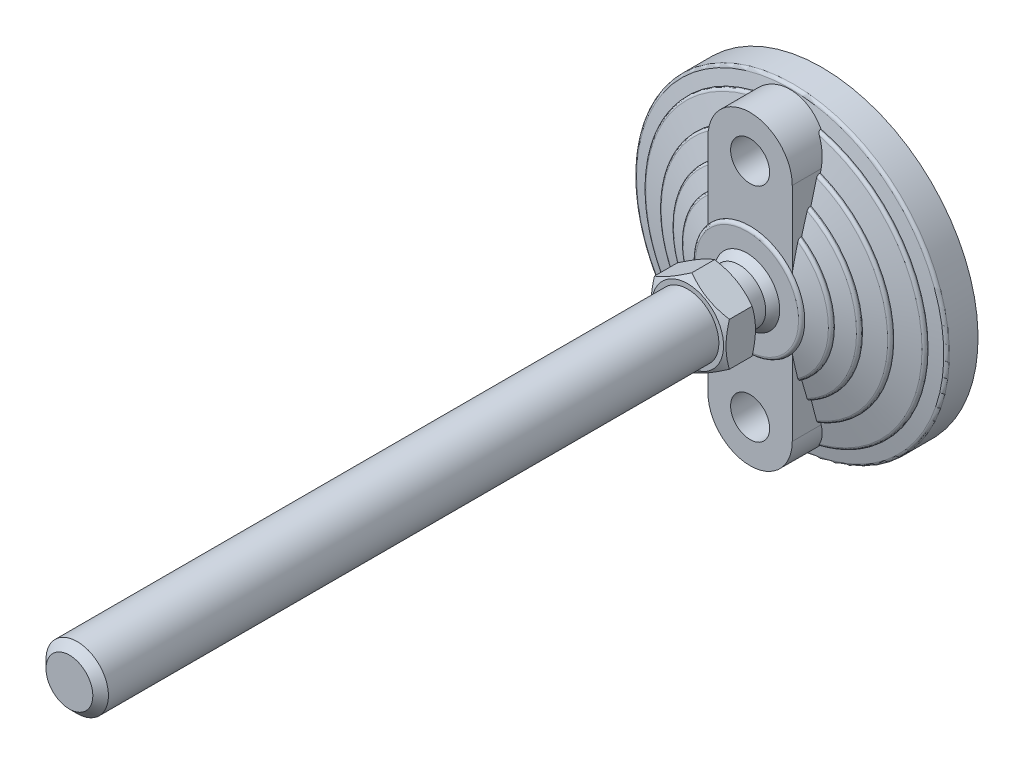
ISO-10303-21;
HEADER;
FILE_DESCRIPTION(('STEP AP214'),'2;1');
FILE_NAME('part.step','',(''),(''),'','','');
FILE_SCHEMA(('AUTOMOTIVE_DESIGN { 1 0 10303 214 1 1 1 1 }'));
ENDSEC;
DATA;
#1=APPLICATION_CONTEXT('core data for automotive mechanical design processes');
#2=APPLICATION_PROTOCOL_DEFINITION('international standard','automotive_design',2000,#1);
#3=PRODUCT_CONTEXT('',#1,'mechanical');
#4=PRODUCT('Part','Part','',(#3));
#5=PRODUCT_RELATED_PRODUCT_CATEGORY('part','',(#4));
#6=PRODUCT_DEFINITION_FORMATION('','',#4);
#7=PRODUCT_DEFINITION_CONTEXT('part definition',#1,'design');
#8=PRODUCT_DEFINITION('design','',#6,#7);
#9=PRODUCT_DEFINITION_SHAPE('','',#8);
#10=(LENGTH_UNIT() NAMED_UNIT(*) SI_UNIT(.MILLI.,.METRE.));
#11=(NAMED_UNIT(*) PLANE_ANGLE_UNIT() SI_UNIT($,.RADIAN.));
#12=(NAMED_UNIT(*) SI_UNIT($,.STERADIAN.) SOLID_ANGLE_UNIT());
#13=UNCERTAINTY_MEASURE_WITH_UNIT(LENGTH_MEASURE(1.E-05),#10,'distance_accuracy_value','');
#14=(GEOMETRIC_REPRESENTATION_CONTEXT(3) GLOBAL_UNCERTAINTY_ASSIGNED_CONTEXT((#13)) GLOBAL_UNIT_ASSIGNED_CONTEXT((#10,
#11,#12)) REPRESENTATION_CONTEXT('',''));
#15=CARTESIAN_POINT('',(0.,0.,0.));
#16=DIRECTION('',(0.,0.,1.));
#17=DIRECTION('',(1.,0.,0.));
#18=AXIS2_PLACEMENT_3D('',#15,#16,#17);
#19=CARTESIAN_POINT('',(-12.,14.022683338,33.));
#20=DIRECTION('',(0.,0.,1.));
#21=DIRECTION('',(0.,-1.,0.));
#22=AXIS2_PLACEMENT_3D('',#19,#20,#21);
#23=PLANE('',#22);
#24=CARTESIAN_POINT('',(0.,0.,33.));
#25=DIRECTION('',(0.,0.,-1.));
#26=DIRECTION('',(0.,1.,0.));
#27=AXIS2_PLACEMENT_3D('',#24,#25,#26);
#28=CIRCLE('',#27,11.5);
#29=CARTESIAN_POINT('',(0.,11.5,33.));
#30=VERTEX_POINT('',#29);
#31=EDGE_CURVE('E260',#30,#30,#28,.T.);
#32=ORIENTED_EDGE('',*,*,#31,.T.);
#33=EDGE_LOOP('',(#32));
#34=FACE_BOUND('',#33,.T.);
#35=CARTESIAN_POINT('',(0.,0.,33.));
#36=DIRECTION('',(0.,0.,-1.));
#37=DIRECTION('',(0.,1.,0.));
#38=AXIS2_PLACEMENT_3D('',#35,#36,#37);
#39=CIRCLE('',#38,8.5);
#40=CARTESIAN_POINT('',(0.,8.5,33.));
#41=VERTEX_POINT('',#40);
#42=EDGE_CURVE('E274',#41,#41,#39,.T.);
#43=ORIENTED_EDGE('',*,*,#42,.F.);
#44=EDGE_LOOP('',(#43));
#45=FACE_BOUND('',#44,.T.);
#46=ADVANCED_FACE('F14',(#34,#45),#23,.F.);
#47=CARTESIAN_POINT('',(0.,0.,33.));
#48=DIRECTION('',(0.,0.,-1.));
#49=DIRECTION('',(0.,1.,0.));
#50=AXIS2_PLACEMENT_3D('',#47,#48,#49);
#51=CYLINDRICAL_SURFACE('',#50,8.5);
#52=CARTESIAN_POINT('',(0.,0.,26.5));
#53=DIRECTION('',(0.,0.,-1.));
#54=DIRECTION('',(0.,1.,0.));
#55=AXIS2_PLACEMENT_3D('',#52,#53,#54);
#56=CIRCLE('',#55,8.5);
#57=CARTESIAN_POINT('',(0.,8.5,26.5));
#58=VERTEX_POINT('',#57);
#59=EDGE_CURVE('E1477',#58,#58,#56,.F.);
#60=ORIENTED_EDGE('',*,*,#59,.T.);
#61=EDGE_LOOP('',(#60));
#62=FACE_BOUND('',#61,.T.);
#63=ORIENTED_EDGE('',*,*,#42,.T.);
#64=EDGE_LOOP('',(#63));
#65=FACE_BOUND('',#64,.T.);
#66=ADVANCED_FACE('F1111',(#62,#65),#51,.T.);
#67=CARTESIAN_POINT('',(-8.63159921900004,8.622532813,26.5));
#68=DIRECTION('',(0.,0.,1.));
#69=DIRECTION('',(0.,-1.,0.));
#70=AXIS2_PLACEMENT_3D('',#67,#68,#69);
#71=PLANE('',#70);
#72=CARTESIAN_POINT('',(0.,0.,26.5));
#73=DIRECTION('',(0.,0.,-1.));
#74=DIRECTION('',(0.,1.,0.));
#75=AXIS2_PLACEMENT_3D('',#72,#73,#74);
#76=CIRCLE('',#75,8.49107182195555);
#77=CARTESIAN_POINT('',(0.,8.49107182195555,26.5));
#78=VERTEX_POINT('',#77);
#79=EDGE_CURVE('E1473',#78,#78,#76,.T.);
#80=ORIENTED_EDGE('',*,*,#79,.F.);
#81=EDGE_LOOP('',(#80));
#82=FACE_BOUND('',#81,.T.);
#83=ORIENTED_EDGE('',*,*,#59,.F.);
#84=EDGE_LOOP('',(#83));
#85=FACE_BOUND('',#84,.T.);
#86=ADVANCED_FACE('F1101',(#82,#85),#71,.F.);
#87=CARTESIAN_POINT('',(0.,0.,17.670266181));
#88=DIRECTION('',(0.,0.,-1.));
#89=DIRECTION('',(1.,0.,0.));
#90=AXIS2_PLACEMENT_3D('',#87,#88,#89);
#91=SPHERICAL_SURFACE('',#90,12.25);
#92=CARTESIAN_POINT('',(0.,0.,24.));
#93=DIRECTION('',(0.,0.,-1.));
#94=DIRECTION('',(0.,1.,0.));
#95=AXIS2_PLACEMENT_3D('',#92,#93,#94);
#96=CIRCLE('',#95,10.4879440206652);
#97=CARTESIAN_POINT('',(0.,10.4879440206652,24.));
#98=VERTEX_POINT('',#97);
#99=EDGE_CURVE('E1470',#98,#98,#96,.F.);
#100=ORIENTED_EDGE('',*,*,#99,.T.);
#101=EDGE_LOOP('',(#100));
#102=FACE_BOUND('',#101,.T.);
#103=ORIENTED_EDGE('',*,*,#79,.T.);
#104=EDGE_LOOP('',(#103));
#105=FACE_BOUND('',#104,.T.);
#106=ADVANCED_FACE('F1091',(#102,#105),#91,.T.);
#107=CARTESIAN_POINT('',(-50.774113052,50.6,0.));
#108=DIRECTION('',(0.,0.,1.));
#109=DIRECTION('',(0.,-1.,0.));
#110=AXIS2_PLACEMENT_3D('',#107,#108,#109);
#111=PLANE('',#110);
#112=CARTESIAN_POINT('',(0.,0.,0.));
#113=DIRECTION('',(0.,0.,-1.));
#114=DIRECTION('',(0.,1.,0.));
#115=AXIS2_PLACEMENT_3D('',#112,#113,#114);
#116=CIRCLE('',#115,50.);
#117=CARTESIAN_POINT('',(0.,50.,0.));
#118=VERTEX_POINT('',#117);
#119=EDGE_CURVE('E553',#118,#118,#116,.F.);
#120=ORIENTED_EDGE('',*,*,#119,.F.);
#121=EDGE_LOOP('',(#120));
#122=FACE_BOUND('',#121,.T.);
#123=CARTESIAN_POINT('',(0.,-35.5,0.));
#124=DIRECTION('',(0.,0.,1.));
#125=DIRECTION('',(0.,-1.,0.));
#126=AXIS2_PLACEMENT_3D('',#123,#124,#125);
#127=CIRCLE('',#126,6.25);
#128=CARTESIAN_POINT('',(0.,-41.75,0.));
#129=VERTEX_POINT('',#128);
#130=EDGE_CURVE('E1273',#129,#129,#127,.T.);
#131=ORIENTED_EDGE('',*,*,#130,.T.);
#132=EDGE_LOOP('',(#131));
#133=FACE_BOUND('',#132,.T.);
#134=CARTESIAN_POINT('',(0.,35.5,0.));
#135=DIRECTION('',(0.,0.,1.));
#136=DIRECTION('',(0.,-1.,0.));
#137=AXIS2_PLACEMENT_3D('',#134,#135,#136);
#138=CIRCLE('',#137,6.25);
#139=CARTESIAN_POINT('',(0.,29.25,0.));
#140=VERTEX_POINT('',#139);
#141=EDGE_CURVE('E1270',#140,#140,#138,.T.);
#142=ORIENTED_EDGE('',*,*,#141,.T.);
#143=EDGE_LOOP('',(#142));
#144=FACE_BOUND('',#143,.T.);
#145=ADVANCED_FACE('F1081',(#122,#133,#144),#111,.F.);
#146=CARTESIAN_POINT('',(0.,-35.5,0.));
#147=DIRECTION('',(0.,0.,1.));
#148=DIRECTION('',(0.,-1.,0.));
#149=AXIS2_PLACEMENT_3D('',#146,#147,#148);
#150=CYLINDRICAL_SURFACE('',#149,6.25);
#151=CARTESIAN_POINT('',(0.,-35.5,23.));
#152=DIRECTION('',(0.,0.,1.));
#153=DIRECTION('',(0.,-1.,0.));
#154=AXIS2_PLACEMENT_3D('',#151,#152,#153);
#155=CIRCLE('',#154,6.25);
#156=CARTESIAN_POINT('',(0.,-41.75,23.));
#157=VERTEX_POINT('',#156);
#158=EDGE_CURVE('E1278',#157,#157,#155,.F.);
#159=ORIENTED_EDGE('',*,*,#158,.F.);
#160=EDGE_LOOP('',(#159));
#161=FACE_BOUND('',#160,.T.);
#162=ORIENTED_EDGE('',*,*,#130,.F.);
#163=EDGE_LOOP('',(#162));
#164=FACE_BOUND('',#163,.T.);
#165=ADVANCED_FACE('F1071',(#161,#164),#150,.F.);
#166=CARTESIAN_POINT('',(-16.755457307,-16.698,24.));
#167=DIRECTION('',(0.,0.,-1.));
#168=DIRECTION('',(0.,1.,0.));
#169=AXIS2_PLACEMENT_3D('',#166,#167,#168);
#170=PLANE('',#169);
#171=ORIENTED_EDGE('',*,*,#99,.F.);
#172=EDGE_LOOP('',(#171));
#173=FACE_BOUND('',#172,.T.);
#174=CARTESIAN_POINT('',(0.,0.,24.));
#175=DIRECTION('',(0.,0.,-1.));
#176=DIRECTION('',(0.,1.,0.));
#177=AXIS2_PLACEMENT_3D('',#174,#175,#176);
#178=CIRCLE('',#177,16.5);
#179=CARTESIAN_POINT('',(0.,16.5,24.));
#180=VERTEX_POINT('',#179);
#181=EDGE_CURVE('E1276',#180,#180,#178,.T.);
#182=ORIENTED_EDGE('',*,*,#181,.F.);
#183=EDGE_LOOP('',(#182));
#184=FACE_BOUND('',#183,.T.);
#185=ADVANCED_FACE('F1061',(#173,#184),#170,.F.);
#186=CARTESIAN_POINT('',(0.,0.,23.));
#187=DIRECTION('',(0.,0.,-1.));
#188=DIRECTION('',(1.,0.,0.));
#189=AXIS2_PLACEMENT_3D('',#186,#187,#188);
#190=CONICAL_SURFACE('',#189,17.5,1.27229739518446);
#191=CARTESIAN_POINT('',(0.,0.,23.));
#192=DIRECTION('',(0.,0.,1.));
#193=DIRECTION('',(0.,-1.,0.));
#194=AXIS2_PLACEMENT_3D('',#191,#192,#193);
#195=CIRCLE('',#194,17.5);
#196=CARTESIAN_POINT('',(13.5000000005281,-11.1355287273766,22.9999999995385));
#197=VERTEX_POINT('',#196);
#198=CARTESIAN_POINT('',(13.5000000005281,11.1355287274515,22.9999999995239));
#199=VERTEX_POINT('',#198);
#200=EDGE_CURVE('E531',#197,#199,#195,.T.);
#201=ORIENTED_EDGE('',*,*,#200,.F.);
#202=CARTESIAN_POINT('',(13.5,-18.9832672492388,21.2172043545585));
#203=CARTESIAN_POINT('',(13.5,-18.6579649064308,21.2987714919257));
#204=CARTESIAN_POINT('',(13.5,-18.3324976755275,21.3796813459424));
#205=CARTESIAN_POINT('',(13.5,-17.681197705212,21.5400241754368));
#206=CARTESIAN_POINT('',(13.5,-17.3553649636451,21.6194571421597));
#207=CARTESIAN_POINT('',(13.5,-16.3773825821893,21.8552688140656));
#208=CARTESIAN_POINT('',(13.5,-15.7246371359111,22.0091884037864));
#209=CARTESIAN_POINT('',(13.5,-14.4172126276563,22.3088363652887));
#210=CARTESIAN_POINT('',(13.5,-13.7625334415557,22.454564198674));
#211=CARTESIAN_POINT('',(13.5,-12.7787974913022,22.6654071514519));
#212=CARTESIAN_POINT('',(13.5,-12.4505717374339,22.7344021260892));
#213=CARTESIAN_POINT('',(13.5,-11.793514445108,22.8694734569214));
#214=CARTESIAN_POINT('',(13.5,-11.4646828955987,22.9355497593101));
#215=CARTESIAN_POINT('',(13.5,-11.1355287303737,22.9999999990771));
#216=B_SPLINE_CURVE_WITH_KNOTS('',3,(#202,#203,#204,#205,#206,#207,#208,#209,#210,#211,#212,
#213,#214,#215),.UNSPECIFIED.,.F.,.F.,(4,2,2,2,2,2,4),(0.,1.00611699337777,2.01223994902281,
4.02414047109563,6.03617306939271,7.04235800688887,8.04856148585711),.UNSPECIFIED.);
#217=CARTESIAN_POINT('',(13.5,-18.9832672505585,21.2172043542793));
#218=VERTEX_POINT('',#217);
#219=EDGE_CURVE('E1180',#218,#197,#216,.T.);
#220=ORIENTED_EDGE('',*,*,#219,.F.);
#221=CARTESIAN_POINT('',(3.16408403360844E-10,0.,21.217204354));
#222=DIRECTION('',(0.,0.,-1.));
#223=DIRECTION('',(1.,0.,0.));
#224=AXIS2_PLACEMENT_3D('',#221,#222,#223);
#225=CIRCLE('',#224,23.2940858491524);
#226=CARTESIAN_POINT('',(13.5,18.9832672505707,21.2172043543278));
#227=VERTEX_POINT('',#226);
#228=EDGE_CURVE('E564',#227,#218,#225,.T.);
#229=ORIENTED_EDGE('',*,*,#228,.F.);
#230=CARTESIAN_POINT('',(13.5,11.1355287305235,22.9999999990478));
#231=CARTESIAN_POINT('',(13.5,11.4646828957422,22.9355497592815));
#232=CARTESIAN_POINT('',(13.5,11.7935144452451,22.8694734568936));
#233=CARTESIAN_POINT('',(13.5,12.4505717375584,22.7344021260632));
#234=CARTESIAN_POINT('',(13.5,12.7787974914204,22.6654071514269));
#235=CARTESIAN_POINT('',(13.5,13.7625334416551,22.4545641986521));
#236=CARTESIAN_POINT('',(13.5,14.4172126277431,22.3088363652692));
#237=CARTESIAN_POINT('',(13.5,15.724637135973,22.0091884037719));
#238=CARTESIAN_POINT('',(13.5,16.3773825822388,21.8552688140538));
#239=CARTESIAN_POINT('',(13.5,17.355364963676,21.6194571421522));
#240=CARTESIAN_POINT('',(13.5,17.6811977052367,21.5400241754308));
#241=CARTESIAN_POINT('',(13.5,18.3324976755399,21.3796813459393));
#242=CARTESIAN_POINT('',(13.5,18.657964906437,21.2987714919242));
#243=CARTESIAN_POINT('',(13.5,18.9832672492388,21.2172043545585));
#244=B_SPLINE_CURVE_WITH_KNOTS('',3,(#230,#231,#232,#233,#234,#235,#236,#237,#238,#239,#240,
#241,#242,#243),.UNSPECIFIED.,.F.,.F.,(4,2,2,2,2,2,4),(0.,1.00620347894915,2.01238841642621,
4.02442101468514,6.03632153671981,7.04244449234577,8.04856148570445),.UNSPECIFIED.);
#245=EDGE_CURVE('E534',#199,#227,#244,.T.);
#246=ORIENTED_EDGE('',*,*,#245,.F.);
#247=EDGE_LOOP('',(#201,#220,#229,#246));
#248=FACE_BOUND('',#247,.T.);
#249=ADVANCED_FACE('F1051',(#248),#190,.T.);
#250=CARTESIAN_POINT('',(13.267303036,19.999466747,20.261425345));
#251=CARTESIAN_POINT('',(29.097194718,9.498188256,20.2614253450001));
#252=CARTESIAN_POINT('',(29.097194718,-9.498188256,20.2614253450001));
#253=CARTESIAN_POINT('',(13.267303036,-19.999466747,20.261425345));
#254=CARTESIAN_POINT('',(13.2673030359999,19.999466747,20.716888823));
#255=CARTESIAN_POINT('',(29.097194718,9.49818825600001,20.716888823));
#256=CARTESIAN_POINT('',(29.097194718,-9.49818825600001,20.716888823));
#257=CARTESIAN_POINT('',(13.2673030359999,-19.999466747,20.716888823));
#258=CARTESIAN_POINT('',(13.117718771,19.773979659,21.083258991));
#259=CARTESIAN_POINT('',(28.769133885,9.39109946,21.0832589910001));
#260=CARTESIAN_POINT('',(28.769133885,-9.39109946,21.0832589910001));
#261=CARTESIAN_POINT('',(13.117718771,-19.773979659,21.083258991));
#262=CARTESIAN_POINT('',(12.877070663,19.411220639,21.217204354));
#263=CARTESIAN_POINT('',(28.241356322,9.218817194,21.2172043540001));
#264=CARTESIAN_POINT('',(28.241356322,-9.218817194,21.2172043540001));
#265=CARTESIAN_POINT('',(12.877070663,-19.411220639,21.217204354));
#266=(BOUNDED_SURFACE() B_SPLINE_SURFACE(3,3,((#250,#251,#252,#253),(#254,#255,#256,#257),(#258,
#259,#260,#261),(#262,#263,#264,#265)),.UNSPECIFIED.,.F.,.F.,
.F.) B_SPLINE_SURFACE_WITH_KNOTS((4,4),(4,4),(0.,1.),(0.,1.),
.UNSPECIFIED.) GEOMETRIC_REPRESENTATION_ITEM() RATIONAL_B_SPLINE_SURFACE(((1.,0.7018695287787,
0.7018695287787,1.),(0.869593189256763,0.610340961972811,0.610340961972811,0.869593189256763),
(0.869593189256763,0.610340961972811,0.610340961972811,0.869593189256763),(1.,0.7018695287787,
0.7018695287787,1.))) REPRESENTATION_ITEM('') SURFACE());
#267=CARTESIAN_POINT('',(13.5,-19.8431348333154,20.2614253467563));
#268=CARTESIAN_POINT('',(13.5,-19.8431370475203,20.286055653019));
#269=CARTESIAN_POINT('',(13.5,-19.8420333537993,20.310672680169));
#270=CARTESIAN_POINT('',(13.5,-19.8376465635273,20.3597018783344));
#271=CARTESIAN_POINT('',(13.5,-19.834364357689,20.3841141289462));
#272=CARTESIAN_POINT('',(13.5,-19.8213486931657,20.4565201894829));
#273=CARTESIAN_POINT('',(13.5,-19.8084453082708,20.503978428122));
#274=CARTESIAN_POINT('',(13.5,-19.7748969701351,20.5959548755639));
#275=CARTESIAN_POINT('',(13.5,-19.7542611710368,20.6404764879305));
#276=CARTESIAN_POINT('',(13.5,-19.7062220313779,20.7257350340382));
#277=CARTESIAN_POINT('',(13.5,-19.678812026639,20.7664681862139));
#278=CARTESIAN_POINT('',(13.5,-19.6164784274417,20.8458096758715));
#279=CARTESIAN_POINT('',(13.5,-19.5811980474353,20.8841360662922));
#280=CARTESIAN_POINT('',(13.5,-19.5055204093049,20.9553392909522));
#281=CARTESIAN_POINT('',(13.5,-19.4651202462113,20.9882130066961));
#282=CARTESIAN_POINT('',(13.5,-19.3733614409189,21.0532792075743));
#283=CARTESIAN_POINT('',(13.5,-19.3212935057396,21.084469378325));
#284=CARTESIAN_POINT('',(13.5,-19.2133323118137,21.1391750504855));
#285=CARTESIAN_POINT('',(13.5,-19.1574401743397,21.1626927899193));
#286=CARTESIAN_POINT('',(13.5,-19.06178190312,21.1957297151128));
#287=CARTESIAN_POINT('',(13.5,-19.0227191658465,21.207311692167));
#288=CARTESIAN_POINT('',(13.5,-18.9832672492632,21.2172043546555));
#289=B_SPLINE_CURVE_WITH_KNOTS('',3,(#267,#268,#269,#270,#271,#272,#273,#274,#275,#276,#277,
#278,#279,#280,#281,#282,#283,#284,#285,#286,#287,#288),.UNSPECIFIED.,.F.,.F.,(4,2,2,2,2,2,2,2,
2,2,4),(0.,0.0738405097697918,0.147650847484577,0.294398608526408,0.440973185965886,
0.587692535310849,0.74337758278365,0.899151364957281,1.08055915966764,1.26191399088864,
1.38396482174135),.UNSPECIFIED.);
#290=CARTESIAN_POINT('',(13.5,-19.8431348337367,20.2614253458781));
#291=VERTEX_POINT('',#290);
#292=EDGE_CURVE('E1146',#291,#218,#289,.T.);
#293=CARTESIAN_POINT('',(0.,0.,20.261425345));
#294=DIRECTION('',(0.,0.,-1.));
#295=DIRECTION('',(0.,1.,0.));
#296=AXIS2_PLACEMENT_3D('',#293,#294,#295);
#297=CIRCLE('',#296,24.);
#298=CARTESIAN_POINT('',(13.5,19.8431348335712,20.2614253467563));
#299=VERTEX_POINT('',#298);
#300=EDGE_CURVE('E562',#299,#291,#297,.T.);
#301=CARTESIAN_POINT('',(13.5,18.9832672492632,21.2172043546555));
#302=CARTESIAN_POINT('',(13.5,19.0245269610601,21.2068474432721));
#303=CARTESIAN_POINT('',(13.5,19.0653049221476,21.1946763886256));
#304=CARTESIAN_POINT('',(13.5,19.1456358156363,21.1665827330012));
#305=CARTESIAN_POINT('',(13.5,19.1851861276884,21.1506526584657));
#306=CARTESIAN_POINT('',(13.5,19.3016874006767,21.0969581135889));
#307=CARTESIAN_POINT('',(13.5,19.3761277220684,21.0533765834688));
#308=CARTESIAN_POINT('',(13.5,19.4913457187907,20.9675664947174));
#309=CARTESIAN_POINT('',(13.5,19.5352290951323,20.9294496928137));
#310=CARTESIAN_POINT('',(13.5,19.6161219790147,20.8466003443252));
#311=CARTESIAN_POINT('',(13.5,19.6531483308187,20.8018845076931));
#312=CARTESIAN_POINT('',(13.5,19.7189344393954,20.7060840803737));
#313=CARTESIAN_POINT('',(13.5,19.7476154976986,20.6549449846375));
#314=CARTESIAN_POINT('',(13.5,19.7944064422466,20.5480322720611));
#315=CARTESIAN_POINT('',(13.5,19.812533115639,20.4922661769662));
#316=CARTESIAN_POINT('',(13.5,19.8308153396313,20.4067306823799));
#317=CARTESIAN_POINT('',(13.5,19.8354249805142,20.3778585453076));
#318=CARTESIAN_POINT('',(13.5,19.8415861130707,20.3198066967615));
#319=CARTESIAN_POINT('',(13.5,19.8431393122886,20.2906271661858));
#320=CARTESIAN_POINT('',(13.5,19.8431348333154,20.2614253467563));
#321=B_SPLINE_CURVE_WITH_KNOTS('',3,(#301,#302,#303,#304,#305,#306,#307,#308,#309,#310,#311,
#312,#313,#314,#315,#316,#317,#318,#319,#320),.UNSPECIFIED.,.F.,.F.,(4,2,2,2,2,2,2,2,2,4),(0.,
0.12751650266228,0.255288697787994,0.511930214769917,0.685657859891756,0.858952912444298,
1.03383282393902,1.20843381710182,1.29600438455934,1.38352601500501),.UNSPECIFIED.);
#322=EDGE_CURVE('E1219',#227,#299,#321,.T.);
#323=ORIENTED_EDGE('',*,*,#228,.T.);
#324=ORIENTED_EDGE('',*,*,#292,.F.);
#325=ORIENTED_EDGE('',*,*,#300,.F.);
#326=ORIENTED_EDGE('',*,*,#322,.F.);
#327=EDGE_LOOP('',(#323,#324,#325,#326));
#328=FACE_BOUND('',#327,.T.);
#329=ADVANCED_FACE('F1041',(#328),#266,.T.);
#330=CARTESIAN_POINT('',(0.,0.,20.261425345));
#331=DIRECTION('',(0.,0.,-1.));
#332=DIRECTION('',(0.,1.,0.));
#333=AXIS2_PLACEMENT_3D('',#330,#331,#332);
#334=CYLINDRICAL_SURFACE('',#333,24.);
#335=CARTESIAN_POINT('',(0.,0.,20.));
#336=DIRECTION('',(0.,0.,-1.));
#337=DIRECTION('',(0.,1.,0.));
#338=AXIS2_PLACEMENT_3D('',#335,#336,#337);
#339=CIRCLE('',#338,24.);
#340=CARTESIAN_POINT('',(13.5,19.8431348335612,20.0000000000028));
#341=VERTEX_POINT('',#340);
#342=CARTESIAN_POINT('',(13.5,-19.8431348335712,19.9999999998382));
#343=VERTEX_POINT('',#342);
#344=EDGE_CURVE('E560',#341,#343,#339,.T.);
#345=ORIENTED_EDGE('',*,*,#344,.F.);
#346=DIRECTION('',(0.,0.,-1.));
#347=VECTOR('',#346,1.);
#348=CARTESIAN_POINT('',(13.5,19.8431348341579,18.349732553));
#349=LINE('',#348,#347);
#350=EDGE_CURVE('E1241',#299,#341,#349,.T.);
#351=ORIENTED_EDGE('',*,*,#350,.F.);
#352=ORIENTED_EDGE('',*,*,#300,.T.);
#353=DIRECTION('',(0.,0.,1.));
#354=VECTOR('',#353,1.);
#355=CARTESIAN_POINT('',(13.5,-19.8431348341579,18.349732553));
#356=LINE('',#355,#354);
#357=EDGE_CURVE('E1288',#343,#291,#356,.T.);
#358=ORIENTED_EDGE('',*,*,#357,.F.);
#359=EDGE_LOOP('',(#345,#351,#352,#358));
#360=FACE_BOUND('',#359,.T.);
#361=ADVANCED_FACE('F1031',(#360),#334,.T.);
#362=CARTESIAN_POINT('',(0.,0.,20.));
#363=DIRECTION('',(0.,0.,-1.));
#364=DIRECTION('',(0.,1.,0.));
#365=AXIS2_PLACEMENT_3D('',#362,#363,#364);
#366=CONICAL_SURFACE('',#365,24.,1.24904577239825);
#367=ORIENTED_EDGE('',*,*,#344,.T.);
#368=CARTESIAN_POINT('',(13.4999999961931,-26.0228978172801,18.2279240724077));
#369=CARTESIAN_POINT('',(13.4999999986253,-25.5091656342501,18.379921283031));
#370=CARTESIAN_POINT('',(13.4999999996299,-24.9951778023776,18.531058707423));
#371=CARTESIAN_POINT('',(13.5000000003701,-23.9666187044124,18.8312926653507));
#372=CARTESIAN_POINT('',(13.5000000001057,-23.4520474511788,18.9803892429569));
#373=CARTESIAN_POINT('',(13.4999999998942,-22.4222240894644,19.2762276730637));
#374=CARTESIAN_POINT('',(13.4999999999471,-21.9069719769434,19.4229695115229));
#375=CARTESIAN_POINT('',(13.5000000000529,-20.8756730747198,19.7136753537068));
#376=CARTESIAN_POINT('',(13.5000000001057,-20.3596262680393,19.8576392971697));
#377=CARTESIAN_POINT('',(13.5,-19.8431348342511,19.9999999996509));
#378=B_SPLINE_CURVE_WITH_KNOTS('',3,(#368,#369,#370,#371,#372,#373,#374,#375,#376,#377),
.UNSPECIFIED.,.F.,.F.,(4,2,2,2,4),(0.,1.60723934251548,3.21444392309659,4.82165808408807,
6.4289070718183),.UNSPECIFIED.);
#379=CARTESIAN_POINT('',(13.5,-26.0228978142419,18.2279240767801));
#380=VERTEX_POINT('',#379);
#381=EDGE_CURVE('E1154',#380,#343,#378,.T.);
#382=ORIENTED_EDGE('',*,*,#381,.F.);
#383=CARTESIAN_POINT('',(-5.51367254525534E-10,0.,18.227924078));
#384=DIRECTION('',(0.,0.,-1.));
#385=DIRECTION('',(0.,1.,0.));
#386=AXIS2_PLACEMENT_3D('',#383,#384,#385);
#387=CIRCLE('',#386,29.3162277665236);
#388=CARTESIAN_POINT('',(13.5,26.0228978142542,18.2279240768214));
#389=VERTEX_POINT('',#388);
#390=EDGE_CURVE('E559',#389,#380,#387,.T.);
#391=ORIENTED_EDGE('',*,*,#390,.F.);
#392=CARTESIAN_POINT('',(13.5000000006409,19.8431348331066,20.0000000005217));
#393=CARTESIAN_POINT('',(13.5000000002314,20.3596262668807,19.8576392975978));
#394=CARTESIAN_POINT('',(13.5000000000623,20.8756730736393,19.7136753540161));
#395=CARTESIAN_POINT('',(13.4999999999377,21.9069719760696,19.4229695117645));
#396=CARTESIAN_POINT('',(13.4999999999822,22.4222240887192,19.2762276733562));
#397=CARTESIAN_POINT('',(13.5000000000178,23.4520474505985,18.9803892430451));
#398=CARTESIAN_POINT('',(13.5000000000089,23.9666187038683,18.8312926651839));
#399=CARTESIAN_POINT('',(13.4999999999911,24.9951778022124,18.5310587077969));
#400=CARTESIAN_POINT('',(13.4999999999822,25.5091656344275,18.3799212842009));
#401=CARTESIAN_POINT('',(13.5,26.0228978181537,18.2279240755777));
#402=B_SPLINE_CURVE_WITH_KNOTS('',3,(#392,#393,#394,#395,#396,#397,#398,#399,#400,#401),
.UNSPECIFIED.,.F.,.F.,(4,2,2,2,4),(0.,1.60724898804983,3.21446314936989,4.82166773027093,
6.42890707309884),.UNSPECIFIED.);
#403=EDGE_CURVE('E1235',#341,#389,#402,.T.);
#404=ORIENTED_EDGE('',*,*,#403,.F.);
#405=EDGE_LOOP('',(#367,#382,#391,#404));
#406=FACE_BOUND('',#405,.T.);
#407=ADVANCED_FACE('F1021',(#406),#366,.T.);
#408=CARTESIAN_POINT('',(13.143890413,26.967353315,17.27924078));
#409=CARTESIAN_POINT('',(38.983891,14.372934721,17.27924078));
#410=CARTESIAN_POINT('',(38.983891,-14.372934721,17.27924078));
#411=CARTESIAN_POINT('',(13.143890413,-26.967353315,17.27924078));
#412=CARTESIAN_POINT('',(13.143890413,26.967353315,17.725161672));
#413=CARTESIAN_POINT('',(38.983891,14.372934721,17.725161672));
#414=CARTESIAN_POINT('',(38.983891,-14.372934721,17.725161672));
#415=CARTESIAN_POINT('',(13.143890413,-26.967353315,17.725161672));
#416=CARTESIAN_POINT('',(13.029654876,26.732975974,18.086911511));
#417=CARTESIAN_POINT('',(38.645076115,14.248017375,18.086911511));
#418=CARTESIAN_POINT('',(38.645076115,-14.248017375,18.086911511));
#419=CARTESIAN_POINT('',(13.029654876,-26.732975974,18.086911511));
#420=CARTESIAN_POINT('',(12.844309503,26.352702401,18.227924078));
#421=CARTESIAN_POINT('',(38.095354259,14.045340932,18.2279240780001));
#422=CARTESIAN_POINT('',(38.095354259,-14.045340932,18.2279240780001));
#423=CARTESIAN_POINT('',(12.844309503,-26.352702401,18.227924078));
#424=(BOUNDED_SURFACE() B_SPLINE_SURFACE(3,3,((#408,#409,#410,#411),(#412,#413,#414,#415),(#416,
#417,#418,#419),(#420,#421,#422,#423)),.UNSPECIFIED.,.F.,.F.,
.F.) B_SPLINE_SURFACE_WITH_KNOTS((4,4),(4,4),(0.,1.),(0.,1.),
.UNSPECIFIED.) GEOMETRIC_REPRESENTATION_ITEM() RATIONAL_B_SPLINE_SURFACE(((1.,0.625419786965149,
0.625419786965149,1.),(0.87416145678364,0.546717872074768,0.546717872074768,0.87416145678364),
(0.87416145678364,0.546717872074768,0.546717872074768,0.87416145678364),(1.,0.625419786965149,
0.625419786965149,1.))) REPRESENTATION_ITEM('') SURFACE());
#425=CARTESIAN_POINT('',(13.5,-26.7908566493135,17.2792407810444));
#426=CARTESIAN_POINT('',(13.5,-26.7908579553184,17.3051907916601));
#427=CARTESIAN_POINT('',(13.5,-26.7897247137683,17.3311275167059));
#428=CARTESIAN_POINT('',(13.5,-26.7852140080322,17.3827974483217));
#429=CARTESIAN_POINT('',(13.5,-26.7818372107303,17.4085307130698));
#430=CARTESIAN_POINT('',(13.5,-26.7684139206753,17.4849772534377));
#431=CARTESIAN_POINT('',(13.5,-26.7550740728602,17.5351491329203));
#432=CARTESIAN_POINT('',(13.5,-26.720210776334,17.6324862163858));
#433=CARTESIAN_POINT('',(13.5,-26.6986916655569,17.6796529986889));
#434=CARTESIAN_POINT('',(13.5,-26.6483480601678,17.7699105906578));
#435=CARTESIAN_POINT('',(13.5,-26.6195218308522,17.8130004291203));
#436=CARTESIAN_POINT('',(13.5,-26.554284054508,17.8959059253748));
#437=CARTESIAN_POINT('',(13.5,-26.5176080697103,17.9355124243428));
#438=CARTESIAN_POINT('',(13.5,-26.4386436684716,18.008723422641));
#439=CARTESIAN_POINT('',(13.5,-26.3963509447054,18.0423232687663));
#440=CARTESIAN_POINT('',(13.5,-26.3267001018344,18.0898793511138));
#441=CARTESIAN_POINT('',(13.5,-26.3008113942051,18.1060387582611));
#442=CARTESIAN_POINT('',(13.5,-26.2478537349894,18.1362297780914));
#443=CARTESIAN_POINT('',(13.5,-26.2207861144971,18.1502637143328));
#444=CARTESIAN_POINT('',(13.5,-26.1657188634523,18.1761515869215));
#445=CARTESIAN_POINT('',(13.5,-26.1377218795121,18.1880111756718));
#446=CARTESIAN_POINT('',(13.5,-26.0808891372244,18.2095853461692));
#447=CARTESIAN_POINT('',(13.5,-26.0520527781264,18.2192983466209));
#448=CARTESIAN_POINT('',(13.5,-26.0228978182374,18.2279240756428));
#449=B_SPLINE_CURVE_WITH_KNOTS('',3,(#425,#426,#427,#428,#429,#430,#431,#432,#433,#434,#435,
#436,#437,#438,#439,#440,#441,#442,#443,#444,#445,#446,#447,#448),.UNSPECIFIED.,.F.,.F.,(4,2,2,
2,2,2,2,2,2,2,2,4),(0.,0.0777993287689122,0.155575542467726,0.310500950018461,0.465344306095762,
0.620224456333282,0.781511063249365,0.942922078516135,1.03439248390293,1.12576216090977,
1.21689083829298,1.30808642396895),.UNSPECIFIED.);
#450=CARTESIAN_POINT('',(13.5,-26.7908566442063,17.2792407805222));
#451=VERTEX_POINT('',#450);
#452=EDGE_CURVE('E1161',#451,#380,#449,.T.);
#453=CARTESIAN_POINT('',(0.,0.,17.27924078));
#454=DIRECTION('',(0.,0.,-1.));
#455=DIRECTION('',(0.,1.,0.));
#456=AXIS2_PLACEMENT_3D('',#453,#454,#455);
#457=CIRCLE('',#456,30.);
#458=CARTESIAN_POINT('',(13.5,26.7908566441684,17.2792407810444));
#459=VERTEX_POINT('',#458);
#460=EDGE_CURVE('E557',#459,#451,#457,.T.);
#461=CARTESIAN_POINT('',(13.5,26.0228978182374,18.2279240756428));
#462=CARTESIAN_POINT('',(13.5,26.0845570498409,18.2097134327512));
#463=CARTESIAN_POINT('',(13.5,26.1448460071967,18.1865640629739));
#464=CARTESIAN_POINT('',(13.5,26.2611194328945,18.1305926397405));
#465=CARTESIAN_POINT('',(13.5,26.3170802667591,18.0977216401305));
#466=CARTESIAN_POINT('',(13.5,26.4226214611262,18.0225926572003));
#467=CARTESIAN_POINT('',(13.5,26.4721821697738,17.9803067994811));
#468=CARTESIAN_POINT('',(13.5,26.562515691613,17.8873079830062));
#469=CARTESIAN_POINT('',(13.5,26.6033065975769,17.836612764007));
#470=CARTESIAN_POINT('',(13.5,26.6708532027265,17.7331354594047));
#471=CARTESIAN_POINT('',(13.5,26.6985518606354,17.6809691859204));
#472=CARTESIAN_POINT('',(13.5,26.7436193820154,17.5723560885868));
#473=CARTESIAN_POINT('',(13.5,26.7610021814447,17.5159151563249));
#474=CARTESIAN_POINT('',(13.5,26.7787549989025,17.4289072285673));
#475=CARTESIAN_POINT('',(13.5,26.783287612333,17.3991381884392));
#476=CARTESIAN_POINT('',(13.5,26.7893378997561,17.339332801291));
#477=CARTESIAN_POINT('',(13.5,26.7908592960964,17.3092968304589));
#478=CARTESIAN_POINT('',(13.5,26.7908566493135,17.2792407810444));
#479=B_SPLINE_CURVE_WITH_KNOTS('',3,(#461,#462,#463,#464,#465,#466,#467,#468,#469,#470,#471,
#472,#473,#474,#475,#476,#477,#478),.UNSPECIFIED.,.F.,.F.,(4,2,2,2,2,2,2,2,4),(0.,
0.192810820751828,0.386609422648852,0.580989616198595,0.77496485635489,0.951184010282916,
1.12716456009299,1.21736691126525,1.30745768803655),.UNSPECIFIED.);
#480=EDGE_CURVE('E1230',#389,#459,#479,.T.);
#481=ORIENTED_EDGE('',*,*,#390,.T.);
#482=ORIENTED_EDGE('',*,*,#452,.F.);
#483=ORIENTED_EDGE('',*,*,#460,.F.);
#484=ORIENTED_EDGE('',*,*,#480,.F.);
#485=EDGE_LOOP('',(#481,#482,#483,#484));
#486=FACE_BOUND('',#485,.T.);
#487=ADVANCED_FACE('F1011',(#486),#424,.T.);
#488=CARTESIAN_POINT('',(0.,0.,17.27924078));
#489=DIRECTION('',(0.,0.,-1.));
#490=DIRECTION('',(0.,1.,0.));
#491=AXIS2_PLACEMENT_3D('',#488,#489,#490);
#492=CYLINDRICAL_SURFACE('',#491,30.);
#493=CARTESIAN_POINT('',(0.,0.,17.));
#494=DIRECTION('',(0.,0.,-1.));
#495=DIRECTION('',(0.,1.,0.));
#496=AXIS2_PLACEMENT_3D('',#493,#494,#495);
#497=CIRCLE('',#496,30.);
#498=CARTESIAN_POINT('',(13.5,26.7908566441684,17.));
#499=VERTEX_POINT('',#498);
#500=CARTESIAN_POINT('',(13.5,-26.7908566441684,17.0000000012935));
#501=VERTEX_POINT('',#500);
#502=EDGE_CURVE('E555',#499,#501,#497,.T.);
#503=ORIENTED_EDGE('',*,*,#502,.F.);
#504=DIRECTION('',(0.,0.,-1.));
#505=VECTOR('',#504,1.);
#506=CARTESIAN_POINT('',(13.5,26.7908566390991,18.349732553));
#507=LINE('',#506,#505);
#508=EDGE_CURVE('E1293',#459,#499,#507,.T.);
#509=ORIENTED_EDGE('',*,*,#508,.F.);
#510=ORIENTED_EDGE('',*,*,#460,.T.);
#511=DIRECTION('',(0.,0.,1.));
#512=VECTOR('',#511,1.);
#513=CARTESIAN_POINT('',(13.5,-26.7908566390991,18.349732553));
#514=LINE('',#513,#512);
#515=EDGE_CURVE('E1506',#501,#451,#514,.T.);
#516=ORIENTED_EDGE('',*,*,#515,.F.);
#517=EDGE_LOOP('',(#503,#509,#510,#516));
#518=FACE_BOUND('',#517,.T.);
#519=ADVANCED_FACE('F1001',(#518),#492,.T.);
#520=CARTESIAN_POINT('',(0.,0.,17.));
#521=DIRECTION('',(0.,0.,-1.));
#522=DIRECTION('',(1.,0.,0.));
#523=AXIS2_PLACEMENT_3D('',#520,#521,#522);
#524=CONICAL_SURFACE('',#523,30.,1.29249666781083);
#525=ORIENTED_EDGE('',*,*,#502,.T.);
#526=CARTESIAN_POINT('',(13.5,-33.6690569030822,15.2072225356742));
#527=CARTESIAN_POINT('',(13.5,-33.0965095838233,15.3590521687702));
#528=CARTESIAN_POINT('',(13.5,-32.5238314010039,15.5103895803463));
#529=CARTESIAN_POINT('',(13.5,-31.3781752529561,15.8119124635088));
#530=CARTESIAN_POINT('',(13.5,-30.8051972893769,15.9620979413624));
#531=CARTESIAN_POINT('',(13.5,-29.6588964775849,16.261151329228));
#532=CARTESIAN_POINT('',(13.5,-29.0855736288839,16.4100192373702));
#533=CARTESIAN_POINT('',(13.5,-27.9385277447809,16.7062178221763));
#534=CARTESIAN_POINT('',(13.5,-27.3648047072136,16.8535484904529));
#535=CARTESIAN_POINT('',(13.5,-26.7908566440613,17.0000000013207));
#536=B_SPLINE_CURVE_WITH_KNOTS('',3,(#526,#527,#528,#529,#530,#531,#532,#533,#534,#535),
.UNSPECIFIED.,.F.,.F.,(4,2,2,2,4),(0.,1.77701009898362,3.55401052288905,5.33101346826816,
7.10802610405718),.UNSPECIFIED.);
#537=CARTESIAN_POINT('',(13.5,-33.6690569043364,15.2072225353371));
#538=VERTEX_POINT('',#537);
#539=EDGE_CURVE('E1167',#538,#501,#536,.T.);
#540=ORIENTED_EDGE('',*,*,#539,.F.);
#541=CARTESIAN_POINT('',(3.08412729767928E-10,0.,15.207222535));
#542=DIRECTION('',(0.,0.,-1.));
#543=DIRECTION('',(0.,1.,0.));
#544=AXIS2_PLACEMENT_3D('',#541,#542,#543);
#545=CIRCLE('',#544,36.2747211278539);
#546=CARTESIAN_POINT('',(13.5,33.6690569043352,15.2072225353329));
#547=VERTEX_POINT('',#546);
#548=EDGE_CURVE('E554',#547,#538,#545,.T.);
#549=ORIENTED_EDGE('',*,*,#548,.F.);
#550=CARTESIAN_POINT('',(13.5,26.7908566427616,17.0000000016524));
#551=CARTESIAN_POINT('',(13.5,27.3648047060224,16.8535484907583));
#552=CARTESIAN_POINT('',(13.5,27.9385277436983,16.7062178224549));
#553=CARTESIAN_POINT('',(13.5,29.0855736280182,16.4100192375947));
#554=CARTESIAN_POINT('',(13.5,29.6588964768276,16.2611513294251));
#555=CARTESIAN_POINT('',(13.5,30.8051972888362,15.962097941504));
#556=CARTESIAN_POINT('',(13.5,31.3781752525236,15.8119124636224));
#557=CARTESIAN_POINT('',(13.5,32.5238314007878,15.5103895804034));
#558=CARTESIAN_POINT('',(13.5,33.0965095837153,15.3590521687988));
#559=CARTESIAN_POINT('',(13.5,33.6690569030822,15.2072225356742));
#560=B_SPLINE_CURVE_WITH_KNOTS('',3,(#550,#551,#552,#553,#554,#555,#556,#557,#558,#559),
.UNSPECIFIED.,.F.,.F.,(4,2,2,2,4),(0.,1.77701263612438,3.55401558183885,5.33101600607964,
7.10802610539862),.UNSPECIFIED.);
#561=EDGE_CURVE('E1205',#499,#547,#560,.T.);
#562=ORIENTED_EDGE('',*,*,#561,.F.);
#563=EDGE_LOOP('',(#525,#540,#549,#562));
#564=FACE_BOUND('',#563,.T.);
#565=ADVANCED_FACE('F991',(#564),#524,.T.);
#566=CARTESIAN_POINT('',(13.003667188,34.639639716,14.245698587));
#567=CARTESIAN_POINT('',(51.0914438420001,20.341547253,14.2456985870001));
#568=CARTESIAN_POINT('',(51.0914438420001,-20.341547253,14.2456985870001));
#569=CARTESIAN_POINT('',(13.003667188,-34.639639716,14.245698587));
#570=CARTESIAN_POINT('',(13.003667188,34.639639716,14.709515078));
#571=CARTESIAN_POINT('',(51.091443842,20.341547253,14.7095150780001));
#572=CARTESIAN_POINT('',(51.091443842,-20.341547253,14.7095150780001));
#573=CARTESIAN_POINT('',(13.003667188,-34.639639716,14.709515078));
#574=CARTESIAN_POINT('',(12.905504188,34.378149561,15.079802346));
#575=CARTESIAN_POINT('',(50.7057611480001,20.187991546,15.0798023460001));
#576=CARTESIAN_POINT('',(50.7057611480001,-20.187991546,15.0798023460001));
#577=CARTESIAN_POINT('',(12.905504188,-34.378149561,15.079802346));
#578=CARTESIAN_POINT('',(12.748767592,33.960628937,15.207222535));
#579=CARTESIAN_POINT('',(50.089942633,19.942809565,15.207222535));
#580=CARTESIAN_POINT('',(50.089942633,-19.942809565,15.207222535));
#581=CARTESIAN_POINT('',(12.748767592,-33.960628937,15.207222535));
#582=(BOUNDED_SURFACE() B_SPLINE_SURFACE(3,3,((#566,#567,#568,#569),(#570,#571,#572,#573),(#574,
#575,#576,#577),(#578,#579,#580,#581)),.UNSPECIFIED.,.F.,.F.,
.F.) B_SPLINE_SURFACE_WITH_KNOTS((4,4),(4,4),(0.,1.),(0.,1.),
.UNSPECIFIED.) GEOMETRIC_REPRESENTATION_ITEM() RATIONAL_B_SPLINE_SURFACE(((1.,0.567633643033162,
0.567633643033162,1.),(0.865565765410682,0.491324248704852,0.491324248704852,0.865565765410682),
(0.865565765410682,0.491324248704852,0.491324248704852,0.865565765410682),(1.,0.567633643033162,
0.567633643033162,1.))) REPRESENTATION_ITEM('') SURFACE());
#583=CARTESIAN_POINT('',(13.5,-34.4492380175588,14.2456985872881));
#584=CARTESIAN_POINT('',(13.5,-34.4492388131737,14.2724185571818));
#585=CARTESIAN_POINT('',(13.5,-34.4480869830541,14.2991252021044));
#586=CARTESIAN_POINT('',(13.5,-34.4434985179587,14.3523366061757));
#587=CARTESIAN_POINT('',(13.5,-34.4400623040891,14.378841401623));
#588=CARTESIAN_POINT('',(13.5,-34.4263854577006,14.4576417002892));
#589=CARTESIAN_POINT('',(13.5,-34.4127763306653,14.5093910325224));
#590=CARTESIAN_POINT('',(13.5,-34.3771048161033,14.6098360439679));
#591=CARTESIAN_POINT('',(13.5,-34.3550440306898,14.6585322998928));
#592=CARTESIAN_POINT('',(13.5,-34.3032810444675,14.7516688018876));
#593=CARTESIAN_POINT('',(13.5,-34.2735788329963,14.7961090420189));
#594=CARTESIAN_POINT('',(13.5,-34.2066078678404,14.8808807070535));
#595=CARTESIAN_POINT('',(13.5,-34.1691521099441,14.9210639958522));
#596=CARTESIAN_POINT('',(13.5,-34.0883643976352,14.9950807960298));
#597=CARTESIAN_POINT('',(13.5,-34.0450257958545,15.0289070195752));
#598=CARTESIAN_POINT('',(13.5,-33.9488589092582,15.0927883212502));
#599=CARTESIAN_POINT('',(13.5,-33.8955116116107,15.1220613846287));
#600=CARTESIAN_POINT('',(13.5,-33.7848588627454,15.1715344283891));
#601=CARTESIAN_POINT('',(13.5,-33.7275598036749,15.1917486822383));
#602=CARTESIAN_POINT('',(13.5,-33.66905690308,15.2072225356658));
#603=B_SPLINE_CURVE_WITH_KNOTS('',3,(#583,#584,#585,#586,#587,#588,#589,#590,#591,#592,#593,
#594,#595,#596,#597,#598,#599,#600,#601,#602),.UNSPECIFIED.,.F.,.F.,(4,2,2,2,2,2,2,2,2,4),(0.,
0.0801088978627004,0.16020303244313,0.319894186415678,0.479555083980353,0.639216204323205,
0.803305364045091,0.967581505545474,1.14930395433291,1.33073905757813),.UNSPECIFIED.);
#604=CARTESIAN_POINT('',(13.5,-34.4492380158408,14.245698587));
#605=VERTEX_POINT('',#604);
#606=EDGE_CURVE('E1173',#605,#538,#603,.T.);
#607=CARTESIAN_POINT('',(0.,0.,14.245698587));
#608=DIRECTION('',(0.,0.,-1.));
#609=DIRECTION('',(0.,1.,0.));
#610=AXIS2_PLACEMENT_3D('',#607,#608,#609);
#611=CIRCLE('',#610,37.);
#612=CARTESIAN_POINT('',(13.5,34.4492380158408,14.2456985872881));
#613=VERTEX_POINT('',#612);
#614=EDGE_CURVE('E551',#613,#605,#611,.T.);
#615=CARTESIAN_POINT('',(13.5,33.66905690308,15.2072225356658));
#616=CARTESIAN_POINT('',(13.5,33.7285004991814,15.191498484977));
#617=CARTESIAN_POINT('',(13.5,33.786693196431,15.1708859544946));
#618=CARTESIAN_POINT('',(13.5,33.899043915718,15.1203027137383));
#619=CARTESIAN_POINT('',(13.5,33.953190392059,15.0903064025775));
#620=CARTESIAN_POINT('',(13.5,34.0556677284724,15.0214004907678));
#621=CARTESIAN_POINT('',(13.5,34.10398727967,14.9824739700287));
#622=CARTESIAN_POINT('',(13.5,34.1928797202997,14.896670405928));
#623=CARTESIAN_POINT('',(13.5,34.233462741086,14.8498039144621));
#624=CARTESIAN_POINT('',(13.5,34.3033335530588,14.7520897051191));
#625=CARTESIAN_POINT('',(13.5,34.33311308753,14.7015938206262));
#626=CARTESIAN_POINT('',(13.5,34.3830581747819,14.5960457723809));
#627=CARTESIAN_POINT('',(13.5,34.4032299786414,14.5409965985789));
#628=CARTESIAN_POINT('',(13.5,34.4284319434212,14.4456451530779));
#629=CARTESIAN_POINT('',(13.5,34.4362159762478,14.4060504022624));
#630=CARTESIAN_POINT('',(13.5,34.4466250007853,14.3262117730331));
#631=CARTESIAN_POINT('',(13.5,34.4492528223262,14.2859682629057));
#632=CARTESIAN_POINT('',(13.5,34.4492380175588,14.2456985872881));
#633=B_SPLINE_CURVE_WITH_KNOTS('',3,(#615,#616,#617,#618,#619,#620,#621,#622,#623,#624,#625,
#626,#627,#628,#629,#630,#631,#632),.UNSPECIFIED.,.F.,.F.,(4,2,2,2,2,2,2,2,4),(0.,
0.184329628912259,0.369166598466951,0.554356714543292,0.739302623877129,0.914257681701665,
1.08909875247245,1.209839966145,1.33051489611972),.UNSPECIFIED.);
#634=EDGE_CURVE('E1197',#547,#613,#633,.T.);
#635=ORIENTED_EDGE('',*,*,#548,.T.);
#636=ORIENTED_EDGE('',*,*,#606,.F.);
#637=ORIENTED_EDGE('',*,*,#614,.F.);
#638=ORIENTED_EDGE('',*,*,#634,.F.);
#639=EDGE_LOOP('',(#635,#636,#637,#638));
#640=FACE_BOUND('',#639,.T.);
#641=ADVANCED_FACE('F981',(#640),#582,.T.);
#642=CARTESIAN_POINT('',(0.,0.,14.245698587));
#643=DIRECTION('',(0.,0.,-1.));
#644=DIRECTION('',(1.,0.,0.));
#645=AXIS2_PLACEMENT_3D('',#642,#643,#644);
#646=CYLINDRICAL_SURFACE('',#645,37.);
#647=CARTESIAN_POINT('',(0.,0.,14.));
#648=DIRECTION('',(0.,0.,-1.));
#649=DIRECTION('',(0.,1.,0.));
#650=AXIS2_PLACEMENT_3D('',#647,#648,#649);
#651=CIRCLE('',#650,37.);
#652=CARTESIAN_POINT('',(13.5,34.4492380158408,14.0000000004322));
#653=VERTEX_POINT('',#652);
#654=CARTESIAN_POINT('',(13.5,-34.449238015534,14.0000000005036));
#655=VERTEX_POINT('',#654);
#656=EDGE_CURVE('E547',#653,#655,#651,.T.);
#657=ORIENTED_EDGE('',*,*,#656,.F.);
#658=DIRECTION('',(0.,0.,-1.));
#659=VECTOR('',#658,1.);
#660=CARTESIAN_POINT('',(13.5,34.4492380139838,18.349732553));
#661=LINE('',#660,#659);
#662=EDGE_CURVE('E1204',#613,#653,#661,.T.);
#663=ORIENTED_EDGE('',*,*,#662,.F.);
#664=ORIENTED_EDGE('',*,*,#614,.T.);
#665=DIRECTION('',(0.,0.,1.));
#666=VECTOR('',#665,1.);
#667=CARTESIAN_POINT('',(13.5,-34.4492380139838,18.349732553));
#668=LINE('',#667,#666);
#669=EDGE_CURVE('E1179',#655,#605,#668,.T.);
#670=ORIENTED_EDGE('',*,*,#669,.F.);
#671=EDGE_LOOP('',(#657,#663,#664,#670));
#672=FACE_BOUND('',#671,.T.);
#673=ADVANCED_FACE('F972',(#672),#646,.T.);
#674=CARTESIAN_POINT('',(0.,0.,9.180196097));
#675=DIRECTION('',(0.,0.,-1.));
#676=DIRECTION('',(0.,1.,0.));
#677=AXIS2_PLACEMENT_3D('',#674,#675,#676);
#678=CYLINDRICAL_SURFACE('',#677,50.);
#679=CARTESIAN_POINT('',(0.,0.,9.180196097));
#680=DIRECTION('',(0.,0.,1.));
#681=DIRECTION('',(0.,-1.,0.));
#682=AXIS2_PLACEMENT_3D('',#679,#680,#681);
#683=CIRCLE('',#682,50.);
#684=CARTESIAN_POINT('',(0.,-50.,9.180196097));
#685=VERTEX_POINT('',#684);
#686=EDGE_CURVE('E371',#685,#685,#683,.T.);
#687=ORIENTED_EDGE('',*,*,#686,.F.);
#688=EDGE_LOOP('',(#687));
#689=FACE_BOUND('',#688,.T.);
#690=ORIENTED_EDGE('',*,*,#119,.T.);
#691=EDGE_LOOP('',(#690));
#692=FACE_BOUND('',#691,.T.);
#693=ADVANCED_FACE('F963',(#689,#692),#678,.T.);
#694=CARTESIAN_POINT('',(13.5,-35.5,13.699465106));
#695=DIRECTION('',(1.,0.,0.));
#696=DIRECTION('',(0.,1.,0.));
#697=AXIS2_PLACEMENT_3D('',#694,#695,#696);
#698=PLANE('',#697);
#699=ORIENTED_EDGE('',*,*,#357,.T.);
#700=ORIENTED_EDGE('',*,*,#292,.T.);
#701=ORIENTED_EDGE('',*,*,#219,.T.);
#702=DIRECTION('',(0.,1.,0.));
#703=VECTOR('',#702,1.);
#704=CARTESIAN_POINT('',(13.5,-30.090990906,23.));
#705=LINE('',#704,#703);
#706=CARTESIAN_POINT('',(13.5,-35.5000000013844,23.));
#707=VERTEX_POINT('',#706);
#708=EDGE_CURVE('E1280',#707,#197,#705,.T.);
#709=ORIENTED_EDGE('',*,*,#708,.F.);
#710=DIRECTION('',(0.,0.,1.));
#711=VECTOR('',#710,1.);
#712=CARTESIAN_POINT('',(13.5,-35.5000000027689,16.5616));
#713=LINE('',#712,#711);
#714=CARTESIAN_POINT('',(13.5,-35.4999999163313,13.7549355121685));
#715=VERTEX_POINT('',#714);
#716=EDGE_CURVE('E370',#715,#707,#713,.T.);
#717=ORIENTED_EDGE('',*,*,#716,.F.);
#718=CARTESIAN_POINT('',(13.4999999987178,-34.4492380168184,13.9999999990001));
#719=CARTESIAN_POINT('',(13.4999999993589,-34.6243825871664,13.9592313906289));
#720=CARTESIAN_POINT('',(13.4999999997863,-34.7995183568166,13.9184250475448));
#721=CARTESIAN_POINT('',(13.5000000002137,-35.1497722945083,13.8367368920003));
#722=CARTESIAN_POINT('',(13.5000000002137,-35.32489046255,13.79585507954));
#723=CARTESIAN_POINT('',(13.5,-35.4999998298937,13.7549355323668));
#724=B_SPLINE_CURVE_WITH_KNOTS('',3,(#718,#719,#720,#721,#722,#723),.UNSPECIFIED.,.F.,.F.,(4,2,
4),(0.,0.539480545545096,1.07896109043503),.UNSPECIFIED.);
#725=EDGE_CURVE('E353',#655,#715,#724,.T.);
#726=ORIENTED_EDGE('',*,*,#725,.F.);
#727=ORIENTED_EDGE('',*,*,#669,.T.);
#728=ORIENTED_EDGE('',*,*,#606,.T.);
#729=ORIENTED_EDGE('',*,*,#539,.T.);
#730=ORIENTED_EDGE('',*,*,#515,.T.);
#731=ORIENTED_EDGE('',*,*,#452,.T.);
#732=ORIENTED_EDGE('',*,*,#381,.T.);
#733=EDGE_LOOP('',(#699,#700,#701,#709,#717,#726,#727,#728,#729,#730,#731,#732));
#734=FACE_BOUND('',#733,.T.);
#735=ADVANCED_FACE('F953',(#734),#698,.T.);
#736=CARTESIAN_POINT('',(-13.5,-10.908063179,23.));
#737=DIRECTION('',(0.,0.,1.));
#738=DIRECTION('',(0.,-1.,0.));
#739=AXIS2_PLACEMENT_3D('',#736,#737,#738);
#740=PLANE('',#739);
#741=ORIENTED_EDGE('',*,*,#158,.T.);
#742=EDGE_LOOP('',(#741));
#743=FACE_BOUND('',#742,.T.);
#744=CARTESIAN_POINT('',(0.,-35.5,23.));
#745=DIRECTION('',(0.,0.,-1.));
#746=DIRECTION('',(1.,0.,0.));
#747=AXIS2_PLACEMENT_3D('',#744,#745,#746);
#748=CIRCLE('',#747,13.5);
#749=CARTESIAN_POINT('',(-13.5,-35.5,23.));
#750=VERTEX_POINT('',#749);
#751=EDGE_CURVE('E372',#707,#750,#748,.T.);
#752=ORIENTED_EDGE('',*,*,#751,.F.);
#753=ORIENTED_EDGE('',*,*,#708,.T.);
#754=CARTESIAN_POINT('',(0.,0.,23.));
#755=DIRECTION('',(0.,0.,-1.));
#756=DIRECTION('',(0.,1.,0.));
#757=AXIS2_PLACEMENT_3D('',#754,#755,#756);
#758=CIRCLE('',#757,17.5);
#759=CARTESIAN_POINT('',(-13.4999999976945,-11.1355287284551,23.));
#760=VERTEX_POINT('',#759);
#761=EDGE_CURVE('E535',#760,#197,#758,.F.);
#762=ORIENTED_EDGE('',*,*,#761,.F.);
#763=DIRECTION('',(0.,1.,0.));
#764=VECTOR('',#763,1.);
#765=CARTESIAN_POINT('',(-13.5,-23.244670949,23.));
#766=LINE('',#765,#764);
#767=EDGE_CURVE('E516',#750,#760,#766,.T.);
#768=ORIENTED_EDGE('',*,*,#767,.F.);
#769=EDGE_LOOP('',(#752,#753,#762,#768));
#770=FACE_BOUND('',#769,.T.);
#771=ADVANCED_FACE('F943',(#743,#770),#740,.T.);
#772=CARTESIAN_POINT('',(0.,0.,23.));
#773=DIRECTION('',(0.,0.,-1.));
#774=DIRECTION('',(0.,1.,0.));
#775=AXIS2_PLACEMENT_3D('',#772,#773,#774);
#776=TOROIDAL_SURFACE('',#775,16.5,1.);
#777=CARTESIAN_POINT('',(0.,0.,23.));
#778=DIRECTION('',(0.,0.,-1.));
#779=DIRECTION('',(0.,1.,0.));
#780=AXIS2_PLACEMENT_3D('',#777,#778,#779);
#781=CIRCLE('',#780,17.5);
#782=CARTESIAN_POINT('',(-13.4999999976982,11.1355287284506,23.));
#783=VERTEX_POINT('',#782);
#784=EDGE_CURVE('E507',#760,#783,#781,.T.);
#785=ORIENTED_EDGE('',*,*,#784,.F.);
#786=ORIENTED_EDGE('',*,*,#761,.T.);
#787=ORIENTED_EDGE('',*,*,#200,.T.);
#788=CARTESIAN_POINT('',(0.,0.,23.));
#789=DIRECTION('',(0.,0.,-1.));
#790=DIRECTION('',(0.,1.,0.));
#791=AXIS2_PLACEMENT_3D('',#788,#789,#790);
#792=CIRCLE('',#791,17.5);
#793=EDGE_CURVE('E1424',#783,#199,#792,.T.);
#794=ORIENTED_EDGE('',*,*,#793,.F.);
#795=EDGE_LOOP('',(#785,#786,#787,#794));
#796=FACE_BOUND('',#795,.T.);
#797=ORIENTED_EDGE('',*,*,#181,.T.);
#798=EDGE_LOOP('',(#797));
#799=FACE_BOUND('',#798,.T.);
#800=ADVANCED_FACE('F934',(#796,#799),#776,.T.);
#801=CARTESIAN_POINT('',(0.,35.5,0.));
#802=DIRECTION('',(0.,0.,1.));
#803=DIRECTION('',(0.,-1.,0.));
#804=AXIS2_PLACEMENT_3D('',#801,#802,#803);
#805=CYLINDRICAL_SURFACE('',#804,6.25);
#806=CARTESIAN_POINT('',(0.,35.5,23.));
#807=DIRECTION('',(0.,0.,1.));
#808=DIRECTION('',(0.,-1.,0.));
#809=AXIS2_PLACEMENT_3D('',#806,#807,#808);
#810=CIRCLE('',#809,6.25);
#811=CARTESIAN_POINT('',(0.,29.25,23.));
#812=VERTEX_POINT('',#811);
#813=EDGE_CURVE('E335',#812,#812,#810,.F.);
#814=ORIENTED_EDGE('',*,*,#813,.F.);
#815=EDGE_LOOP('',(#814));
#816=FACE_BOUND('',#815,.T.);
#817=ORIENTED_EDGE('',*,*,#141,.F.);
#818=EDGE_LOOP('',(#817));
#819=FACE_BOUND('',#818,.T.);
#820=ADVANCED_FACE('F344',(#816,#819),#805,.F.);
#821=CARTESIAN_POINT('',(13.5,10.989341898,13.699465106));
#822=DIRECTION('',(1.,0.,0.));
#823=DIRECTION('',(0.,1.,0.));
#824=AXIS2_PLACEMENT_3D('',#821,#822,#823);
#825=PLANE('',#824);
#826=DIRECTION('',(0.,0.,-1.));
#827=VECTOR('',#826,1.);
#828=CARTESIAN_POINT('',(13.5,35.4999999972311,16.5616));
#829=LINE('',#828,#827);
#830=CARTESIAN_POINT('',(13.5,35.4999999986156,23.));
#831=VERTEX_POINT('',#830);
#832=CARTESIAN_POINT('',(13.5,35.5000000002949,13.7549354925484));
#833=VERTEX_POINT('',#832);
#834=EDGE_CURVE('E334',#831,#833,#829,.T.);
#835=ORIENTED_EDGE('',*,*,#834,.F.);
#836=DIRECTION('',(0.,1.,0.));
#837=VECTOR('',#836,1.);
#838=CARTESIAN_POINT('',(13.5,30.067764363,23.));
#839=LINE('',#838,#837);
#840=EDGE_CURVE('E457',#199,#831,#839,.T.);
#841=ORIENTED_EDGE('',*,*,#840,.F.);
#842=ORIENTED_EDGE('',*,*,#245,.T.);
#843=ORIENTED_EDGE('',*,*,#322,.T.);
#844=ORIENTED_EDGE('',*,*,#350,.T.);
#845=ORIENTED_EDGE('',*,*,#403,.T.);
#846=ORIENTED_EDGE('',*,*,#480,.T.);
#847=ORIENTED_EDGE('',*,*,#508,.T.);
#848=ORIENTED_EDGE('',*,*,#561,.T.);
#849=ORIENTED_EDGE('',*,*,#634,.T.);
#850=ORIENTED_EDGE('',*,*,#662,.T.);
#851=CARTESIAN_POINT('',(13.4999999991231,35.5000000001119,13.7549354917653));
#852=CARTESIAN_POINT('',(13.4999999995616,35.3248906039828,13.7958550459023));
#853=CARTESIAN_POINT('',(13.4999999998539,35.1497724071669,13.8367368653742));
#854=CARTESIAN_POINT('',(13.5000000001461,34.7995184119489,13.9184250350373));
#855=CARTESIAN_POINT('',(13.5000000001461,34.6243826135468,13.9592313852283));
#856=CARTESIAN_POINT('',(13.5,34.4492380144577,14.0000000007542));
#857=B_SPLINE_CURVE_WITH_KNOTS('',3,(#851,#852,#853,#854,#855,#856),.UNSPECIFIED.,.F.,.F.,(4,2,
4),(0.,0.539480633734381,1.0789612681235),.UNSPECIFIED.);
#858=EDGE_CURVE('E550',#833,#653,#857,.T.);
#859=ORIENTED_EDGE('',*,*,#858,.F.);
#860=EDGE_LOOP('',(#835,#841,#842,#843,#844,#845,#846,#847,#848,#849,#850,#859));
#861=FACE_BOUND('',#860,.T.);
#862=ADVANCED_FACE('F342',(#861),#825,.T.);
#863=CARTESIAN_POINT('',(0.,0.,14.));
#864=DIRECTION('',(0.,0.,-1.));
#865=DIRECTION('',(0.,1.,0.));
#866=AXIS2_PLACEMENT_3D('',#863,#864,#865);
#867=CONICAL_SURFACE('',#866,37.,1.32581766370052);
#868=ORIENTED_EDGE('',*,*,#725,.T.);
#869=CARTESIAN_POINT('',(11.3866791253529,-42.7521402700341,12.1893660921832));
#870=CARTESIAN_POINT('',(11.4919800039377,-42.5868054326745,12.222532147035));
#871=CARTESIAN_POINT('',(11.5936117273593,-42.4192839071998,12.2562858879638));
#872=CARTESIAN_POINT('',(11.7893968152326,-42.0801572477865,12.3249426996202));
#873=CARTESIAN_POINT('',(11.88355022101,-41.9085521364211,12.3598457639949));
#874=CARTESIAN_POINT('',(12.1545587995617,-41.3880927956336,12.4662303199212));
#875=CARTESIAN_POINT('',(12.3199924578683,-41.0335472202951,12.5393966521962));
#876=CARTESIAN_POINT('',(12.6157894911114,-40.3205270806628,12.6881466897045));
#877=CARTESIAN_POINT('',(12.7468685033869,-39.962327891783,12.7636368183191));
#878=CARTESIAN_POINT('',(12.9780708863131,-39.2369094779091,12.9182645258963));
#879=CARTESIAN_POINT('',(13.0782030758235,-38.8696928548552,12.9974010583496));
#880=CARTESIAN_POINT('',(13.2183006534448,-38.2548909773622,13.1315058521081));
#881=CARTESIAN_POINT('',(13.2671472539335,-38.0090848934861,13.1855423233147));
#882=CARTESIAN_POINT('',(13.3510634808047,-37.515388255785,13.2949746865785));
#883=CARTESIAN_POINT('',(13.3861316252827,-37.2674974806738,13.3503707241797));
#884=CARTESIAN_POINT('',(13.4428512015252,-36.7665913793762,13.4632751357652));
#885=CARTESIAN_POINT('',(13.4642869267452,-36.5135560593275,13.520802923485));
#886=CARTESIAN_POINT('',(13.4928641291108,-36.0069724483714,13.6370231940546));
#887=CARTESIAN_POINT('',(13.5000070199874,-35.7534242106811,13.6957155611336));
#888=CARTESIAN_POINT('',(13.5,-35.4999998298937,13.7549355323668));
#889=B_SPLINE_CURVE_WITH_KNOTS('',3,(#869,#870,#871,#872,#873,#874,#875,#876,#877,#878,#879,
#880,#881,#882,#883,#884,#885,#886,#887,#888),.UNSPECIFIED.,.F.,.F.,(4,2,2,2,2,2,2,2,2,4),(0.,
0.59631851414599,1.19263373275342,2.38509402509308,3.55027807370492,4.71512977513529,
5.48389971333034,6.25275231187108,7.03348620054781,7.81414286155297),.UNSPECIFIED.);
#890=CARTESIAN_POINT('',(11.3866791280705,-42.7521402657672,12.1893660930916));
#891=VERTEX_POINT('',#890);
#892=EDGE_CURVE('E362',#891,#715,#889,.T.);
#893=ORIENTED_EDGE('',*,*,#892,.F.);
#894=CARTESIAN_POINT('',(-5.89144621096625E-10,0.,12.189366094));
#895=DIRECTION('',(0.,0.,-1.));
#896=DIRECTION('',(1.,0.,0.));
#897=AXIS2_PLACEMENT_3D('',#894,#895,#896);
#898=CIRCLE('',#897,44.2425356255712);
#899=CARTESIAN_POINT('',(11.3866791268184,42.7521402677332,12.1893660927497));
#900=VERTEX_POINT('',#899);
#901=EDGE_CURVE('E528',#900,#891,#898,.T.);
#902=ORIENTED_EDGE('',*,*,#901,.F.);
#903=CARTESIAN_POINT('',(13.4999999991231,35.5000000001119,13.7549354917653));
#904=CARTESIAN_POINT('',(13.5000426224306,35.8871832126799,13.6644541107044));
#905=CARTESIAN_POINT('',(13.4833450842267,36.2746717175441,13.575207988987));
#906=CARTESIAN_POINT('',(13.4166057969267,37.0475346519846,13.3995626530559));
#907=CARTESIAN_POINT('',(13.3665543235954,37.4329084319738,13.313164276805));
#908=CARTESIAN_POINT('',(13.2347775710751,38.1897765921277,13.1455949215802));
#909=CARTESIAN_POINT('',(13.1538078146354,38.5613862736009,13.0643493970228));
#910=CARTESIAN_POINT('',(12.9605922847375,39.2970470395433,12.9053414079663));
#911=CARTESIAN_POINT('',(12.8483572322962,39.6611006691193,12.8275777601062));
#912=CARTESIAN_POINT('',(12.6366830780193,40.256829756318,12.7016736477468));
#913=CARTESIAN_POINT('',(12.5458894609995,40.4913897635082,12.6524587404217));
#914=CARTESIAN_POINT('',(12.35118658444,40.9554089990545,12.555750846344));
#915=CARTESIAN_POINT('',(12.2472761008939,41.1848677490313,12.5082580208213));
#916=CARTESIAN_POINT('',(12.0249091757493,41.6414180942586,12.4143629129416));
#917=CARTESIAN_POINT('',(11.906252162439,41.8684178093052,12.3679889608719));
#918=CARTESIAN_POINT('',(11.6560483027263,42.3155875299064,12.27719355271));
#919=CARTESIAN_POINT('',(11.5245020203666,42.5357578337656,12.2327720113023));
#920=CARTESIAN_POINT('',(11.386679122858,42.7521402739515,12.1893660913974));
#921=B_SPLINE_CURVE_WITH_KNOTS('',3,(#903,#904,#905,#906,#907,#908,#909,#910,#911,#912,#913,
#914,#915,#916,#917,#918,#919,#920),.UNSPECIFIED.,.F.,.F.,(4,2,2,2,2,2,2,2,4),(0.,
1.19252168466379,2.38539119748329,3.5508054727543,4.71582061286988,5.48433221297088,
6.25291558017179,7.03341700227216,7.81388428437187),.UNSPECIFIED.);
#922=EDGE_CURVE('E326',#833,#900,#921,.T.);
#923=ORIENTED_EDGE('',*,*,#922,.F.);
#924=ORIENTED_EDGE('',*,*,#858,.T.);
#925=ORIENTED_EDGE('',*,*,#656,.T.);
#926=EDGE_LOOP('',(#868,#893,#902,#923,#924,#925));
#927=FACE_BOUND('',#926,.T.);
#928=ADVANCED_FACE('F337',(#927),#867,.T.);
#929=CARTESIAN_POINT('',(10.022059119,43.869788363,11.219223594));
#930=CARTESIAN_POINT('',(69.199072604,30.350791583,11.2192235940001));
#931=CARTESIAN_POINT('',(69.199072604,-30.350791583,11.2192235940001));
#932=CARTESIAN_POINT('',(10.022059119,-43.869788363,11.219223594));
#933=CARTESIAN_POINT('',(10.022059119,43.869788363,11.696951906));
#934=CARTESIAN_POINT('',(69.1990726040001,30.350791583,11.6969519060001));
#935=CARTESIAN_POINT('',(69.1990726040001,-30.350791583,11.6969519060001));
#936=CARTESIAN_POINT('',(10.022059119,-43.869788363,11.696951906));
#937=CARTESIAN_POINT('',(9.95658170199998,43.583172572,12.073499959));
#938=CARTESIAN_POINT('',(68.7469722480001,30.152499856,12.0734999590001));
#939=CARTESIAN_POINT('',(68.7469722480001,-30.152499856,12.0734999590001));
#940=CARTESIAN_POINT('',(9.95658170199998,-43.583172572,12.073499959));
#941=CARTESIAN_POINT('',(9.85336239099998,43.131348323,12.189366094));
#942=CARTESIAN_POINT('',(68.034276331,29.839910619,12.1893660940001));
#943=CARTESIAN_POINT('',(68.034276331,-29.839910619,12.1893660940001));
#944=CARTESIAN_POINT('',(9.85336239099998,-43.131348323,12.189366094));
#945=(BOUNDED_SURFACE() B_SPLINE_SURFACE(3,3,((#929,#930,#931,#932),(#933,#934,#935,#936),(#937,
#938,#939,#940),(#941,#942,#943,#944)),.UNSPECIFIED.,.F.,.F.,
.F.) B_SPLINE_SURFACE_WITH_KNOTS((4,4),(4,4),(0.,1.),(0.,1.),
.UNSPECIFIED.) GEOMETRIC_REPRESENTATION_ITEM() RATIONAL_B_SPLINE_SURFACE(((1.,0.481808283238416,
0.481808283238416,1.),(0.858803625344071,0.413778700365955,0.413778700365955,0.858803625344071),
(0.858803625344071,0.413778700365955,0.413778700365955,0.858803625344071),(1.,0.481808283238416,
0.481808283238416,1.))) REPRESENTATION_ITEM('') SURFACE());
#946=CARTESIAN_POINT('',(10.721039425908,-43.7042253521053,11.2192235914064));
#947=CARTESIAN_POINT('',(10.7210325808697,-43.7042334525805,11.2404164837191));
#948=CARTESIAN_POINT('',(10.7216926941,-43.7033716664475,11.2616031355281));
#949=CARTESIAN_POINT('',(10.7242938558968,-43.6999713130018,11.3037370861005));
#950=CARTESIAN_POINT('',(10.7262333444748,-43.6974347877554,11.3246846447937));
#951=CARTESIAN_POINT('',(10.7313113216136,-43.6907858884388,11.3659290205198));
#952=CARTESIAN_POINT('',(10.7344358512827,-43.6866918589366,11.3862305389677));
#953=CARTESIAN_POINT('',(10.7417955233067,-43.677032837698,11.4262723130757));
#954=CARTESIAN_POINT('',(10.7460309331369,-43.6714674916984,11.4460124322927));
#955=CARTESIAN_POINT('',(10.7602063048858,-43.6528033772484,11.5040078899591));
#956=CARTESIAN_POINT('',(10.7716459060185,-43.6376968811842,11.5412710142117));
#957=CARTESIAN_POINT('',(10.7976736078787,-43.6031299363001,11.6125945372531));
#958=CARTESIAN_POINT('',(10.8122714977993,-43.5836559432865,11.6466444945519));
#959=CARTESIAN_POINT('',(10.8523317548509,-43.5298525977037,11.728829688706));
#960=CARTESIAN_POINT('',(10.8794046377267,-43.4931794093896,11.77464405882));
#961=CARTESIAN_POINT('',(10.9369749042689,-43.4142271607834,11.8586391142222));
#962=CARTESIAN_POINT('',(10.9674807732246,-43.3719341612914,11.8968002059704));
#963=CARTESIAN_POINT('',(11.0462088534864,-43.261305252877,11.9833930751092));
#964=CARTESIAN_POINT('',(11.0956930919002,-43.1904826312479,12.0274862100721));
#965=CARTESIAN_POINT('',(11.1963690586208,-43.0431631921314,12.1016849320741));
#966=CARTESIAN_POINT('',(11.2475606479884,-42.9666668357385,12.1317916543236));
#967=CARTESIAN_POINT('',(11.3134577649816,-42.8658943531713,12.1620897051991));
#968=CARTESIAN_POINT('',(11.3281387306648,-42.8432967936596,12.1683000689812));
#969=CARTESIAN_POINT('',(11.3574451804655,-42.7978876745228,12.1796361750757));
#970=CARTESIAN_POINT('',(11.3720707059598,-42.7750768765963,12.1847648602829));
#971=CARTESIAN_POINT('',(11.3866791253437,-42.7521402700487,12.1893660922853));
#972=B_SPLINE_CURVE_WITH_KNOTS('',3,(#946,#947,#948,#949,#950,#951,#952,#953,#954,#955,#956,
#957,#958,#959,#960,#961,#962,#963,#964,#965,#966,#967,#968,#969,#970,#971),.UNSPECIFIED.,.F.,
.F.,(4,2,2,2,2,2,2,2,2,2,2,2,4),(0.,0.0635408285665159,0.127004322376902,0.18974238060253,
0.252495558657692,0.377297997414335,0.502492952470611,0.695281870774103,0.888558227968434,
1.17801189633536,1.46744206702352,1.55039043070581,1.63311012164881),.UNSPECIFIED.);
#973=CARTESIAN_POINT('',(10.7210394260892,-43.7042253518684,11.2192235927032));
#974=VERTEX_POINT('',#973);
#975=EDGE_CURVE('E517',#974,#891,#972,.T.);
#976=CARTESIAN_POINT('',(0.,0.,11.219223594));
#977=DIRECTION('',(0.,0.,-1.));
#978=DIRECTION('',(0.,1.,0.));
#979=AXIS2_PLACEMENT_3D('',#976,#977,#978);
#980=CIRCLE('',#979,45.);
#981=CARTESIAN_POINT('',(10.7210394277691,43.7042253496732,11.2192235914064));
#982=VERTEX_POINT('',#981);
#983=EDGE_CURVE('E524',#982,#974,#980,.T.);
#984=CARTESIAN_POINT('',(11.3866791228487,42.752140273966,12.1893660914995));
#985=CARTESIAN_POINT('',(11.3575398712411,42.7978981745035,12.1801708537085));
#986=CARTESIAN_POINT('',(11.3283005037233,42.8431926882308,12.1688960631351));
#987=CARTESIAN_POINT('',(11.2698159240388,42.9326366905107,12.1420420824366));
#988=CARTESIAN_POINT('',(11.2405708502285,42.9767833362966,12.1264531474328));
#989=CARTESIAN_POINT('',(11.1820394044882,43.064046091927,12.0906431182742));
#990=CARTESIAN_POINT('',(11.1527571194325,43.1071423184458,12.0703663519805));
#991=CARTESIAN_POINT('',(11.0949335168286,43.1912321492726,12.0250858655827));
#992=CARTESIAN_POINT('',(11.0663915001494,43.232227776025,12.0000868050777));
#993=CARTESIAN_POINT('',(11.0070518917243,43.3165062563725,11.941599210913));
#994=CARTESIAN_POINT('',(10.9764098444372,43.3594483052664,11.9074441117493));
#995=CARTESIAN_POINT('',(10.9324651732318,43.4203430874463,11.8510632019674));
#996=CARTESIAN_POINT('',(10.9181763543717,43.4400239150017,11.8314499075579));
#997=CARTESIAN_POINT('',(10.8904058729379,43.4780708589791,11.7903806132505));
#998=CARTESIAN_POINT('',(10.876925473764,43.4964349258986,11.7689218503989));
#999=CARTESIAN_POINT('',(10.8440269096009,43.5410325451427,11.7120401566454));
#1000=CARTESIAN_POINT('',(10.8253213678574,43.5661771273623,11.6753212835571));
#1001=CARTESIAN_POINT('',(10.7914869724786,43.6113874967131,11.597433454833));
#1002=CARTESIAN_POINT('',(10.7763487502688,43.6314665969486,11.5562765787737));
#1003=CARTESIAN_POINT('',(10.7536232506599,43.6614866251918,11.4791841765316));
#1004=CARTESIAN_POINT('',(10.7451137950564,43.6726769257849,11.4440108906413));
#1005=CARTESIAN_POINT('',(10.7317361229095,43.6902359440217,11.3718416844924));
#1006=CARTESIAN_POINT('',(10.7268591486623,43.6966162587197,11.3348503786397));
#1007=CARTESIAN_POINT('',(10.7230247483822,43.7016304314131,11.284503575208));
#1008=CARTESIAN_POINT('',(10.7222812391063,43.7026023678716,11.2714760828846));
#1009=CARTESIAN_POINT('',(10.7212887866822,43.7038995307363,11.2453755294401));
#1010=CARTESIAN_POINT('',(10.7210396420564,43.7042250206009,11.2323024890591));
#1011=CARTESIAN_POINT('',(10.7210394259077,43.7042253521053,11.2192235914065));
#1012=B_SPLINE_CURVE_WITH_KNOTS('',3,(#984,#985,#986,#987,#988,#989,#990,#991,#992,#993,#994,
#995,#996,#997,#998,#999,#1000,#1001,#1002,#1003,#1004,#1005,#1006,#1007,#1008,#1009,#1010,
#1011),.UNSPECIFIED.,.F.,.F.,(4,2,2,2,2,2,2,2,2,2,2,2,2,4),(0.,0.16504680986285,
0.33046951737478,0.497968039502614,0.665302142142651,0.853259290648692,0.9469141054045,
1.0407116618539,1.18503049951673,1.32896599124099,1.44215989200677,1.55507999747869,
1.59431473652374,1.63353348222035),.UNSPECIFIED.);
#1013=EDGE_CURVE('E318',#900,#982,#1012,.T.);
#1014=ORIENTED_EDGE('',*,*,#901,.T.);
#1015=ORIENTED_EDGE('',*,*,#975,.F.);
#1016=ORIENTED_EDGE('',*,*,#983,.F.);
#1017=ORIENTED_EDGE('',*,*,#1013,.F.);
#1018=EDGE_LOOP('',(#1014,#1015,#1016,#1017));
#1019=FACE_BOUND('',#1018,.T.);
#1020=ADVANCED_FACE('F341',(#1019),#945,.T.);
#1021=CARTESIAN_POINT('',(0.,0.,11.219223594));
#1022=DIRECTION('',(0.,0.,-1.));
#1023=DIRECTION('',(1.,0.,0.));
#1024=AXIS2_PLACEMENT_3D('',#1021,#1022,#1023);
#1025=CYLINDRICAL_SURFACE('',#1024,45.);
#1026=ORIENTED_EDGE('',*,*,#983,.T.);
#1027=DIRECTION('',(0.,0.,1.));
#1028=VECTOR('',#1027,1.);
#1029=CARTESIAN_POINT('',(10.7210394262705,-43.7042253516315,16.5616));
#1030=LINE('',#1029,#1028);
#1031=CARTESIAN_POINT('',(10.7210394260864,-43.7042253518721,11.000000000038));
#1032=VERTEX_POINT('',#1031);
#1033=EDGE_CURVE('E540',#1032,#974,#1030,.T.);
#1034=ORIENTED_EDGE('',*,*,#1033,.F.);
#1035=CARTESIAN_POINT('',(0.,0.,11.));
#1036=DIRECTION('',(0.,0.,-1.));
#1037=DIRECTION('',(0.,1.,0.));
#1038=AXIS2_PLACEMENT_3D('',#1035,#1036,#1037);
#1039=CIRCLE('',#1038,45.);
#1040=CARTESIAN_POINT('',(10.7210394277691,43.7042253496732,11.));
#1041=VERTEX_POINT('',#1040);
#1042=EDGE_CURVE('E521',#1041,#1032,#1039,.T.);
#1043=ORIENTED_EDGE('',*,*,#1042,.F.);
#1044=DIRECTION('',(0.,0.,-1.));
#1045=VECTOR('',#1044,1.);
#1046=CARTESIAN_POINT('',(10.7210394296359,43.7042253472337,16.5616));
#1047=LINE('',#1046,#1045);
#1048=EDGE_CURVE('E408',#982,#1041,#1047,.T.);
#1049=ORIENTED_EDGE('',*,*,#1048,.F.);
#1050=EDGE_LOOP('',(#1026,#1034,#1043,#1049));
#1051=FACE_BOUND('',#1050,.T.);
#1052=ADVANCED_FACE('F381',(#1051),#1025,.T.);
#1053=CARTESIAN_POINT('',(0.,0.,9.18019609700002));
#1054=DIRECTION('',(0.,0.,-1.));
#1055=DIRECTION('',(0.,1.,0.));
#1056=AXIS2_PLACEMENT_3D('',#1053,#1054,#1055);
#1057=TOROIDAL_SURFACE('',#1056,48.9999999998,1.00000000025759);
#1058=CARTESIAN_POINT('',(0.,0.,10.160776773));
#1059=DIRECTION('',(0.,0.,-1.));
#1060=DIRECTION('',(0.,1.,0.));
#1061=AXIS2_PLACEMENT_3D('',#1058,#1059,#1060);
#1062=CIRCLE('',#1061,49.196116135);
#1063=CARTESIAN_POINT('',(0.,49.196116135,10.160776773));
#1064=VERTEX_POINT('',#1063);
#1065=EDGE_CURVE('E407',#1064,#1064,#1062,.F.);
#1066=ORIENTED_EDGE('',*,*,#1065,.F.);
#1067=EDGE_LOOP('',(#1066));
#1068=FACE_BOUND('',#1067,.T.);
#1069=ORIENTED_EDGE('',*,*,#686,.T.);
#1070=EDGE_LOOP('',(#1069));
#1071=FACE_BOUND('',#1070,.T.);
#1072=ADVANCED_FACE('F379',(#1068,#1071),#1057,.T.);
#1073=CARTESIAN_POINT('',(0.,-35.5,23.));
#1074=DIRECTION('',(0.,0.,-1.));
#1075=DIRECTION('',(1.,0.,0.));
#1076=AXIS2_PLACEMENT_3D('',#1073,#1074,#1075);
#1077=CYLINDRICAL_SURFACE('',#1076,13.5);
#1078=ORIENTED_EDGE('',*,*,#1033,.T.);
#1079=ORIENTED_EDGE('',*,*,#975,.T.);
#1080=ORIENTED_EDGE('',*,*,#892,.T.);
#1081=ORIENTED_EDGE('',*,*,#716,.T.);
#1082=ORIENTED_EDGE('',*,*,#751,.T.);
#1083=DIRECTION('',(0.,0.,1.));
#1084=VECTOR('',#1083,1.);
#1085=CARTESIAN_POINT('',(-13.5,-35.5,18.349732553));
#1086=LINE('',#1085,#1084);
#1087=CARTESIAN_POINT('',(-13.5,-35.5000000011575,13.7549354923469));
#1088=VERTEX_POINT('',#1087);
#1089=EDGE_CURVE('E514',#1088,#750,#1086,.T.);
#1090=ORIENTED_EDGE('',*,*,#1089,.F.);
#1091=CARTESIAN_POINT('',(-11.3866791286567,-42.7521402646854,12.1893660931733));
#1092=CARTESIAN_POINT('',(-11.4919800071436,-42.5868054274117,12.2225321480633));
#1093=CARTESIAN_POINT('',(-11.5936117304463,-42.4192839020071,12.2562858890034));
#1094=CARTESIAN_POINT('',(-11.789396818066,-42.0801572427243,12.3249427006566));
#1095=CARTESIAN_POINT('',(-11.883550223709,-41.9085521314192,12.3598457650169));
#1096=CARTESIAN_POINT('',(-12.1545588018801,-41.3880927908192,12.4662303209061));
#1097=CARTESIAN_POINT('',(-12.3199924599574,-41.0335472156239,12.5393966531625));
#1098=CARTESIAN_POINT('',(-12.6157894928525,-40.3205270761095,12.6881466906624));
#1099=CARTESIAN_POINT('',(-12.7468685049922,-39.9623278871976,12.7636368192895));
#1100=CARTESIAN_POINT('',(-12.9780708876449,-39.2369094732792,12.9182645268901));
#1101=CARTESIAN_POINT('',(-13.0782030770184,-38.8696928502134,12.997401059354));
#1102=CARTESIAN_POINT('',(-13.2183006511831,-38.2548909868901,13.1315058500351));
#1103=CARTESIAN_POINT('',(-13.267147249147,-38.0090849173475,13.185542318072));
#1104=CARTESIAN_POINT('',(-13.3510634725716,-37.5153883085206,13.2949746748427));
#1105=CARTESIAN_POINT('',(-13.3861316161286,-37.2674975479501,13.3503707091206));
#1106=CARTESIAN_POINT('',(-13.4428511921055,-36.7665914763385,13.4632751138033));
#1107=CARTESIAN_POINT('',(-13.4642869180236,-36.5135561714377,13.5208028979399));
#1108=CARTESIAN_POINT('',(-13.4928641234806,-36.0069725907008,13.6370231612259));
#1109=CARTESIAN_POINT('',(-13.50000701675,-35.753424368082,13.6957155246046));
#1110=CARTESIAN_POINT('',(-13.5,-35.5000000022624,13.7549354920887));
#1111=B_SPLINE_CURVE_WITH_KNOTS('',3,(#1091,#1092,#1093,#1094,#1095,#1096,#1097,#1098,#1099,
#1100,#1101,#1102,#1103,#1104,#1105,#1106,#1107,#1108,#1109,#1110),.UNSPECIFIED.,.F.,.F.,(4,2,2,
2,2,2,2,2,2,4),(0.,0.596318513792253,1.19263373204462,2.38509402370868,3.55027807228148,
4.71512977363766,5.48389966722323,6.25275222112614,7.03348606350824,7.81414267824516),.UNSPECIFIED.);
#1112=CARTESIAN_POINT('',(-11.3866791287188,-42.7521402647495,12.1893660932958));
#1113=VERTEX_POINT('',#1112);
#1114=EDGE_CURVE('E390',#1113,#1088,#1111,.T.);
#1115=ORIENTED_EDGE('',*,*,#1114,.F.);
#1116=CARTESIAN_POINT('',(-10.721039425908,-43.7042253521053,11.219223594));
#1117=CARTESIAN_POINT('',(-10.7210325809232,-43.7042334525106,11.240416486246));
#1118=CARTESIAN_POINT('',(-10.7216926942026,-43.7033716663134,11.2616031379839));
#1119=CARTESIAN_POINT('',(-10.7242938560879,-43.699971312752,11.3037370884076));
#1120=CARTESIAN_POINT('',(-10.7262333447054,-43.6974347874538,11.3246846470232));
#1121=CARTESIAN_POINT('',(-10.7313113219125,-43.6907858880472,11.3659290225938));
#1122=CARTESIAN_POINT('',(-10.7344358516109,-43.6866918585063,11.3862305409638));
#1123=CARTESIAN_POINT('',(-10.7417955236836,-43.6770328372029,11.426272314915));
#1124=CARTESIAN_POINT('',(-10.7460309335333,-43.6714674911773,11.4460124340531));
#1125=CARTESIAN_POINT('',(-10.7602063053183,-43.6528033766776,11.5040078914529));
#1126=CARTESIAN_POINT('',(-10.7716459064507,-43.6376968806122,11.5412710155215));
#1127=CARTESIAN_POINT('',(-10.7976736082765,-43.60312993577,11.6125945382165));
#1128=CARTESIAN_POINT('',(-10.8122714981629,-43.5836559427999,11.646644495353));
#1129=CARTESIAN_POINT('',(-10.8523317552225,-43.5298525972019,11.7288296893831));
#1130=CARTESIAN_POINT('',(-10.8794046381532,-43.4931794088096,11.7746440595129));
#1131=CARTESIAN_POINT('',(-10.9369749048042,-43.4142271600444,11.8586391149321));
#1132=CARTESIAN_POINT('',(-10.9674807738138,-43.3719341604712,11.8968002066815));
#1133=CARTESIAN_POINT('',(-11.0462088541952,-43.2613052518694,11.983393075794));
#1134=CARTESIAN_POINT('',(-11.0956930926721,-43.1904826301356,12.0274862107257));
#1135=CARTESIAN_POINT('',(-11.1963690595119,-43.0431631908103,12.1016849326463));
#1136=CARTESIAN_POINT('',(-11.2475606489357,-42.9666668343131,12.1317916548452));
#1137=CARTESIAN_POINT('',(-11.3134577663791,-42.8658943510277,12.1620897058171));
#1138=CARTESIAN_POINT('',(-11.3281387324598,-42.8432967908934,12.1683000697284));
#1139=CARTESIAN_POINT('',(-11.3574451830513,-42.7978876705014,12.1796361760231));
#1140=CARTESIAN_POINT('',(-11.3720707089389,-42.7750768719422,12.1847648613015));
#1141=CARTESIAN_POINT('',(-11.3866791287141,-42.7521402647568,12.1893660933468));
#1142=B_SPLINE_CURVE_WITH_KNOTS('',3,(#1116,#1117,#1118,#1119,#1120,#1121,#1122,#1123,#1124,
#1125,#1126,#1127,#1128,#1129,#1130,#1131,#1132,#1133,#1134,#1135,#1136,#1137,#1138,#1139,#1140,
#1141),.UNSPECIFIED.,.F.,.F.,(4,2,2,2,2,2,2,2,2,2,2,2,4),(0.,0.0635408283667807,
0.127004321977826,0.189742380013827,0.252495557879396,0.377297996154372,0.502492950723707,
0.695281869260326,0.888558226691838,1.17801189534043,1.46744206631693,1.55039043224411,
1.63311012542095),.UNSPECIFIED.);
#1143=CARTESIAN_POINT('',(-10.7210394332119,-43.7042253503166,11.219223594));
#1144=VERTEX_POINT('',#1143);
#1145=EDGE_CURVE('E397',#1144,#1113,#1142,.T.);
#1146=ORIENTED_EDGE('',*,*,#1145,.F.);
#1147=DIRECTION('',(0.,0.,1.));
#1148=VECTOR('',#1147,1.);
#1149=CARTESIAN_POINT('',(-10.7210394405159,-43.7042253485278,11.109611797));
#1150=LINE('',#1149,#1148);
#1151=CARTESIAN_POINT('',(-10.7210394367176,-43.7042253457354,11.0000000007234));
#1152=VERTEX_POINT('',#1151);
#1153=EDGE_CURVE('E450',#1152,#1144,#1150,.T.);
#1154=ORIENTED_EDGE('',*,*,#1153,.F.);
#1155=CARTESIAN_POINT('',(10.7210394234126,-43.7042253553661,10.9999999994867));
#1156=CARTESIAN_POINT('',(10.4921834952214,-44.003355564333,10.9528050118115));
#1157=CARTESIAN_POINT('',(10.2506029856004,-44.2930447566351,10.9074687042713));
#1158=CARTESIAN_POINT('',(9.743752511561,-44.8515342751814,10.820661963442));
#1159=CARTESIAN_POINT('',(9.47848209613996,-45.1203342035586,10.7791916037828));
#1160=CARTESIAN_POINT('',(8.92589150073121,-45.6351468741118,10.7002486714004));
#1161=CARTESIAN_POINT('',(8.63856109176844,-45.8811489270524,10.6627779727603));
#1162=CARTESIAN_POINT('',(8.04396510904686,-46.348389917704,10.5919884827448));
#1163=CARTESIAN_POINT('',(7.7367003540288,-46.5696298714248,10.5586695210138));
#1164=CARTESIAN_POINT('',(7.10409019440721,-46.9858780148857,10.4962708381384));
#1165=CARTESIAN_POINT('',(6.77872923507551,-47.1808631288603,10.4671948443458));
#1166=CARTESIAN_POINT('',(6.11247546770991,-47.5428979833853,10.4134180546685));
#1167=CARTESIAN_POINT('',(5.77158264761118,-47.7099477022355,10.3887172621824));
#1168=CARTESIAN_POINT('',(5.07713941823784,-48.0146398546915,10.3438060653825));
#1169=CARTESIAN_POINT('',(4.72360632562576,-48.1523208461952,10.3235897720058));
#1170=CARTESIAN_POINT('',(4.00611713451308,-48.397472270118,10.2876809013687));
#1171=CARTESIAN_POINT('',(3.64216314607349,-48.5049487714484,10.271987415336));
#1172=CARTESIAN_POINT('',(2.73982750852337,-48.7305128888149,10.2391064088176));
#1173=CARTESIAN_POINT('',(2.19696761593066,-48.8314356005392,10.2244503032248));
#1174=CARTESIAN_POINT('',(1.10268040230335,-48.9661822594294,10.2048964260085));
#1175=CARTESIAN_POINT('',(0.551251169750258,-48.9999910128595,10.2000008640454));
#1176=CARTESIAN_POINT('',(-0.376333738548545,-49.0000061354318,10.1999994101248));
#1177=CARTESIAN_POINT('',(-0.75258448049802,-48.9842593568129,10.2022800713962));
#1178=CARTESIAN_POINT('',(-1.5025169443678,-48.9214002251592,10.2113944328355));
#1179=CARTESIAN_POINT('',(-1.8761981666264,-48.8742819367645,10.2182289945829));
#1180=CARTESIAN_POINT('',(-2.61845428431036,-48.7489804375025,10.2364357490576));
#1181=CARTESIAN_POINT('',(-2.98702551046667,-48.6707759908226,10.2478110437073));
#1182=CARTESIAN_POINT('',(-3.71617142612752,-48.4839014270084,10.2750596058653));
#1183=CARTESIAN_POINT('',(-4.07674657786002,-48.3752330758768,10.2909326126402));
#1184=CARTESIAN_POINT('',(-4.7872322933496,-48.1282937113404,10.327116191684));
#1185=CARTESIAN_POINT('',(-5.13714673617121,-47.9900336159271,10.3474251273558));
#1186=CARTESIAN_POINT('',(-5.82400847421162,-47.6849147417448,10.3924163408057));
#1187=CARTESIAN_POINT('',(-6.16095504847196,-47.5180543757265,10.4170988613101));
#1188=CARTESIAN_POINT('',(-6.81939200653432,-47.1570504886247,10.4707428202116));
#1189=CARTESIAN_POINT('',(-7.14088735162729,-46.962915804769,10.499702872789));
#1190=CARTESIAN_POINT('',(-7.76628065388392,-46.5487776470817,10.5618067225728));
#1191=CARTESIAN_POINT('',(-8.07018168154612,-46.3287787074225,10.5949497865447));
#1192=CARTESIAN_POINT('',(-8.58499095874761,-45.9224310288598,10.656531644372));
#1193=CARTESIAN_POINT('',(-8.80019877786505,-45.7413610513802,10.6840841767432));
#1194=CARTESIAN_POINT('',(-9.21872980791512,-45.3663044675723,10.7414295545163));
#1195=CARTESIAN_POINT('',(-9.42205367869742,-45.1723185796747,10.7712222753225));
#1196=CARTESIAN_POINT('',(-9.81579128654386,-44.7724781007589,10.8329508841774));
#1197=CARTESIAN_POINT('',(-10.0062210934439,-44.5666388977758,10.8648840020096));
#1198=CARTESIAN_POINT('',(-10.3737859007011,-44.1436777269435,10.9308692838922));
#1199=CARTESIAN_POINT('',(-10.550918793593,-43.9265539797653,10.9649217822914));
#1200=CARTESIAN_POINT('',(-10.7210394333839,-43.7042253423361,11.0000000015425));
#1201=B_SPLINE_CURVE_WITH_KNOTS('',3,(#1155,#1156,#1157,#1158,#1159,#1160,#1161,#1162,#1163,
#1164,#1165,#1166,#1167,#1168,#1169,#1170,#1171,#1172,#1173,#1174,#1175,#1176,#1177,#1178,#1179,
#1180,#1181,#1182,#1183,#1184,#1185,#1186,#1187,#1188,#1189,#1190,#1191,#1192,#1193,#1194,#1195,
#1196,#1197,#1198,#1199,#1200),.UNSPECIFIED.,.F.,.F.,(4,2,2,2,2,2,2,2,2,2,2,2,2,2,2,2,2,2,2,2,2,
2,4),(0.,1.13841166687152,2.27684501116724,3.41580946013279,4.55472715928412,5.6946394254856,
6.83455257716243,7.97295980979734,9.11113814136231,10.7638158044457,12.416867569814,
13.5453896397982,14.674125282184,15.8036333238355,16.9330759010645,18.0621024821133,
19.1911917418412,20.3199160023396,21.4484426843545,22.2957061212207,23.1429224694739,
23.9890627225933,24.8353368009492),.UNSPECIFIED.);
#1202=EDGE_CURVE('E402',#1032,#1152,#1201,.T.);
#1203=ORIENTED_EDGE('',*,*,#1202,.F.);
#1204=EDGE_LOOP('',(#1078,#1079,#1080,#1081,#1082,#1090,#1115,#1146,#1154,#1203));
#1205=FACE_BOUND('',#1204,.T.);
#1206=ADVANCED_FACE('F374',(#1205),#1077,.T.);
#1207=CARTESIAN_POINT('',(-13.5,-10.989341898,13.699465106));
#1208=DIRECTION('',(-1.,0.,0.));
#1209=DIRECTION('',(0.,-1.,0.));
#1210=AXIS2_PLACEMENT_3D('',#1207,#1208,#1209);
#1211=PLANE('',#1210);
#1212=ORIENTED_EDGE('',*,*,#1089,.T.);
#1213=ORIENTED_EDGE('',*,*,#767,.T.);
#1214=CARTESIAN_POINT('',(-13.4999999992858,-18.9832672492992,21.2172043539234));
#1215=CARTESIAN_POINT('',(-13.4999999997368,-18.6579649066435,21.2987714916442));
#1216=CARTESIAN_POINT('',(-13.4999999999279,-18.3324976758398,21.3796813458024));
#1217=CARTESIAN_POINT('',(-13.5000000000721,-17.6811977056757,21.5400241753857));
#1218=CARTESIAN_POINT('',(-13.5000000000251,-17.3553649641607,21.6194571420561));
#1219=CARTESIAN_POINT('',(-13.4999999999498,-16.3773825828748,21.8552688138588));
#1220=CARTESIAN_POINT('',(-13.4999999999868,-15.7246371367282,22.0091884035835));
#1221=CARTESIAN_POINT('',(-13.5000000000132,-14.4172126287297,22.3088363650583));
#1222=CARTESIAN_POINT('',(-13.5000000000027,-13.7625334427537,22.4545641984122));
#1223=CARTESIAN_POINT('',(-13.4999999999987,-12.7787974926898,22.665407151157));
#1224=CARTESIAN_POINT('',(-13.4999999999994,-12.450571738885,22.7344021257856));
#1225=CARTESIAN_POINT('',(-13.5000000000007,-11.793514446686,22.8694734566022));
#1226=CARTESIAN_POINT('',(-13.5000000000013,-11.4646828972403,22.935549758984));
#1227=CARTESIAN_POINT('',(-13.5,-11.1355287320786,22.9999999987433));
#1228=B_SPLINE_CURVE_WITH_KNOTS('',3,(#1214,#1215,#1216,#1217,#1218,#1219,#1220,#1221,#1222,
#1223,#1224,#1225,#1226,#1227),.UNSPECIFIED.,.F.,.F.,(4,2,2,2,2,2,4),(0.,1.00611699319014,
2.01223994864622,4.02414047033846,6.03617306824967,7.04235800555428,8.04856148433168),.UNSPECIFIED.);
#1229=CARTESIAN_POINT('',(-13.5,-18.9832672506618,21.2172043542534));
#1230=VERTEX_POINT('',#1229);
#1231=EDGE_CURVE('E511',#1230,#760,#1228,.T.);
#1232=ORIENTED_EDGE('',*,*,#1231,.F.);
#1233=CARTESIAN_POINT('',(-13.5,-19.8431348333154,20.2614253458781));
#1234=CARTESIAN_POINT('',(-13.5,-19.8431370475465,20.2860556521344));
#1235=CARTESIAN_POINT('',(-13.5,-19.8420333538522,20.3106726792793));
#1236=CARTESIAN_POINT('',(-13.5,-19.8376465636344,20.3597018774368));
#1237=CARTESIAN_POINT('',(-13.5,-19.8343643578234,20.3841141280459));
#1238=CARTESIAN_POINT('',(-13.5,-19.8213486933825,20.4565201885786));
#1239=CARTESIAN_POINT('',(-13.5,-19.808445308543,20.5039784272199));
#1240=CARTESIAN_POINT('',(-13.5,-19.774896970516,20.5959548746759));
#1241=CARTESIAN_POINT('',(-13.5,-19.7542611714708,20.6404764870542));
#1242=CARTESIAN_POINT('',(-13.5,-19.7062220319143,20.7257350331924));
#1243=CARTESIAN_POINT('',(-13.5,-19.6788120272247,20.7664681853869));
#1244=CARTESIAN_POINT('',(-13.5,-19.6164784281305,20.8458096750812));
#1245=CARTESIAN_POINT('',(-13.5,-19.5811980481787,20.8841360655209));
#1246=CARTESIAN_POINT('',(-13.5,-19.5055204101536,20.9553392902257));
#1247=CARTESIAN_POINT('',(-13.5,-19.4651202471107,20.9882130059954));
#1248=CARTESIAN_POINT('',(-13.5,-19.3733614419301,21.0532792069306));
#1249=CARTESIAN_POINT('',(-13.5,-19.3212935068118,21.0844693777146));
#1250=CARTESIAN_POINT('',(-13.5,-19.2133323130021,21.1391750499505));
#1251=CARTESIAN_POINT('',(-13.5,-19.1574401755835,21.1626927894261));
#1252=CARTESIAN_POINT('',(-13.5,-19.061781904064,21.1957297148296));
#1253=CARTESIAN_POINT('',(-13.5,-19.0227191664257,21.2073116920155));
#1254=CARTESIAN_POINT('',(-13.5,-18.9832672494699,21.2172043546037));
#1255=B_SPLINE_CURVE_WITH_KNOTS('',3,(#1233,#1234,#1235,#1236,#1237,#1238,#1239,#1240,#1241,
#1242,#1243,#1244,#1245,#1246,#1247,#1248,#1249,#1250,#1251,#1252,#1253,#1254),.UNSPECIFIED.,
.F.,.F.,(4,2,2,2,2,2,2,2,2,2,4),(0.,0.07384050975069,0.147650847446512,0.294398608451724,
0.440973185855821,0.587692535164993,0.74337758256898,0.899151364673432,1.08055915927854,
1.26191399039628,1.38396482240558),.UNSPECIFIED.);
#1256=CARTESIAN_POINT('',(-13.499999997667,-19.8431348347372,20.261425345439));
#1257=VERTEX_POINT('',#1256);
#1258=EDGE_CURVE('E1306',#1257,#1230,#1255,.T.);
#1259=ORIENTED_EDGE('',*,*,#1258,.F.);
#1260=DIRECTION('',(0.,0.,1.));
#1261=VECTOR('',#1260,1.);
#1262=CARTESIAN_POINT('',(-13.499999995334,-19.8431348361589,20.1307126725));
#1263=LINE('',#1262,#1261);
#1264=CARTESIAN_POINT('',(-13.499999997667,-19.8431348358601,19.9999999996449));
#1265=VERTEX_POINT('',#1264);
#1266=EDGE_CURVE('E489',#1265,#1257,#1263,.T.);
#1267=ORIENTED_EDGE('',*,*,#1266,.F.);
#1268=CARTESIAN_POINT('',(-13.5,-26.0228978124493,18.2279240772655));
#1269=CARTESIAN_POINT('',(-13.5,-25.5091656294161,18.3799212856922));
#1270=CARTESIAN_POINT('',(-13.5,-24.9951777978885,18.531058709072));
#1271=CARTESIAN_POINT('',(-13.5,-23.9666187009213,18.8312926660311));
#1272=CARTESIAN_POINT('',(-13.5,-23.4520474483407,18.9803892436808));
#1273=CARTESIAN_POINT('',(-13.5,-22.4222240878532,19.2762276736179));
#1274=CARTESIAN_POINT('',(-13.5,-21.906971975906,19.4229695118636));
#1275=CARTESIAN_POINT('',(-13.5,-20.8756730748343,19.7136753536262));
#1276=CARTESIAN_POINT('',(-13.5,-20.3596262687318,19.8576392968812));
#1277=CARTESIAN_POINT('',(-13.5,-19.8431348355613,19.9999999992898));
#1278=B_SPLINE_CURVE_WITH_KNOTS('',3,(#1268,#1269,#1270,#1271,#1272,#1273,#1274,#1275,#1276,
#1277),.UNSPECIFIED.,.F.,.F.,(4,2,2,2,4),(0.,1.60723934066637,3.21444391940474,4.82165807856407,
6.42890706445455),.UNSPECIFIED.);
#1279=CARTESIAN_POINT('',(-13.5,-26.0228978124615,18.2279240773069));
#1280=VERTEX_POINT('',#1279);
#1281=EDGE_CURVE('E490',#1280,#1265,#1278,.T.);
#1282=ORIENTED_EDGE('',*,*,#1281,.F.);
#1283=CARTESIAN_POINT('',(-13.5,-26.7908566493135,17.2792407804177));
#1284=CARTESIAN_POINT('',(-13.5,-26.7908579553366,17.3051907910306));
#1285=CARTESIAN_POINT('',(-13.5,-26.789724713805,17.3311275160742));
#1286=CARTESIAN_POINT('',(-13.5,-26.785214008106,17.3827974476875));
#1287=CARTESIAN_POINT('',(-13.5,-26.7818372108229,17.4085307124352));
#1288=CARTESIAN_POINT('',(-13.5,-26.7684139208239,17.4849772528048));
#1289=CARTESIAN_POINT('',(-13.5,-26.7550740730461,17.535149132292));
#1290=CARTESIAN_POINT('',(-13.5,-26.7202107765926,17.6324862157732));
#1291=CARTESIAN_POINT('',(-13.5,-26.698691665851,17.6796529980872));
#1292=CARTESIAN_POINT('',(-13.5,-26.6483480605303,17.7699105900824));
#1293=CARTESIAN_POINT('',(-13.5,-26.6195218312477,17.8130004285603));
#1294=CARTESIAN_POINT('',(-13.5,-26.5542840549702,17.8959059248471));
#1295=CARTESIAN_POINT('',(-13.5,-26.5176080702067,17.9355124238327));
#1296=CARTESIAN_POINT('',(-13.5,-26.4386436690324,18.0087234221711));
#1297=CARTESIAN_POINT('',(-13.5,-26.3963509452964,18.042323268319));
#1298=CARTESIAN_POINT('',(-13.5,-26.326700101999,18.0898793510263));
#1299=CARTESIAN_POINT('',(-13.5,-26.3008113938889,18.1060387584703));
#1300=CARTESIAN_POINT('',(-13.5,-26.2478537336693,18.1362297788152));
#1301=CARTESIAN_POINT('',(-13.5,-26.220786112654,18.1502637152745));
#1302=CARTESIAN_POINT('',(-13.5,-26.1657188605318,18.1761515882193));
#1303=CARTESIAN_POINT('',(-13.5,-26.137721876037,18.1880111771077));
#1304=CARTESIAN_POINT('',(-13.5,-26.0808891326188,18.2095853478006));
#1305=CARTESIAN_POINT('',(-13.5,-26.0520527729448,18.2192983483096));
#1306=CARTESIAN_POINT('',(-13.5,-26.0228978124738,18.2279240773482));
#1307=B_SPLINE_CURVE_WITH_KNOTS('',3,(#1283,#1284,#1285,#1286,#1287,#1288,#1289,#1290,#1291,
#1292,#1293,#1294,#1295,#1296,#1297,#1298,#1299,#1300,#1301,#1302,#1303,#1304,#1305,#1306),
.UNSPECIFIED.,.F.,.F.,(4,2,2,2,2,2,2,2,2,2,2,4),(0.,0.0777993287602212,0.155575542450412,
0.310500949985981,0.465344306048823,0.620224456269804,0.78151106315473,0.942922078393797,
1.03439248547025,1.12576216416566,1.21689084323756,1.30808643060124),.UNSPECIFIED.);
#1308=CARTESIAN_POINT('',(-13.5000000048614,-26.7908566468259,17.2792407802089));
#1309=VERTEX_POINT('',#1308);
#1310=EDGE_CURVE('E494',#1309,#1280,#1307,.T.);
#1311=ORIENTED_EDGE('',*,*,#1310,.F.);
#1312=DIRECTION('',(0.,0.,1.));
#1313=VECTOR('',#1312,1.);
#1314=CARTESIAN_POINT('',(-13.5000000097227,-26.7908566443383,17.13962039));
#1315=LINE('',#1314,#1313);
#1316=CARTESIAN_POINT('',(-13.5000000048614,-26.7908566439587,17.0000000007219));
#1317=VERTEX_POINT('',#1316);
#1318=EDGE_CURVE('E498',#1317,#1309,#1315,.T.);
#1319=ORIENTED_EDGE('',*,*,#1318,.F.);
#1320=CARTESIAN_POINT('',(-13.5,-33.6690569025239,15.2072225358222));
#1321=CARTESIAN_POINT('',(-13.5,-33.0965095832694,15.3590521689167));
#1322=CARTESIAN_POINT('',(-13.5,-32.5238314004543,15.5103895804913));
#1323=CARTESIAN_POINT('',(-13.5,-31.3781752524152,15.8119124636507));
#1324=CARTESIAN_POINT('',(-13.5,-30.8051972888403,15.9620979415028));
#1325=CARTESIAN_POINT('',(-13.5,-29.658896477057,16.2611513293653));
#1326=CARTESIAN_POINT('',(-13.5,-29.0855736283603,16.4100192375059));
#1327=CARTESIAN_POINT('',(-13.5,-27.9385277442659,16.7062178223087));
#1328=CARTESIAN_POINT('',(-13.5,-27.364804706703,16.8535484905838));
#1329=CARTESIAN_POINT('',(-13.5,-26.790856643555,17.00000000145));
#1330=B_SPLINE_CURVE_WITH_KNOTS('',3,(#1320,#1321,#1322,#1323,#1324,#1325,#1326,#1327,#1328,
#1329),.UNSPECIFIED.,.F.,.F.,(4,2,2,2,4),(0.,1.77701009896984,3.55401052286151,5.33101346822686,
7.1080261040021),.UNSPECIFIED.);
#1331=CARTESIAN_POINT('',(-13.5,-33.6690569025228,15.207222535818));
#1332=VERTEX_POINT('',#1331);
#1333=EDGE_CURVE('E499',#1332,#1317,#1330,.T.);
#1334=ORIENTED_EDGE('',*,*,#1333,.F.);
#1335=CARTESIAN_POINT('',(-13.5,-34.4492380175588,14.245698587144));
#1336=CARTESIAN_POINT('',(-13.5,-34.4492388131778,14.2724185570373));
#1337=CARTESIAN_POINT('',(-13.5,-34.4480869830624,14.2991252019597));
#1338=CARTESIAN_POINT('',(-13.5,-34.4434985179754,14.3523366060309));
#1339=CARTESIAN_POINT('',(-13.5,-34.44006230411,14.3788414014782));
#1340=CARTESIAN_POINT('',(-13.5,-34.426385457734,14.4576417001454));
#1341=CARTESIAN_POINT('',(-13.5,-34.412776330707,14.5093910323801));
#1342=CARTESIAN_POINT('',(-13.5,-34.3771048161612,14.6098360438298));
#1343=CARTESIAN_POINT('',(-13.5,-34.3550440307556,14.6585322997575));
#1344=CARTESIAN_POINT('',(-13.5,-34.3032810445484,14.7516688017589));
#1345=CARTESIAN_POINT('',(-13.5,-34.2735788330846,14.7961090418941));
#1346=CARTESIAN_POINT('',(-13.5,-34.206607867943,14.880880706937));
#1347=CARTESIAN_POINT('',(-13.5,-34.1691521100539,14.9210639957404));
#1348=CARTESIAN_POINT('',(-13.5,-34.0883643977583,14.9950807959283));
#1349=CARTESIAN_POINT('',(-13.5,-34.0450257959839,15.0289070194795));
#1350=CARTESIAN_POINT('',(-13.5,-33.9488589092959,15.0927883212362));
#1351=CARTESIAN_POINT('',(-13.5,-33.8955116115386,15.1220613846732));
#1352=CARTESIAN_POINT('',(-13.5,-33.7848588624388,15.1715344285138));
#1353=CARTESIAN_POINT('',(-13.5,-33.7275598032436,15.1917486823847));
#1354=CARTESIAN_POINT('',(-13.5,-33.6690569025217,15.2072225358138));
#1355=B_SPLINE_CURVE_WITH_KNOTS('',3,(#1335,#1336,#1337,#1338,#1339,#1340,#1341,#1342,#1343,
#1344,#1345,#1346,#1347,#1348,#1349,#1350,#1351,#1352,#1353,#1354),.UNSPECIFIED.,.F.,.F.,(4,2,2,
2,2,2,2,2,2,4),(0.,0.0801088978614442,0.160203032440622,0.319894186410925,0.479555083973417,
0.639216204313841,0.803305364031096,0.96758150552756,1.14930395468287,1.33073905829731),.UNSPECIFIED.);
#1356=CARTESIAN_POINT('',(-13.4999999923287,-34.4492380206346,14.245698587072));
#1357=VERTEX_POINT('',#1356);
#1358=EDGE_CURVE('E503',#1357,#1332,#1355,.T.);
#1359=ORIENTED_EDGE('',*,*,#1358,.F.);
#1360=DIRECTION('',(0.,0.,1.));
#1361=VECTOR('',#1360,1.);
#1362=CARTESIAN_POINT('',(-13.4999999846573,-34.4492380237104,14.1228492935));
#1363=LINE('',#1362,#1361);
#1364=CARTESIAN_POINT('',(-13.4999999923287,-34.4492380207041,14.));
#1365=VERTEX_POINT('',#1364);
#1366=EDGE_CURVE('E510',#1365,#1357,#1363,.T.);
#1367=ORIENTED_EDGE('',*,*,#1366,.F.);
#1368=CARTESIAN_POINT('',(-13.5000000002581,-35.5000000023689,13.7549354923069));
#1369=CARTESIAN_POINT('',(-13.5000000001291,-35.3248906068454,13.7958550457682));
#1370=CARTESIAN_POINT('',(-13.500000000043,-35.1497724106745,13.8367368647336));
#1371=CARTESIAN_POINT('',(-13.499999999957,-34.7995184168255,13.9184250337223));
#1372=CARTESIAN_POINT('',(-13.499999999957,-34.6243826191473,13.9592313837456));
#1373=CARTESIAN_POINT('',(-13.5,-34.4492380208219,13.9999999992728));
#1374=B_SPLINE_CURVE_WITH_KNOTS('',3,(#1368,#1369,#1370,#1371,#1372,#1373),.UNSPECIFIED.,.F.,
.F.,(4,2,4),(0.,0.539480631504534,1.07896126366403),.UNSPECIFIED.);
#1375=EDGE_CURVE('E506',#1088,#1365,#1374,.T.);
#1376=ORIENTED_EDGE('',*,*,#1375,.F.);
#1377=EDGE_LOOP('',(#1212,#1213,#1232,#1259,#1267,#1282,#1311,#1319,#1334,#1359,#1367,#1376));
#1378=FACE_BOUND('',#1377,.T.);
#1379=ADVANCED_FACE('F378',(#1378),#1211,.T.);
#1380=CARTESIAN_POINT('',(0.,0.,23.));
#1381=DIRECTION('',(0.,0.,-1.));
#1382=DIRECTION('',(1.,0.,0.));
#1383=AXIS2_PLACEMENT_3D('',#1380,#1381,#1382);
#1384=CONICAL_SURFACE('',#1383,17.5,1.27229739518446);
#1385=ORIENTED_EDGE('',*,*,#784,.T.);
#1386=CARTESIAN_POINT('',(-13.5,18.9832672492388,21.2172043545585));
#1387=CARTESIAN_POINT('',(-13.5,18.6579649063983,21.2987714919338));
#1388=CARTESIAN_POINT('',(-13.5,18.3324976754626,21.3796813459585));
#1389=CARTESIAN_POINT('',(-13.5,17.681197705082,21.5400241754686));
#1390=CARTESIAN_POINT('',(-13.5,17.3553649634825,21.6194571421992));
#1391=CARTESIAN_POINT('',(-13.5,16.3773825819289,21.8552688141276));
#1392=CARTESIAN_POINT('',(-13.5,15.7246371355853,22.0091884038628));
#1393=CARTESIAN_POINT('',(-13.5,14.4172126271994,22.3088363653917));
#1394=CARTESIAN_POINT('',(-13.5,13.7625334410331,22.4545641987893));
#1395=CARTESIAN_POINT('',(-13.5,12.7787974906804,22.6654071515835));
#1396=CARTESIAN_POINT('',(-13.5,12.4505717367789,22.7344021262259));
#1397=CARTESIAN_POINT('',(-13.5,11.7935144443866,22.8694734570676));
#1398=CARTESIAN_POINT('',(-13.5,11.4646828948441,22.9355497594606));
#1399=CARTESIAN_POINT('',(-13.5,11.1355287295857,22.9999999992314));
#1400=B_SPLINE_CURVE_WITH_KNOTS('',3,(#1386,#1387,#1388,#1389,#1390,#1391,#1392,#1393,#1394,
#1395,#1396,#1397,#1398,#1399),.UNSPECIFIED.,.F.,.F.,(4,2,2,2,2,2,4),(0.,1.00611699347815,
2.01223994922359,4.02414047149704,6.03617306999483,7.04235800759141,8.04856148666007),.UNSPECIFIED.);
#1401=CARTESIAN_POINT('',(-13.5,18.9832672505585,21.2172043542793));
#1402=VERTEX_POINT('',#1401);
#1403=EDGE_CURVE('E477',#1402,#783,#1400,.T.);
#1404=ORIENTED_EDGE('',*,*,#1403,.F.);
#1405=CARTESIAN_POINT('',(-3.16467292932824E-10,0.,21.217204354));
#1406=DIRECTION('',(0.,0.,-1.));
#1407=DIRECTION('',(1.,0.,0.));
#1408=AXIS2_PLACEMENT_3D('',#1405,#1406,#1407);
#1409=CIRCLE('',#1408,23.2940858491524);
#1410=EDGE_CURVE('E537',#1230,#1402,#1409,.T.);
#1411=ORIENTED_EDGE('',*,*,#1410,.F.);
#1412=ORIENTED_EDGE('',*,*,#1231,.T.);
#1413=EDGE_LOOP('',(#1385,#1404,#1411,#1412));
#1414=FACE_BOUND('',#1413,.T.);
#1415=ADVANCED_FACE('F382',(#1414),#1384,.T.);
#1416=CARTESIAN_POINT('',(0.,0.,14.245698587));
#1417=DIRECTION('',(0.,0.,-1.));
#1418=DIRECTION('',(1.,0.,0.));
#1419=AXIS2_PLACEMENT_3D('',#1416,#1417,#1418);
#1420=CYLINDRICAL_SURFACE('',#1419,37.);
#1421=CARTESIAN_POINT('',(0.,0.,14.));
#1422=DIRECTION('',(0.,0.,-1.));
#1423=DIRECTION('',(0.,1.,0.));
#1424=AXIS2_PLACEMENT_3D('',#1421,#1422,#1423);
#1425=CIRCLE('',#1424,37.);
#1426=CARTESIAN_POINT('',(-13.5,34.4492380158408,14.0000000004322));
#1427=VERTEX_POINT('',#1426);
#1428=EDGE_CURVE('E504',#1365,#1427,#1425,.T.);
#1429=ORIENTED_EDGE('',*,*,#1428,.F.);
#1430=ORIENTED_EDGE('',*,*,#1366,.T.);
#1431=CARTESIAN_POINT('',(1.28184101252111E-10,0.,14.245698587));
#1432=DIRECTION('',(0.,0.,1.));
#1433=DIRECTION('',(0.,-1.,0.));
#1434=AXIS2_PLACEMENT_3D('',#1431,#1432,#1433);
#1435=CIRCLE('',#1434,36.9999999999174);
#1436=CARTESIAN_POINT('',(-13.5,34.4492380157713,14.245698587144));
#1437=VERTEX_POINT('',#1436);
#1438=EDGE_CURVE('E513',#1437,#1357,#1435,.T.);
#1439=ORIENTED_EDGE('',*,*,#1438,.F.);
#1440=DIRECTION('',(0.,0.,1.));
#1441=VECTOR('',#1440,1.);
#1442=CARTESIAN_POINT('',(-13.5,34.4492380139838,18.349732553));
#1443=LINE('',#1442,#1441);
#1444=EDGE_CURVE('E469',#1427,#1437,#1443,.T.);
#1445=ORIENTED_EDGE('',*,*,#1444,.F.);
#1446=EDGE_LOOP('',(#1429,#1430,#1439,#1445));
#1447=FACE_BOUND('',#1446,.T.);
#1448=ADVANCED_FACE('F853',(#1447),#1420,.T.);
#1449=CARTESIAN_POINT('',(-13.003667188,-34.639639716,14.245698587));
#1450=CARTESIAN_POINT('',(-51.0914438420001,-20.341547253,14.2456985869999));
#1451=CARTESIAN_POINT('',(-51.0914438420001,20.341547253,14.2456985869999));
#1452=CARTESIAN_POINT('',(-13.003667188,34.639639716,14.245698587));
#1453=CARTESIAN_POINT('',(-13.003667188,-34.639639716,14.709515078));
#1454=CARTESIAN_POINT('',(-51.091443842,-20.341547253,14.7095150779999));
#1455=CARTESIAN_POINT('',(-51.091443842,20.341547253,14.7095150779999));
#1456=CARTESIAN_POINT('',(-13.003667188,34.639639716,14.709515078));
#1457=CARTESIAN_POINT('',(-12.905504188,-34.378149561,15.079802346));
#1458=CARTESIAN_POINT('',(-50.705761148,-20.187991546,15.079802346));
#1459=CARTESIAN_POINT('',(-50.705761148,20.187991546,15.079802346));
#1460=CARTESIAN_POINT('',(-12.905504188,34.378149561,15.079802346));
#1461=CARTESIAN_POINT('',(-12.748767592,-33.960628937,15.207222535));
#1462=CARTESIAN_POINT('',(-50.089942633,-19.942809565,15.2072225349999));
#1463=CARTESIAN_POINT('',(-50.089942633,19.942809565,15.2072225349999));
#1464=CARTESIAN_POINT('',(-12.748767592,33.960628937,15.207222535));
#1465=(BOUNDED_SURFACE() B_SPLINE_SURFACE(3,3,((#1449,#1450,#1451,#1452),(#1453,#1454,#1455,
#1456),(#1457,#1458,#1459,#1460),(#1461,#1462,#1463,#1464)),.UNSPECIFIED.,.F.,.F.,
.F.) B_SPLINE_SURFACE_WITH_KNOTS((4,4),(4,4),(0.,1.),(0.,1.),
.UNSPECIFIED.) GEOMETRIC_REPRESENTATION_ITEM() RATIONAL_B_SPLINE_SURFACE(((1.,0.567633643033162,
0.567633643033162,1.),(0.865565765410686,0.491324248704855,0.491324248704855,0.865565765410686),
(0.865565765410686,0.491324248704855,0.491324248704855,0.865565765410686),(1.,0.567633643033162,
0.567633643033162,1.))) REPRESENTATION_ITEM('') SURFACE());
#1466=CARTESIAN_POINT('',(0.,0.,15.2072225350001));
#1467=DIRECTION('',(0.,0.,-1.));
#1468=DIRECTION('',(0.,1.,0.));
#1469=AXIS2_PLACEMENT_3D('',#1466,#1467,#1468);
#1470=CIRCLE('',#1469,36.274721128);
#1471=CARTESIAN_POINT('',(-13.5,33.6690569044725,15.2072225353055));
#1472=VERTEX_POINT('',#1471);
#1473=EDGE_CURVE('E500',#1472,#1332,#1470,.F.);
#1474=CARTESIAN_POINT('',(-13.5,34.4492380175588,14.245698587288));
#1475=CARTESIAN_POINT('',(-13.5,34.4492388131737,14.2724185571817));
#1476=CARTESIAN_POINT('',(-13.5,34.4480869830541,14.2991252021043));
#1477=CARTESIAN_POINT('',(-13.5,34.4434985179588,14.3523366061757));
#1478=CARTESIAN_POINT('',(-13.5,34.4400623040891,14.378841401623));
#1479=CARTESIAN_POINT('',(-13.5,34.4263854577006,14.4576417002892));
#1480=CARTESIAN_POINT('',(-13.5,34.4127763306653,14.5093910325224));
#1481=CARTESIAN_POINT('',(-13.5,34.3771048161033,14.6098360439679));
#1482=CARTESIAN_POINT('',(-13.5,34.3550440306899,14.6585322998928));
#1483=CARTESIAN_POINT('',(-13.5,34.3032810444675,14.7516688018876));
#1484=CARTESIAN_POINT('',(-13.5,34.2735788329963,14.7961090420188));
#1485=CARTESIAN_POINT('',(-13.5,34.2066078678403,14.8808807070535));
#1486=CARTESIAN_POINT('',(-13.5,34.1691521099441,14.9210639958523));
#1487=CARTESIAN_POINT('',(-13.5,34.0883643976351,14.9950807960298));
#1488=CARTESIAN_POINT('',(-13.5,34.0450257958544,15.0289070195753));
#1489=CARTESIAN_POINT('',(-13.5,33.9488589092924,15.0927883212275));
#1490=CARTESIAN_POINT('',(-13.5,33.8955116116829,15.1220613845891));
#1491=CARTESIAN_POINT('',(-13.5,33.7848588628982,15.1715344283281));
#1492=CARTESIAN_POINT('',(-13.5,33.7275598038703,15.1917486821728));
#1493=CARTESIAN_POINT('',(-13.5,33.6690569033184,15.2072225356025));
#1494=B_SPLINE_CURVE_WITH_KNOTS('',3,(#1474,#1475,#1476,#1477,#1478,#1479,#1480,#1481,#1482,
#1483,#1484,#1485,#1486,#1487,#1488,#1489,#1490,#1491,#1492,#1493),.UNSPECIFIED.,.F.,.F.,(4,2,2,
2,2,2,2,2,2,4),(0.,0.0801088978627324,0.160203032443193,0.319894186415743,0.479555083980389,
0.639216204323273,0.803305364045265,0.967581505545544,1.14930395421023,1.33073905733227),.UNSPECIFIED.);
#1495=EDGE_CURVE('E472',#1437,#1472,#1494,.T.);
#1496=ORIENTED_EDGE('',*,*,#1438,.T.);
#1497=ORIENTED_EDGE('',*,*,#1358,.T.);
#1498=ORIENTED_EDGE('',*,*,#1473,.F.);
#1499=ORIENTED_EDGE('',*,*,#1495,.F.);
#1500=EDGE_LOOP('',(#1496,#1497,#1498,#1499));
#1501=FACE_BOUND('',#1500,.T.);
#1502=ADVANCED_FACE('F843',(#1501),#1465,.T.);
#1503=CARTESIAN_POINT('',(0.,0.,17.));
#1504=DIRECTION('',(0.,0.,-1.));
#1505=DIRECTION('',(1.,0.,0.));
#1506=AXIS2_PLACEMENT_3D('',#1503,#1504,#1505);
#1507=CONICAL_SURFACE('',#1506,30.,1.29249666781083);
#1508=CARTESIAN_POINT('',(0.,0.,17.));
#1509=DIRECTION('',(0.,0.,-1.));
#1510=DIRECTION('',(0.,1.,0.));
#1511=AXIS2_PLACEMENT_3D('',#1508,#1509,#1510);
#1512=CIRCLE('',#1511,30.);
#1513=CARTESIAN_POINT('',(-13.5,26.7908566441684,17.0000000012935));
#1514=VERTEX_POINT('',#1513);
#1515=EDGE_CURVE('E495',#1514,#1317,#1512,.F.);
#1516=ORIENTED_EDGE('',*,*,#1515,.F.);
#1517=CARTESIAN_POINT('',(-13.5,33.6690569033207,15.2072225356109));
#1518=CARTESIAN_POINT('',(-13.5,33.0965095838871,15.3590521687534));
#1519=CARTESIAN_POINT('',(-13.5,32.5238314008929,15.5103895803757));
#1520=CARTESIAN_POINT('',(-13.5,31.3781752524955,15.8119124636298));
#1521=CARTESIAN_POINT('',(-13.5,30.8051972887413,15.9620979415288));
#1522=CARTESIAN_POINT('',(-13.5,29.6588964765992,16.2611513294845));
#1523=CARTESIAN_POINT('',(-13.5,29.0855736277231,16.4100192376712));
#1524=CARTESIAN_POINT('',(-13.5,27.9385277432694,16.7062178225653));
#1525=CARTESIAN_POINT('',(-13.5,27.3648047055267,16.8535484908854));
#1526=CARTESIAN_POINT('',(-13.5,26.7908566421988,17.000000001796));
#1527=B_SPLINE_CURVE_WITH_KNOTS('',3,(#1517,#1518,#1519,#1520,#1521,#1522,#1523,#1524,#1525,
#1526),.UNSPECIFIED.,.F.,.F.,(4,2,2,2,4),(0.,1.77701009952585,3.5540105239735,5.33101346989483,
7.10802610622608),.UNSPECIFIED.);
#1528=EDGE_CURVE('E468',#1472,#1514,#1527,.T.);
#1529=ORIENTED_EDGE('',*,*,#1528,.F.);
#1530=ORIENTED_EDGE('',*,*,#1473,.T.);
#1531=ORIENTED_EDGE('',*,*,#1333,.T.);
#1532=EDGE_LOOP('',(#1516,#1529,#1530,#1531));
#1533=FACE_BOUND('',#1532,.T.);
#1534=ADVANCED_FACE('F833',(#1533),#1507,.T.);
#1535=CARTESIAN_POINT('',(0.,0.,17.27924078));
#1536=DIRECTION('',(0.,0.,-1.));
#1537=DIRECTION('',(0.,1.,0.));
#1538=AXIS2_PLACEMENT_3D('',#1535,#1536,#1537);
#1539=CYLINDRICAL_SURFACE('',#1538,30.);
#1540=ORIENTED_EDGE('',*,*,#1515,.T.);
#1541=ORIENTED_EDGE('',*,*,#1318,.T.);
#1542=CARTESIAN_POINT('',(0.,0.,17.27924078));
#1543=DIRECTION('',(0.,0.,-1.));
#1544=DIRECTION('',(0.,1.,0.));
#1545=AXIS2_PLACEMENT_3D('',#1542,#1543,#1544);
#1546=CIRCLE('',#1545,30.);
#1547=CARTESIAN_POINT('',(-13.5,26.7908566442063,17.2792407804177));
#1548=VERTEX_POINT('',#1547);
#1549=EDGE_CURVE('E539',#1548,#1309,#1546,.F.);
#1550=ORIENTED_EDGE('',*,*,#1549,.F.);
#1551=DIRECTION('',(0.,0.,1.));
#1552=VECTOR('',#1551,1.);
#1553=CARTESIAN_POINT('',(-13.5,26.7908566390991,18.349732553));
#1554=LINE('',#1553,#1552);
#1555=EDGE_CURVE('E464',#1514,#1548,#1554,.T.);
#1556=ORIENTED_EDGE('',*,*,#1555,.F.);
#1557=EDGE_LOOP('',(#1540,#1541,#1550,#1556));
#1558=FACE_BOUND('',#1557,.T.);
#1559=ADVANCED_FACE('F823',(#1558),#1539,.T.);
#1560=CARTESIAN_POINT('',(-13.143890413,-26.967353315,17.27924078));
#1561=CARTESIAN_POINT('',(-38.983891,-14.372934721,17.2792407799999));
#1562=CARTESIAN_POINT('',(-38.983891,14.372934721,17.2792407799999));
#1563=CARTESIAN_POINT('',(-13.143890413,26.967353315,17.27924078));
#1564=CARTESIAN_POINT('',(-13.143890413,-26.967353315,17.725161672));
#1565=CARTESIAN_POINT('',(-38.983891,-14.372934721,17.7251616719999));
#1566=CARTESIAN_POINT('',(-38.983891,14.372934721,17.7251616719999));
#1567=CARTESIAN_POINT('',(-13.143890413,26.967353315,17.725161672));
#1568=CARTESIAN_POINT('',(-13.029654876,-26.732975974,18.086911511));
#1569=CARTESIAN_POINT('',(-38.645076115,-14.248017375,18.0869115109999));
#1570=CARTESIAN_POINT('',(-38.645076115,14.248017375,18.0869115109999));
#1571=CARTESIAN_POINT('',(-13.029654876,26.732975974,18.086911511));
#1572=CARTESIAN_POINT('',(-12.844309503,-26.352702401,18.227924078));
#1573=CARTESIAN_POINT('',(-38.095354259,-14.045340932,18.227924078));
#1574=CARTESIAN_POINT('',(-38.095354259,14.045340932,18.227924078));
#1575=CARTESIAN_POINT('',(-12.844309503,26.352702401,18.227924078));
#1576=(BOUNDED_SURFACE() B_SPLINE_SURFACE(3,3,((#1560,#1561,#1562,#1563),(#1564,#1565,#1566,
#1567),(#1568,#1569,#1570,#1571),(#1572,#1573,#1574,#1575)),.UNSPECIFIED.,.F.,.F.,
.F.) B_SPLINE_SURFACE_WITH_KNOTS((4,4),(4,4),(0.,1.),(0.,1.),
.UNSPECIFIED.) GEOMETRIC_REPRESENTATION_ITEM() RATIONAL_B_SPLINE_SURFACE(((1.,0.625419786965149,
0.625419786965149,1.),(0.87416145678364,0.546717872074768,0.546717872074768,0.87416145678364),
(0.87416145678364,0.546717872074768,0.546717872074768,0.87416145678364),(1.,0.625419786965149,
0.625419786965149,1.))) REPRESENTATION_ITEM('') SURFACE());
#1577=CARTESIAN_POINT('',(0.,0.,18.227924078));
#1578=DIRECTION('',(0.,0.,-1.));
#1579=DIRECTION('',(0.,1.,0.));
#1580=AXIS2_PLACEMENT_3D('',#1577,#1578,#1579);
#1581=CIRCLE('',#1580,29.316227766);
#1582=CARTESIAN_POINT('',(-13.5,26.0228978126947,18.2279240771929));
#1583=VERTEX_POINT('',#1582);
#1584=EDGE_CURVE('E491',#1583,#1280,#1581,.F.);
#1585=CARTESIAN_POINT('',(-13.5,26.7908566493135,17.2792407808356));
#1586=CARTESIAN_POINT('',(-13.5,26.7908579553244,17.3051907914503));
#1587=CARTESIAN_POINT('',(-13.5,26.7897247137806,17.3311275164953));
#1588=CARTESIAN_POINT('',(-13.5,26.7852140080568,17.3827974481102));
#1589=CARTESIAN_POINT('',(-13.5,26.7818372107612,17.4085307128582));
#1590=CARTESIAN_POINT('',(-13.5,26.7684139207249,17.4849772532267));
#1591=CARTESIAN_POINT('',(-13.5,26.7550740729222,17.5351491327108));
#1592=CARTESIAN_POINT('',(-13.5,26.7202107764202,17.6324862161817));
#1593=CARTESIAN_POINT('',(-13.5,26.6986916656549,17.6796529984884));
#1594=CARTESIAN_POINT('',(-13.5,26.6483480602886,17.769910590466));
#1595=CARTESIAN_POINT('',(-13.5,26.619521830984,17.8130004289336));
#1596=CARTESIAN_POINT('',(-13.5,26.5542840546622,17.8959059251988));
#1597=CARTESIAN_POINT('',(-13.5,26.5176080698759,17.9355124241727));
#1598=CARTESIAN_POINT('',(-13.5,26.4386436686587,18.0087234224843));
#1599=CARTESIAN_POINT('',(-13.5,26.3963509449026,18.0423232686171));
#1600=CARTESIAN_POINT('',(-13.5,26.3267001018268,18.0898793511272));
#1601=CARTESIAN_POINT('',(-13.5,26.3008113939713,18.106038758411));
#1602=CARTESIAN_POINT('',(-13.5,26.2478537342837,18.1362297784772));
#1603=CARTESIAN_POINT('',(-13.5,26.2207861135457,18.1502637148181));
#1604=CARTESIAN_POINT('',(-13.5,26.1657188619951,18.1761515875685));
#1605=CARTESIAN_POINT('',(-13.5,26.1377218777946,18.188011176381));
#1606=CARTESIAN_POINT('',(-13.5,26.0808891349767,18.2095853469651));
#1607=CARTESIAN_POINT('',(-13.5,26.0520527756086,18.2192983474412));
#1608=CARTESIAN_POINT('',(-13.5,26.0228978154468,18.2279240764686));
#1609=B_SPLINE_CURVE_WITH_KNOTS('',3,(#1585,#1586,#1587,#1588,#1589,#1590,#1591,#1592,#1593,
#1594,#1595,#1596,#1597,#1598,#1599,#1600,#1601,#1602,#1603,#1604,#1605,#1606,#1607,#1608),
.UNSPECIFIED.,.F.,.F.,(4,2,2,2,2,2,2,2,2,2,2,4),(0.,0.0777993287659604,0.155575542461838,
0.310500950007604,0.465344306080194,0.620224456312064,0.781511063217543,0.942922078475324,
1.03439248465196,1.12576216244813,1.21689084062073,1.30808642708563),.UNSPECIFIED.);
#1610=EDGE_CURVE('E467',#1548,#1583,#1609,.T.);
#1611=ORIENTED_EDGE('',*,*,#1549,.T.);
#1612=ORIENTED_EDGE('',*,*,#1310,.T.);
#1613=ORIENTED_EDGE('',*,*,#1584,.F.);
#1614=ORIENTED_EDGE('',*,*,#1610,.F.);
#1615=EDGE_LOOP('',(#1611,#1612,#1613,#1614));
#1616=FACE_BOUND('',#1615,.T.);
#1617=ADVANCED_FACE('F813',(#1616),#1576,.T.);
#1618=CARTESIAN_POINT('',(0.,0.,20.));
#1619=DIRECTION('',(0.,0.,-1.));
#1620=DIRECTION('',(0.,1.,0.));
#1621=AXIS2_PLACEMENT_3D('',#1618,#1619,#1620);
#1622=CONICAL_SURFACE('',#1621,24.,1.24904577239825);
#1623=CARTESIAN_POINT('',(0.,0.,20.));
#1624=DIRECTION('',(0.,0.,-1.));
#1625=DIRECTION('',(0.,1.,0.));
#1626=AXIS2_PLACEMENT_3D('',#1623,#1624,#1625);
#1627=CIRCLE('',#1626,24.);
#1628=CARTESIAN_POINT('',(-13.5,19.8431348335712,19.9999999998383));
#1629=VERTEX_POINT('',#1628);
#1630=EDGE_CURVE('E486',#1629,#1265,#1627,.F.);
#1631=ORIENTED_EDGE('',*,*,#1630,.F.);
#1632=CARTESIAN_POINT('',(-13.4999999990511,26.0228978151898,18.2279240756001));
#1633=CARTESIAN_POINT('',(-13.4999999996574,25.509165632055,18.3799212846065));
#1634=CARTESIAN_POINT('',(-13.4999999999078,24.995177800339,18.5310587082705));
#1635=CARTESIAN_POINT('',(-13.5000000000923,23.9666187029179,18.8312926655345));
#1636=CARTESIAN_POINT('',(-13.5000000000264,23.4520474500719,18.9803892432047));
#1637=CARTESIAN_POINT('',(-13.4999999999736,22.4222240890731,19.2762276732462));
#1638=CARTESIAN_POINT('',(-13.4999999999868,21.90697197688,19.4229695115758));
#1639=CARTESIAN_POINT('',(-13.5000000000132,20.8756730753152,19.7136753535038));
#1640=CARTESIAN_POINT('',(-13.5000000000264,20.3596262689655,19.8576392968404));
#1641=CARTESIAN_POINT('',(-13.5,19.8431348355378,19.9999999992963));
#1642=B_SPLINE_CURVE_WITH_KNOTS('',3,(#1632,#1633,#1634,#1635,#1636,#1637,#1638,#1639,#1640,
#1641),.UNSPECIFIED.,.F.,.F.,(4,2,2,2,4),(0.,1.60723934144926,3.2144439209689,4.82165808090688,
6.42890706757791),.UNSPECIFIED.);
#1643=EDGE_CURVE('E463',#1583,#1629,#1642,.T.);
#1644=ORIENTED_EDGE('',*,*,#1643,.F.);
#1645=ORIENTED_EDGE('',*,*,#1584,.T.);
#1646=ORIENTED_EDGE('',*,*,#1281,.T.);
#1647=EDGE_LOOP('',(#1631,#1644,#1645,#1646));
#1648=FACE_BOUND('',#1647,.T.);
#1649=ADVANCED_FACE('F804',(#1648),#1622,.T.);
#1650=CARTESIAN_POINT('',(0.,0.,20.261425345));
#1651=DIRECTION('',(0.,0.,-1.));
#1652=DIRECTION('',(0.,1.,0.));
#1653=AXIS2_PLACEMENT_3D('',#1650,#1651,#1652);
#1654=CYLINDRICAL_SURFACE('',#1653,24.);
#1655=ORIENTED_EDGE('',*,*,#1630,.T.);
#1656=ORIENTED_EDGE('',*,*,#1266,.T.);
#1657=CARTESIAN_POINT('',(6.05855280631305E-10,0.,20.261425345));
#1658=DIRECTION('',(0.,0.,1.));
#1659=DIRECTION('',(0.,-1.,0.));
#1660=AXIS2_PLACEMENT_3D('',#1657,#1658,#1659);
#1661=CIRCLE('',#1660,24.0000000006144);
#1662=CARTESIAN_POINT('',(-13.5,19.8431348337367,20.2614253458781));
#1663=VERTEX_POINT('',#1662);
#1664=EDGE_CURVE('E1304',#1663,#1257,#1661,.T.);
#1665=ORIENTED_EDGE('',*,*,#1664,.F.);
#1666=DIRECTION('',(0.,0.,1.));
#1667=VECTOR('',#1666,1.);
#1668=CARTESIAN_POINT('',(-13.5,19.8431348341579,18.349732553));
#1669=LINE('',#1668,#1667);
#1670=EDGE_CURVE('E459',#1629,#1663,#1669,.T.);
#1671=ORIENTED_EDGE('',*,*,#1670,.F.);
#1672=EDGE_LOOP('',(#1655,#1656,#1665,#1671));
#1673=FACE_BOUND('',#1672,.T.);
#1674=ADVANCED_FACE('F795',(#1673),#1654,.T.);
#1675=CARTESIAN_POINT('',(-13.267303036,-19.999466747,20.261425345));
#1676=CARTESIAN_POINT('',(-29.0971947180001,-9.498188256,20.2614253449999));
#1677=CARTESIAN_POINT('',(-29.0971947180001,9.498188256,20.2614253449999));
#1678=CARTESIAN_POINT('',(-13.267303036,19.999466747,20.261425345));
#1679=CARTESIAN_POINT('',(-13.267303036,-19.999466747,20.716888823));
#1680=CARTESIAN_POINT('',(-29.097194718,-9.49818825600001,20.7168888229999));
#1681=CARTESIAN_POINT('',(-29.097194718,9.49818825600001,20.7168888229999));
#1682=CARTESIAN_POINT('',(-13.267303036,19.999466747,20.716888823));
#1683=CARTESIAN_POINT('',(-13.117718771,-19.773979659,21.083258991));
#1684=CARTESIAN_POINT('',(-28.769133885,-9.39109946,21.083258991));
#1685=CARTESIAN_POINT('',(-28.769133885,9.39109946,21.083258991));
#1686=CARTESIAN_POINT('',(-13.117718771,19.773979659,21.083258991));
#1687=CARTESIAN_POINT('',(-12.877070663,-19.411220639,21.217204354));
#1688=CARTESIAN_POINT('',(-28.2413563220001,-9.218817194,21.217204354));
#1689=CARTESIAN_POINT('',(-28.2413563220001,9.218817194,21.217204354));
#1690=CARTESIAN_POINT('',(-12.877070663,19.411220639,21.217204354));
#1691=(BOUNDED_SURFACE() B_SPLINE_SURFACE(3,3,((#1675,#1676,#1677,#1678),(#1679,#1680,#1681,
#1682),(#1683,#1684,#1685,#1686),(#1687,#1688,#1689,#1690)),.UNSPECIFIED.,.F.,.F.,
.F.) B_SPLINE_SURFACE_WITH_KNOTS((4,4),(4,4),(0.,1.),(0.,1.),
.UNSPECIFIED.) GEOMETRIC_REPRESENTATION_ITEM() RATIONAL_B_SPLINE_SURFACE(((1.,0.7018695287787,
0.7018695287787,1.),(0.869593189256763,0.610340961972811,0.610340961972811,0.869593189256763),
(0.869593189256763,0.610340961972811,0.610340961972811,0.869593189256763),(1.,0.7018695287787,
0.7018695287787,1.))) REPRESENTATION_ITEM('') SURFACE());
#1692=CARTESIAN_POINT('',(-13.5,19.8431348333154,20.2614253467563));
#1693=CARTESIAN_POINT('',(-13.5,19.8431370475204,20.286055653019));
#1694=CARTESIAN_POINT('',(-13.5,19.8420333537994,20.310672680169));
#1695=CARTESIAN_POINT('',(-13.5,19.8376465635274,20.3597018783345));
#1696=CARTESIAN_POINT('',(-13.5,19.834364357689,20.3841141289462));
#1697=CARTESIAN_POINT('',(-13.5,19.8213486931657,20.4565201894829));
#1698=CARTESIAN_POINT('',(-13.5,19.8084453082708,20.503978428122));
#1699=CARTESIAN_POINT('',(-13.5,19.7748969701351,20.5959548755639));
#1700=CARTESIAN_POINT('',(-13.5,19.7542611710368,20.6404764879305));
#1701=CARTESIAN_POINT('',(-13.5,19.7062220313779,20.7257350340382));
#1702=CARTESIAN_POINT('',(-13.5,19.678812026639,20.7664681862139));
#1703=CARTESIAN_POINT('',(-13.5,19.6164784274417,20.8458096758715));
#1704=CARTESIAN_POINT('',(-13.5,19.5811980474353,20.8841360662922));
#1705=CARTESIAN_POINT('',(-13.5,19.5055204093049,20.9553392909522));
#1706=CARTESIAN_POINT('',(-13.5,19.4651202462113,20.9882130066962));
#1707=CARTESIAN_POINT('',(-13.5,19.3733614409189,21.0532792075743));
#1708=CARTESIAN_POINT('',(-13.5,19.3212935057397,21.084469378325));
#1709=CARTESIAN_POINT('',(-13.5,19.2133323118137,21.1391750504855));
#1710=CARTESIAN_POINT('',(-13.5,19.1574401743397,21.1626927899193));
#1711=CARTESIAN_POINT('',(-13.5,19.06178190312,21.1957297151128));
#1712=CARTESIAN_POINT('',(-13.5,19.0227191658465,21.207311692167));
#1713=CARTESIAN_POINT('',(-13.5,18.9832672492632,21.2172043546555));
#1714=B_SPLINE_CURVE_WITH_KNOTS('',3,(#1692,#1693,#1694,#1695,#1696,#1697,#1698,#1699,#1700,
#1701,#1702,#1703,#1704,#1705,#1706,#1707,#1708,#1709,#1710,#1711,#1712,#1713),.UNSPECIFIED.,
.F.,.F.,(4,2,2,2,2,2,2,2,2,2,4),(0.,0.0738405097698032,0.147650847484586,0.294398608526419,
0.440973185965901,0.587692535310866,0.743377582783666,0.899151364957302,1.08055915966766,
1.26191399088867,1.38396482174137),.UNSPECIFIED.);
#1715=EDGE_CURVE('E462',#1663,#1402,#1714,.T.);
#1716=ORIENTED_EDGE('',*,*,#1664,.T.);
#1717=ORIENTED_EDGE('',*,*,#1258,.T.);
#1718=ORIENTED_EDGE('',*,*,#1410,.T.);
#1719=ORIENTED_EDGE('',*,*,#1715,.F.);
#1720=EDGE_LOOP('',(#1716,#1717,#1718,#1719));
#1721=FACE_BOUND('',#1720,.T.);
#1722=ADVANCED_FACE('F417',(#1721),#1691,.T.);
#1723=CARTESIAN_POINT('',(-13.5,49.227186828,23.));
#1724=DIRECTION('',(0.,0.,1.));
#1725=DIRECTION('',(0.,-1.,0.));
#1726=AXIS2_PLACEMENT_3D('',#1723,#1724,#1725);
#1727=PLANE('',#1726);
#1728=ORIENTED_EDGE('',*,*,#813,.T.);
#1729=EDGE_LOOP('',(#1728));
#1730=FACE_BOUND('',#1729,.T.);
#1731=CARTESIAN_POINT('',(0.,35.5,23.));
#1732=DIRECTION('',(0.,0.,-1.));
#1733=DIRECTION('',(1.,0.,0.));
#1734=AXIS2_PLACEMENT_3D('',#1731,#1732,#1733);
#1735=CIRCLE('',#1734,13.5);
#1736=CARTESIAN_POINT('',(-13.5,35.4999999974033,23.));
#1737=VERTEX_POINT('',#1736);
#1738=EDGE_CURVE('E1317',#1737,#831,#1735,.T.);
#1739=ORIENTED_EDGE('',*,*,#1738,.F.);
#1740=DIRECTION('',(0.,1.,0.));
#1741=VECTOR('',#1740,1.);
#1742=CARTESIAN_POINT('',(-13.5,23.244670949,23.));
#1743=LINE('',#1742,#1741);
#1744=EDGE_CURVE('E474',#783,#1737,#1743,.T.);
#1745=ORIENTED_EDGE('',*,*,#1744,.F.);
#1746=ORIENTED_EDGE('',*,*,#793,.T.);
#1747=ORIENTED_EDGE('',*,*,#840,.T.);
#1748=EDGE_LOOP('',(#1739,#1745,#1746,#1747));
#1749=FACE_BOUND('',#1748,.T.);
#1750=ADVANCED_FACE('F415',(#1730,#1749),#1727,.T.);
#1751=CARTESIAN_POINT('',(0.,0.,11.));
#1752=DIRECTION('',(0.,0.,-1.));
#1753=DIRECTION('',(1.,0.,0.));
#1754=AXIS2_PLACEMENT_3D('',#1751,#1752,#1753);
#1755=CONICAL_SURFACE('',#1754,45.,1.37340076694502);
#1756=ORIENTED_EDGE('',*,*,#1042,.T.);
#1757=ORIENTED_EDGE('',*,*,#1202,.T.);
#1758=CARTESIAN_POINT('',(0.,0.,11.));
#1759=DIRECTION('',(0.,0.,-1.));
#1760=DIRECTION('',(0.,1.,0.));
#1761=AXIS2_PLACEMENT_3D('',#1758,#1759,#1760);
#1762=CIRCLE('',#1761,45.);
#1763=CARTESIAN_POINT('',(-10.7210394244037,43.704225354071,10.999999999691));
#1764=VERTEX_POINT('',#1763);
#1765=EDGE_CURVE('E453',#1764,#1152,#1762,.F.);
#1766=ORIENTED_EDGE('',*,*,#1765,.F.);
#1767=CARTESIAN_POINT('',(10.7210394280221,43.704225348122,10.9999999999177));
#1768=CARTESIAN_POINT('',(10.4921835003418,44.0033555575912,10.952805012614));
#1769=CARTESIAN_POINT('',(10.2506029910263,44.2930447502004,10.9074687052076));
#1770=CARTESIAN_POINT('',(9.74375251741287,44.8515342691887,10.8206619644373));
#1771=CARTESIAN_POINT('',(9.47848210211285,45.1203341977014,10.779191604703));
#1772=CARTESIAN_POINT('',(8.92589150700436,45.6351468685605,10.7002486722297));
#1773=CARTESIAN_POINT('',(8.63856109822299,45.8811489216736,10.6627779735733));
#1774=CARTESIAN_POINT('',(8.04396511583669,46.3483899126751,10.5919884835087));
#1775=CARTESIAN_POINT('',(7.73670036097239,46.5696298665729,10.5586695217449));
#1776=CARTESIAN_POINT('',(7.10409020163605,46.9858780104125,10.4962708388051));
#1777=CARTESIAN_POINT('',(6.77872924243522,47.1808631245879,10.4671948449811));
#1778=CARTESIAN_POINT('',(6.11247547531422,47.5428979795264,10.413418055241));
#1779=CARTESIAN_POINT('',(5.77158265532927,47.7099476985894,10.3887172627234));
#1780=CARTESIAN_POINT('',(5.0771394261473,48.0146398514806,10.3438060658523));
#1781=CARTESIAN_POINT('',(4.72360633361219,48.1523208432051,10.3235897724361));
#1782=CARTESIAN_POINT('',(4.00611714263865,48.3974722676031,10.2876809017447));
#1783=CARTESIAN_POINT('',(3.64216315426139,48.5049487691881,10.2719874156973));
#1784=CARTESIAN_POINT('',(2.73982751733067,48.7305128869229,10.2391064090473));
#1785=CARTESIAN_POINT('',(2.19696762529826,48.8314355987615,10.2244503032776));
#1786=CARTESIAN_POINT('',(1.10268041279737,48.9661822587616,10.2048964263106));
#1787=CARTESIAN_POINT('',(0.551251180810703,48.9999910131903,10.2000008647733));
#1788=CARTESIAN_POINT('',(-0.376333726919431,49.0000061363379,10.1999994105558));
#1789=CARTESIAN_POINT('',(-0.752584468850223,48.9842593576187,10.2022800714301));
#1790=CARTESIAN_POINT('',(-1.50251693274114,48.9214002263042,10.2113944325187));
#1791=CARTESIAN_POINT('',(-1.87619815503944,48.8742819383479,10.2182289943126));
#1792=CARTESIAN_POINT('',(-2.61845427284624,48.7489804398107,10.2364357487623));
#1793=CARTESIAN_POINT('',(-2.98702549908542,48.6707759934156,10.2478110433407));
#1794=CARTESIAN_POINT('',(-3.7161714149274,48.4839014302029,10.2750596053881));
#1795=CARTESIAN_POINT('',(-4.07674656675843,48.3752330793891,10.2909326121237));
#1796=CARTESIAN_POINT('',(-4.78723228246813,48.1282937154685,10.327116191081));
#1797=CARTESIAN_POINT('',(-5.1371467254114,47.9900336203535,10.3474251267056));
#1798=CARTESIAN_POINT('',(-5.82400846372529,47.6849147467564,10.3924163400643));
#1799=CARTESIAN_POINT('',(-6.16095503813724,47.5180543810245,10.417098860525));
#1800=CARTESIAN_POINT('',(-6.8193919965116,47.157050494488,10.4707428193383));
#1801=CARTESIAN_POINT('',(-7.14088734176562,46.9629158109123,10.499702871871));
#1802=CARTESIAN_POINT('',(-7.76628064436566,46.5487776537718,10.5618067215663));
#1803=CARTESIAN_POINT('',(-8.07018167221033,46.3287787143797,10.5949497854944));
#1804=CARTESIAN_POINT('',(-8.58499094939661,45.9224310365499,10.6565316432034));
#1805=CARTESIAN_POINT('',(-8.80019876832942,45.7413610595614,10.6840841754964));
#1806=CARTESIAN_POINT('',(-9.21872979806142,45.3663044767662,10.7414295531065));
#1807=CARTESIAN_POINT('',(-9.42205366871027,45.1723185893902,10.7712222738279));
#1808=CARTESIAN_POINT('',(-9.81579127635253,44.772478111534,10.8329508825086));
#1809=CARTESIAN_POINT('',(-10.0062210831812,44.5666389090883,10.8648840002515));
#1810=CARTESIAN_POINT('',(-10.3737858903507,44.1436777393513,10.9308692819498));
#1811=CARTESIAN_POINT('',(-10.5509187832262,43.9265539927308,10.9649217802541));
#1812=CARTESIAN_POINT('',(-10.7210394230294,43.7042253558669,10.9999999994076));
#1813=B_SPLINE_CURVE_WITH_KNOTS('',3,(#1767,#1768,#1769,#1770,#1771,#1772,#1773,#1774,#1775,
#1776,#1777,#1778,#1779,#1780,#1781,#1782,#1783,#1784,#1785,#1786,#1787,#1788,#1789,#1790,#1791,
#1792,#1793,#1794,#1795,#1796,#1797,#1798,#1799,#1800,#1801,#1802,#1803,#1804,#1805,#1806,#1807,
#1808,#1809,#1810,#1811,#1812),.UNSPECIFIED.,.F.,.F.,(4,2,2,2,2,2,2,2,2,2,2,2,2,2,2,2,2,2,2,2,2,
2,4),(0.,1.13841166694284,2.27684501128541,3.41580946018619,4.55472715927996,5.69463942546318,
6.83455257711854,7.9729598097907,9.1111381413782,10.7638158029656,12.4168675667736,
13.5453896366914,14.674125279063,15.8036333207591,16.9330758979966,18.0621024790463,
19.1911917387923,20.3199159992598,21.4484426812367,22.2957061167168,23.1429224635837,
23.989062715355,24.8353367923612),.UNSPECIFIED.);
#1814=EDGE_CURVE('E308',#1041,#1764,#1813,.T.);
#1815=ORIENTED_EDGE('',*,*,#1814,.F.);
#1816=EDGE_LOOP('',(#1756,#1757,#1766,#1815));
#1817=FACE_BOUND('',#1816,.T.);
#1818=ORIENTED_EDGE('',*,*,#1065,.T.);
#1819=EDGE_LOOP('',(#1818));
#1820=FACE_BOUND('',#1819,.T.);
#1821=ADVANCED_FACE('F409',(#1817,#1820),#1755,.T.);
#1822=CARTESIAN_POINT('',(0.,0.,11.219223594));
#1823=DIRECTION('',(0.,0.,-1.));
#1824=DIRECTION('',(1.,0.,0.));
#1825=AXIS2_PLACEMENT_3D('',#1822,#1823,#1824);
#1826=CYLINDRICAL_SURFACE('',#1825,45.);
#1827=ORIENTED_EDGE('',*,*,#1765,.T.);
#1828=ORIENTED_EDGE('',*,*,#1153,.T.);
#1829=CARTESIAN_POINT('',(-2.34094818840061E-10,0.,11.219223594));
#1830=DIRECTION('',(0.,0.,1.));
#1831=DIRECTION('',(-1.,0.,0.));
#1832=AXIS2_PLACEMENT_3D('',#1829,#1830,#1831);
#1833=CIRCLE('',#1832,44.9999999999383);
#1834=CARTESIAN_POINT('',(-10.7210394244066,43.7042253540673,11.2192235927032));
#1835=VERTEX_POINT('',#1834);
#1836=EDGE_CURVE('E444',#1835,#1144,#1833,.T.);
#1837=ORIENTED_EDGE('',*,*,#1836,.F.);
#1838=DIRECTION('',(0.,0.,1.));
#1839=VECTOR('',#1838,1.);
#1840=CARTESIAN_POINT('',(-10.7210394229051,43.7042253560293,16.5616));
#1841=LINE('',#1840,#1839);
#1842=EDGE_CURVE('E482',#1764,#1835,#1841,.T.);
#1843=ORIENTED_EDGE('',*,*,#1842,.F.);
#1844=EDGE_LOOP('',(#1827,#1828,#1837,#1843));
#1845=FACE_BOUND('',#1844,.T.);
#1846=ADVANCED_FACE('F414',(#1845),#1826,.T.);
#1847=CARTESIAN_POINT('',(-10.022059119,-43.869788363,11.219223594));
#1848=CARTESIAN_POINT('',(-69.199072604,-30.350791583,11.2192235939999));
#1849=CARTESIAN_POINT('',(-69.199072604,30.350791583,11.2192235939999));
#1850=CARTESIAN_POINT('',(-10.022059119,43.869788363,11.219223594));
#1851=CARTESIAN_POINT('',(-10.022059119,-43.869788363,11.696951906));
#1852=CARTESIAN_POINT('',(-69.199072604,-30.350791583,11.6969519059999));
#1853=CARTESIAN_POINT('',(-69.199072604,30.350791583,11.6969519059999));
#1854=CARTESIAN_POINT('',(-10.022059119,43.869788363,11.696951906));
#1855=CARTESIAN_POINT('',(-9.95658170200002,-43.583172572,12.073499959));
#1856=CARTESIAN_POINT('',(-68.746972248,-30.152499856,12.0734999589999));
#1857=CARTESIAN_POINT('',(-68.746972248,30.152499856,12.0734999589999));
#1858=CARTESIAN_POINT('',(-9.95658170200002,43.583172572,12.073499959));
#1859=CARTESIAN_POINT('',(-9.85336239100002,-43.131348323,12.189366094));
#1860=CARTESIAN_POINT('',(-68.034276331,-29.839910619,12.1893660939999));
#1861=CARTESIAN_POINT('',(-68.034276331,29.839910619,12.1893660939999));
#1862=CARTESIAN_POINT('',(-9.85336239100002,43.131348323,12.189366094));
#1863=(BOUNDED_SURFACE() B_SPLINE_SURFACE(3,3,((#1847,#1848,#1849,#1850),(#1851,#1852,#1853,
#1854),(#1855,#1856,#1857,#1858),(#1859,#1860,#1861,#1862)),.UNSPECIFIED.,.F.,.F.,
.F.) B_SPLINE_SURFACE_WITH_KNOTS((4,4),(4,4),(0.,1.),(0.,1.),
.UNSPECIFIED.) GEOMETRIC_REPRESENTATION_ITEM() RATIONAL_B_SPLINE_SURFACE(((1.,0.481808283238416,
0.481808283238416,1.),(0.858803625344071,0.413778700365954,0.413778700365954,0.858803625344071),
(0.858803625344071,0.413778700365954,0.413778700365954,0.858803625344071),(1.,0.481808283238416,
0.481808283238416,1.))) REPRESENTATION_ITEM('') SURFACE());
#1864=CARTESIAN_POINT('',(0.,0.,12.1893660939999));
#1865=DIRECTION('',(0.,0.,-1.));
#1866=DIRECTION('',(0.,1.,0.));
#1867=AXIS2_PLACEMENT_3D('',#1864,#1865,#1866);
#1868=CIRCLE('',#1867,44.242535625);
#1869=CARTESIAN_POINT('',(-11.3866791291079,42.7521402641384,12.1893660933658));
#1870=VERTEX_POINT('',#1869);
#1871=EDGE_CURVE('E452',#1870,#1113,#1868,.F.);
#1872=CARTESIAN_POINT('',(-10.721039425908,43.7042253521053,11.2192235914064));
#1873=CARTESIAN_POINT('',(-10.7210325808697,43.7042334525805,11.240416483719));
#1874=CARTESIAN_POINT('',(-10.7216926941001,43.7033716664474,11.2616031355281));
#1875=CARTESIAN_POINT('',(-10.7242938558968,43.6999713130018,11.3037370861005));
#1876=CARTESIAN_POINT('',(-10.7262333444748,43.6974347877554,11.3246846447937));
#1877=CARTESIAN_POINT('',(-10.7313113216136,43.6907858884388,11.3659290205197));
#1878=CARTESIAN_POINT('',(-10.7344358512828,43.6866918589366,11.3862305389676));
#1879=CARTESIAN_POINT('',(-10.7417955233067,43.677032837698,11.4262723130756));
#1880=CARTESIAN_POINT('',(-10.746030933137,43.6714674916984,11.4460124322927));
#1881=CARTESIAN_POINT('',(-10.7602063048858,43.6528033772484,11.5040078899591));
#1882=CARTESIAN_POINT('',(-10.7716459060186,43.6376968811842,11.5412710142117));
#1883=CARTESIAN_POINT('',(-10.7976736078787,43.6031299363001,11.612594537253));
#1884=CARTESIAN_POINT('',(-10.8122714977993,43.5836559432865,11.6466444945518));
#1885=CARTESIAN_POINT('',(-10.8523317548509,43.5298525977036,11.7288296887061));
#1886=CARTESIAN_POINT('',(-10.8794046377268,43.4931794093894,11.7746440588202));
#1887=CARTESIAN_POINT('',(-10.9369749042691,43.4142271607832,11.8586391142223));
#1888=CARTESIAN_POINT('',(-10.9674807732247,43.3719341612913,11.8968002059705));
#1889=CARTESIAN_POINT('',(-11.0462088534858,43.2613052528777,11.9833930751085));
#1890=CARTESIAN_POINT('',(-11.0956930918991,43.1904826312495,12.027486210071));
#1891=CARTESIAN_POINT('',(-11.1963690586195,43.0431631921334,12.1016849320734));
#1892=CARTESIAN_POINT('',(-11.2475606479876,42.9666668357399,12.1317916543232));
#1893=CARTESIAN_POINT('',(-11.3134577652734,42.8658943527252,12.1620897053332));
#1894=CARTESIAN_POINT('',(-11.3281387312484,42.8432967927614,12.1683000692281));
#1895=CARTESIAN_POINT('',(-11.3574451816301,42.7978876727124,12.1796361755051));
#1896=CARTESIAN_POINT('',(-11.3720707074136,42.7750768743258,12.1847648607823));
#1897=CARTESIAN_POINT('',(-11.3866791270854,42.7521402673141,12.1893660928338));
#1898=B_SPLINE_CURVE_WITH_KNOTS('',3,(#1872,#1873,#1874,#1875,#1876,#1877,#1878,#1879,#1880,
#1881,#1882,#1883,#1884,#1885,#1886,#1887,#1888,#1889,#1890,#1891,#1892,#1893,#1894,#1895,#1896,
#1897),.UNSPECIFIED.,.F.,.F.,(4,2,2,2,2,2,2,2,2,2,2,2,4),(0.,0.0635408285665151,
0.127004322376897,0.189742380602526,0.252495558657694,0.377297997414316,0.502492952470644,
0.69528187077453,0.888558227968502,1.17801189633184,1.46744206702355,1.5503904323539,
1.63311012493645),.UNSPECIFIED.);
#1899=EDGE_CURVE('E290',#1835,#1870,#1898,.T.);
#1900=ORIENTED_EDGE('',*,*,#1836,.T.);
#1901=ORIENTED_EDGE('',*,*,#1145,.T.);
#1902=ORIENTED_EDGE('',*,*,#1871,.F.);
#1903=ORIENTED_EDGE('',*,*,#1899,.F.);
#1904=EDGE_LOOP('',(#1900,#1901,#1902,#1903));
#1905=FACE_BOUND('',#1904,.T.);
#1906=ADVANCED_FACE('F424',(#1905),#1863,.T.);
#1907=CARTESIAN_POINT('',(0.,0.,14.));
#1908=DIRECTION('',(0.,0.,-1.));
#1909=DIRECTION('',(0.,1.,0.));
#1910=AXIS2_PLACEMENT_3D('',#1907,#1908,#1909);
#1911=CONICAL_SURFACE('',#1910,37.,1.32581766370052);
#1912=ORIENTED_EDGE('',*,*,#1375,.T.);
#1913=ORIENTED_EDGE('',*,*,#1428,.T.);
#1914=CARTESIAN_POINT('',(-13.50000001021,35.4999998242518,13.7549355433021));
#1915=CARTESIAN_POINT('',(-13.500000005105,35.3248904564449,13.7958550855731));
#1916=CARTESIAN_POINT('',(-13.5000000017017,35.1497722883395,13.8367368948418));
#1917=CARTESIAN_POINT('',(-13.4999999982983,34.7995183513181,13.9184250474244));
#1918=CARTESIAN_POINT('',(-13.4999999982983,34.6243825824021,13.9592313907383));
#1919=CARTESIAN_POINT('',(-13.5,34.4492380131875,14.0000000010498));
#1920=B_SPLINE_CURVE_WITH_KNOTS('',3,(#1914,#1915,#1916,#1917,#1918,#1919),.UNSPECIFIED.,.F.,
.F.,(4,2,4),(0.,0.539480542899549,1.07896108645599),.UNSPECIFIED.);
#1921=CARTESIAN_POINT('',(-13.5,35.4999999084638,13.754935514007));
#1922=VERTEX_POINT('',#1921);
#1923=EDGE_CURVE('E473',#1922,#1427,#1920,.T.);
#1924=ORIENTED_EDGE('',*,*,#1923,.F.);
#1925=CARTESIAN_POINT('',(-11.3866791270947,42.7521402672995,12.1893660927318));
#1926=CARTESIAN_POINT('',(-11.4919800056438,42.5868054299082,12.2225321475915));
#1927=CARTESIAN_POINT('',(-11.593611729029,42.4192839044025,12.2562858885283));
#1928=CARTESIAN_POINT('',(-11.7893968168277,42.0801572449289,12.3249427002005));
#1929=CARTESIAN_POINT('',(-11.8835502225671,41.9085521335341,12.3598457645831));
#1930=CARTESIAN_POINT('',(-12.1545588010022,41.388092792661,12.4662303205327));
#1931=CARTESIAN_POINT('',(-12.319992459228,41.0335472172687,12.539396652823));
#1932=CARTESIAN_POINT('',(-12.6157894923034,40.320527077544,12.6881466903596));
#1933=CARTESIAN_POINT('',(-12.7468685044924,39.9623278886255,12.763636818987));
#1934=CARTESIAN_POINT('',(-12.9780708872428,39.2369094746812,12.9182645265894));
#1935=CARTESIAN_POINT('',(-13.0782030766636,38.8696928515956,12.997401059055));
#1936=CARTESIAN_POINT('',(-13.2183006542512,38.2548909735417,13.1315058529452));
#1937=CARTESIAN_POINT('',(-13.2671472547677,38.0090848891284,13.1855423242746));
#1938=CARTESIAN_POINT('',(-13.3510634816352,37.5153882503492,13.2949746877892));
#1939=CARTESIAN_POINT('',(-13.3861316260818,37.2674974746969,13.3503707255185));
#1940=CARTESIAN_POINT('',(-13.4428512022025,36.7665913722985,13.463275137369));
#1941=CARTESIAN_POINT('',(-13.4642869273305,36.51355605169,13.5208029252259));
#1942=CARTESIAN_POINT('',(-13.4928641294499,36.0069724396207,13.6370231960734));
#1943=CARTESIAN_POINT('',(-13.5000070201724,35.7534242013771,13.6957155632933));
#1944=CARTESIAN_POINT('',(-13.5,35.499999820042,13.7549355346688));
#1945=B_SPLINE_CURVE_WITH_KNOTS('',3,(#1925,#1926,#1927,#1928,#1929,#1930,#1931,#1932,#1933,
#1934,#1935,#1936,#1937,#1938,#1939,#1940,#1941,#1942,#1943,#1944),.UNSPECIFIED.,.F.,.F.,(4,2,2,
2,2,2,2,2,2,4),(0.,0.596318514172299,1.19263373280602,2.38509402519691,3.55027807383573,
4.7151297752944,5.48389971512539,6.2527523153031,7.03348620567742,7.81414286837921),.UNSPECIFIED.);
#1946=EDGE_CURVE('E281',#1870,#1922,#1945,.T.);
#1947=ORIENTED_EDGE('',*,*,#1946,.F.);
#1948=ORIENTED_EDGE('',*,*,#1871,.T.);
#1949=ORIENTED_EDGE('',*,*,#1114,.T.);
#1950=EDGE_LOOP('',(#1912,#1913,#1924,#1947,#1948,#1949));
#1951=FACE_BOUND('',#1950,.T.);
#1952=ADVANCED_FACE('F297',(#1951),#1911,.T.);
#1953=CARTESIAN_POINT('',(-13.5,35.5,13.699465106));
#1954=DIRECTION('',(-1.,0.,0.));
#1955=DIRECTION('',(0.,-1.,0.));
#1956=AXIS2_PLACEMENT_3D('',#1953,#1954,#1955);
#1957=PLANE('',#1956);
#1958=ORIENTED_EDGE('',*,*,#1670,.T.);
#1959=ORIENTED_EDGE('',*,*,#1715,.T.);
#1960=ORIENTED_EDGE('',*,*,#1403,.T.);
#1961=ORIENTED_EDGE('',*,*,#1744,.T.);
#1962=DIRECTION('',(0.,0.,1.));
#1963=VECTOR('',#1962,1.);
#1964=CARTESIAN_POINT('',(-13.5,35.4999999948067,16.5616));
#1965=LINE('',#1964,#1963);
#1966=EDGE_CURVE('E29',#1922,#1737,#1965,.T.);
#1967=ORIENTED_EDGE('',*,*,#1966,.F.);
#1968=ORIENTED_EDGE('',*,*,#1923,.T.);
#1969=ORIENTED_EDGE('',*,*,#1444,.T.);
#1970=ORIENTED_EDGE('',*,*,#1495,.T.);
#1971=ORIENTED_EDGE('',*,*,#1528,.T.);
#1972=ORIENTED_EDGE('',*,*,#1555,.T.);
#1973=ORIENTED_EDGE('',*,*,#1610,.T.);
#1974=ORIENTED_EDGE('',*,*,#1643,.T.);
#1975=EDGE_LOOP('',(#1958,#1959,#1960,#1961,#1967,#1968,#1969,#1970,#1971,#1972,#1973,#1974));
#1976=FACE_BOUND('',#1975,.T.);
#1977=ADVANCED_FACE('F16',(#1976),#1957,.T.);
#1978=CARTESIAN_POINT('',(0.,35.5,23.));
#1979=DIRECTION('',(0.,0.,-1.));
#1980=DIRECTION('',(1.,0.,0.));
#1981=AXIS2_PLACEMENT_3D('',#1978,#1979,#1980);
#1982=CYLINDRICAL_SURFACE('',#1981,13.5);
#1983=ORIENTED_EDGE('',*,*,#1946,.T.);
#1984=ORIENTED_EDGE('',*,*,#1966,.T.);
#1985=ORIENTED_EDGE('',*,*,#1738,.T.);
#1986=ORIENTED_EDGE('',*,*,#834,.T.);
#1987=ORIENTED_EDGE('',*,*,#922,.T.);
#1988=ORIENTED_EDGE('',*,*,#1013,.T.);
#1989=ORIENTED_EDGE('',*,*,#1048,.T.);
#1990=ORIENTED_EDGE('',*,*,#1814,.T.);
#1991=ORIENTED_EDGE('',*,*,#1842,.T.);
#1992=ORIENTED_EDGE('',*,*,#1899,.T.);
#1993=EDGE_LOOP('',(#1983,#1984,#1985,#1986,#1987,#1988,#1989,#1990,#1991,#1992));
#1994=FACE_BOUND('',#1993,.T.);
#1995=ADVANCED_FACE('F299',(#1994),#1982,.T.);
#1996=CARTESIAN_POINT('',(0.,0.,35.5444190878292));
#1997=DIRECTION('',(0.,0.,1.));
#1998=DIRECTION('',(0.,-1.,0.));
#1999=AXIS2_PLACEMENT_3D('',#1996,#1997,#1998);
#2000=CONICAL_SURFACE('',#1999,15.9070631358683,1.0471975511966);
#2001=CARTESIAN_POINT('',(12.0002,-6.92808775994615,34.3605385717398));
#2002=CARTESIAN_POINT('',(11.7364142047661,-7.08038455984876,34.2726247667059));
#2003=CARTESIAN_POINT('',(11.4716448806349,-7.23324920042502,34.1887011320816));
#2004=CARTESIAN_POINT('',(10.9399829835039,-7.54020433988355,34.0299413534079));
#2005=CARTESIAN_POINT('',(10.673089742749,-7.69429522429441,33.9551081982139));
#2006=CARTESIAN_POINT('',(9.86810959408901,-8.15905072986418,33.7456926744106));
#2007=CARTESIAN_POINT('',(9.32684492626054,-8.47155003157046,33.6265783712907));
#2008=CARTESIAN_POINT('',(8.51686717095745,-8.93919090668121,33.4869061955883));
#2009=CARTESIAN_POINT('',(8.25057389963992,-9.09293539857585,33.4471189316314));
#2010=CARTESIAN_POINT('',(7.71675440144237,-9.4011362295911,33.3803985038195));
#2011=CARTESIAN_POINT('',(7.4492281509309,-9.55559258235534,33.3534655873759));
#2012=CARTESIAN_POINT('',(6.91372963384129,-9.86476279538,33.3131437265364));
#2013=CARTESIAN_POINT('',(6.64575827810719,-10.0194761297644,33.2997386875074));
#2014=CARTESIAN_POINT('',(6.10956726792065,-10.329046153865,33.2867582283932));
#2015=CARTESIAN_POINT('',(5.84134762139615,-10.4839028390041,33.2871823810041));
#2016=CARTESIAN_POINT('',(5.33991062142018,-10.7734076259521,33.3008951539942));
#2017=CARTESIAN_POINT('',(5.10665750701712,-10.9080763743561,33.3125111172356));
#2018=CARTESIAN_POINT('',(4.64068775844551,-11.1771041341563,33.3459831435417));
#2019=CARTESIAN_POINT('',(4.40797116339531,-11.3114631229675,33.3678399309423));
#2020=CARTESIAN_POINT('',(3.94320092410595,-11.5797983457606,33.4214125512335));
#2021=CARTESIAN_POINT('',(3.71114798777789,-11.7137741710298,33.4531365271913));
#2022=CARTESIAN_POINT('',(3.24813003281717,-11.981097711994,33.5258869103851));
#2023=CARTESIAN_POINT('',(3.01716508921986,-12.1144453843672,33.5669139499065));
#2024=CARTESIAN_POINT('',(2.31605804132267,-12.5192297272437,33.7049867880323));
#2025=CARTESIAN_POINT('',(1.84794625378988,-12.7894941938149,33.8158000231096));
#2026=CARTESIAN_POINT('',(0.918702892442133,-13.3259930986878,34.0673009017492));
#2027=CARTESIAN_POINT('',(0.457559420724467,-13.5922344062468,34.207929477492));
#2028=CARTESIAN_POINT('',(-0.000200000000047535,-13.8565219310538,34.3605385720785));
#2029=B_SPLINE_CURVE_WITH_KNOTS('',3,(#2001,#2002,#2003,#2004,#2005,#2006,#2007,#2008,#2009,
#2010,#2011,#2012,#2013,#2014,#2015,#2016,#2017,#2018,#2019,#2020,#2021,#2022,#2023,#2024,#2025,
#2026,#2027,#2028),.UNSPECIFIED.,.F.,.F.,(4,2,2,2,2,2,2,2,2,2,2,2,2,4),(0.,0.951004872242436,
1.90232158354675,3.80900466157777,4.7389455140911,5.66890426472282,6.59775529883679,
7.52657763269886,8.33514643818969,9.14377244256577,9.95306755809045,10.7624176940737,
12.4167102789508,14.0677556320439),.UNSPECIFIED.);
#2030=CARTESIAN_POINT('',(12.,-6.92820323,34.3604719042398));
#2031=VERTEX_POINT('',#2030);
#2032=CARTESIAN_POINT('',(0.,-13.856406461,34.3604719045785));
#2033=VERTEX_POINT('',#2032);
#2034=EDGE_CURVE('E36',#2031,#2033,#2029,.T.);
#2035=ORIENTED_EDGE('',*,*,#2034,.T.);
#2036=CARTESIAN_POINT('',(0.000199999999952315,-13.8565219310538,34.3605385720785));
#2037=CARTESIAN_POINT('',(-0.263585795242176,-13.7042251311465,34.2726247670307));
#2038=CARTESIAN_POINT('',(-0.52835511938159,-13.5513604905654,34.1887011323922));
#2039=CARTESIAN_POINT('',(-1.06001701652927,-13.2444053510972,34.0299413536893));
#2040=CARTESIAN_POINT('',(-1.32691025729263,-13.0903144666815,33.9551081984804));
#2041=CARTESIAN_POINT('',(-2.13189040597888,-12.6255589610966,33.7456926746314));
#2042=CARTESIAN_POINT('',(-2.67315507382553,-12.3130596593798,33.6265783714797));
#2043=CARTESIAN_POINT('',(-3.48313282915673,-11.8454187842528,33.4869061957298));
#2044=CARTESIAN_POINT('',(-3.74942610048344,-11.6916742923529,33.4471189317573));
#2045=CARTESIAN_POINT('',(-4.28324559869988,-11.3834734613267,33.3803985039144));
#2046=CARTESIAN_POINT('',(-4.55077184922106,-11.2290171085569,33.3534655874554));
#2047=CARTESIAN_POINT('',(-5.0862703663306,-10.9198468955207,33.3131437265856));
#2048=CARTESIAN_POINT('',(-5.3542417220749,-10.7651335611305,33.2997386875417));
#2049=CARTESIAN_POINT('',(-5.89043273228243,-10.4555635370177,33.2867582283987));
#2050=CARTESIAN_POINT('',(-6.15865237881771,-10.3007068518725,33.2871823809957));
#2051=CARTESIAN_POINT('',(-6.66008937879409,-10.0112020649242,33.3008951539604));
#2052=CARTESIAN_POINT('',(-6.89334249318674,-9.87653331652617,33.3125111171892));
#2053=CARTESIAN_POINT('',(-7.35931224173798,-9.60750555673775,33.3459831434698));
#2054=CARTESIAN_POINT('',(-7.59202883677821,-9.47314656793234,33.3678399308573));
#2055=CARTESIAN_POINT('',(-8.05679907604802,-9.20481134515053,33.421412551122));
#2056=CARTESIAN_POINT('',(-8.28885201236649,-9.0708355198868,33.4531365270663));
#2057=CARTESIAN_POINT('',(-8.75186996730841,-8.8035119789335,33.5258869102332));
#2058=CARTESIAN_POINT('',(-8.98283491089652,-8.6701643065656,33.566913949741));
#2059=CARTESIAN_POINT('',(-9.68394195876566,-8.26537996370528,33.7049867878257));
#2060=CARTESIAN_POINT('',(-10.1520537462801,-7.9951154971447,33.8158000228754));
#2061=CARTESIAN_POINT('',(-11.0812971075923,-7.45861659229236,34.0673009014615));
#2062=CARTESIAN_POINT('',(-11.5424405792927,-7.19237528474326,34.2079294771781));
#2063=CARTESIAN_POINT('',(-12.0002,-6.92808775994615,34.3605385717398));
#2064=B_SPLINE_CURVE_WITH_KNOTS('',3,(#2036,#2037,#2038,#2039,#2040,#2041,#2042,#2043,#2044,
#2045,#2046,#2047,#2048,#2049,#2050,#2051,#2052,#2053,#2054,#2055,#2056,#2057,#2058,#2059,#2060,
#2061,#2062,#2063),.UNSPECIFIED.,.F.,.F.,(4,2,2,2,2,2,2,2,2,2,2,2,2,4),(0.,0.951004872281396,
1.90232158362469,3.80900466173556,4.73894551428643,5.66890426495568,6.59775529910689,
7.52657763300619,8.33514643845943,9.14377244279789,9.95306755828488,10.7624176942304,
12.4167102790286,14.0677556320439),.UNSPECIFIED.);
#2065=CARTESIAN_POINT('',(-12.,-6.92820323,34.3604719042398));
#2066=VERTEX_POINT('',#2065);
#2067=EDGE_CURVE('E251',#2033,#2066,#2064,.T.);
#2068=ORIENTED_EDGE('',*,*,#2067,.T.);
#2069=CARTESIAN_POINT('',(-12.,18.4990828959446,39.0912229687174));
#2070=CARTESIAN_POINT('',(-12.,18.2374904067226,38.9645186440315));
#2071=CARTESIAN_POINT('',(-12.,17.9755879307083,38.8384546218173));
#2072=CARTESIAN_POINT('',(-12.,17.4510982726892,38.5877524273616));
#2073=CARTESIAN_POINT('',(-12.,17.1885110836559,38.4631142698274));
#2074=CARTESIAN_POINT('',(-12.,16.399553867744,38.0915228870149));
#2075=CARTESIAN_POINT('',(-12.,15.8720673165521,37.8469311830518));
#2076=CARTESIAN_POINT('',(-12.,14.8106027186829,37.3642048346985));
#2077=CARTESIAN_POINT('',(-12.,14.2766048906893,37.1261135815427));
#2078=CARTESIAN_POINT('',(-12.,13.2043234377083,36.6598203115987));
#2079=CARTESIAN_POINT('',(-12.,12.666040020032,36.4316178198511));
#2080=CARTESIAN_POINT('',(-12.,11.5674002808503,35.9807748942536));
#2081=CARTESIAN_POINT('',(-12.,11.0068801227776,35.7585315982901));
#2082=CARTESIAN_POINT('',(-12.,9.87923724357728,35.3311347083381));
#2083=CARTESIAN_POINT('',(-12.,9.31211378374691,35.1259830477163));
#2084=CARTESIAN_POINT('',(-12.,8.17147867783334,34.7382393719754));
#2085=CARTESIAN_POINT('',(-12.,7.59798301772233,34.5556007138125));
#2086=CARTESIAN_POINT('',(-12.,6.44271169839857,34.2188069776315));
#2087=CARTESIAN_POINT('',(-12.,5.86093874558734,34.0646428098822));
#2088=CARTESIAN_POINT('',(-12.,4.98357880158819,33.8608040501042));
#2089=CARTESIAN_POINT('',(-12.,4.69112504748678,33.7975576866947));
#2090=CARTESIAN_POINT('',(-12.,4.10424037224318,33.6809655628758));
#2091=CARTESIAN_POINT('',(-12.,3.80980949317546,33.6276195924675));
#2092=CARTESIAN_POINT('',(-12.,3.21918118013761,33.5317764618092));
#2093=CARTESIAN_POINT('',(-12.,2.922983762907,33.4892791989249));
#2094=CARTESIAN_POINT('',(-12.,2.32914591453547,33.4159853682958));
#2095=CARTESIAN_POINT('',(-12.,2.03150553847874,33.3851883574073));
#2096=CARTESIAN_POINT('',(-12.,1.43903497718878,33.3362868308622));
#2097=CARTESIAN_POINT('',(-12.,1.14421793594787,33.3180240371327));
#2098=CARTESIAN_POINT('',(-12.,0.554076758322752,33.2939745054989));
#2099=CARTESIAN_POINT('',(-12.,0.258752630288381,33.2881875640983));
#2100=CARTESIAN_POINT('',(-12.,-0.331877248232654,33.2892270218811));
#2101=CARTESIAN_POINT('',(-12.,-0.627182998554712,33.2960535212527));
#2102=CARTESIAN_POINT('',(-12.,-1.21724744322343,33.3221552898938));
#2103=CARTESIAN_POINT('',(-12.,-1.51200611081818,33.3414311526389));
#2104=CARTESIAN_POINT('',(-12.,-2.22379192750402,33.4026058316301));
#2105=CARTESIAN_POINT('',(-12.,-2.64030421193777,33.4505994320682));
#2106=CARTESIAN_POINT('',(-12.,-3.47016646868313,33.5688041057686));
#2107=CARTESIAN_POINT('',(-12.,-3.88351598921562,33.639018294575));
#2108=CARTESIAN_POINT('',(-12.,-4.70668294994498,33.7991661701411));
#2109=CARTESIAN_POINT('',(-12.,-5.11649730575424,33.889115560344));
#2110=CARTESIAN_POINT('',(-12.,-5.93198063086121,34.0859955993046));
#2111=CARTESIAN_POINT('',(-12.,-6.33764966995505,34.1929259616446));
#2112=CARTESIAN_POINT('',(-12.,-7.15370663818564,34.4236842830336));
#2113=CARTESIAN_POINT('',(-12.,-7.56400396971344,34.5478304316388));
#2114=CARTESIAN_POINT('',(-12.,-8.38055560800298,34.8087075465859));
#2115=CARTESIAN_POINT('',(-12.,-8.78680988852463,34.945438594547));
#2116=CARTESIAN_POINT('',(-12.,-9.59548052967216,35.2293357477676));
#2117=CARTESIAN_POINT('',(-12.,-9.99789817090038,35.3764982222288));
#2118=CARTESIAN_POINT('',(-12.,-10.7994150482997,35.6795506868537));
#2119=CARTESIAN_POINT('',(-12.,-11.1985143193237,35.8354405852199));
#2120=CARTESIAN_POINT('',(-12.,-12.1236942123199,36.2066194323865));
#2121=CARTESIAN_POINT('',(-12.,-12.6486628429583,36.4246755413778));
#2122=CARTESIAN_POINT('',(-12.,-13.6942817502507,36.8709349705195));
#2123=CARTESIAN_POINT('',(-12.,-14.2149317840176,37.0991388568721));
#2124=CARTESIAN_POINT('',(-12.,-15.2526966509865,37.5637064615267));
#2125=CARTESIAN_POINT('',(-12.,-15.7698107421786,37.8000718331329));
#2126=CARTESIAN_POINT('',(-12.,-16.8009745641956,38.2793540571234));
#2127=CARTESIAN_POINT('',(-12.,-17.3150243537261,38.5222707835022));
#2128=CARTESIAN_POINT('',(-12.,-18.3410807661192,39.0137076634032));
#2129=CARTESIAN_POINT('',(-12.,-18.8530847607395,39.2622332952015));
#2130=CARTESIAN_POINT('',(-12.,-19.8749219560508,39.7637068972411));
#2131=CARTESIAN_POINT('',(-12.,-20.3847551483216,40.0166548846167));
#2132=CARTESIAN_POINT('',(-12.,-21.4025178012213,40.5261998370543));
#2133=CARTESIAN_POINT('',(-12.,-21.9104474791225,40.7827963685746));
#2134=CARTESIAN_POINT('',(-12.,-22.9247334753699,41.299082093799));
#2135=CARTESIAN_POINT('',(-12.,-23.4310897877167,41.5587712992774));
#2136=CARTESIAN_POINT('',(-12.,-24.8661287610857,42.2994210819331));
#2137=CARTESIAN_POINT('',(-12.,-25.793212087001,42.7834804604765));
#2138=CARTESIAN_POINT('',(-12.,-27.6439287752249,43.7582066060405));
#2139=CARTESIAN_POINT('',(-12.,-28.5675620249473,44.2488735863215));
#2140=CARTESIAN_POINT('',(-12.,-30.4099494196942,45.2341288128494));
#2141=CARTESIAN_POINT('',(-12.,-31.3287099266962,45.7287051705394));
#2142=CARTESIAN_POINT('',(-12.,-32.7052150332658,46.4735324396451));
#2143=CARTESIAN_POINT('',(-12.,-33.1637658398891,46.7222956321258));
#2144=CARTESIAN_POINT('',(-12.,-34.0803828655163,47.2207115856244));
#2145=CARTESIAN_POINT('',(-12.,-34.5384490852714,47.4703643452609));
#2146=CARTESIAN_POINT('',(-12.,-34.9963001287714,47.7204112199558));
#2147=B_SPLINE_CURVE_WITH_KNOTS('',3,(#2069,#2070,#2071,#2072,#2073,#2074,#2075,#2076,#2077,
#2078,#2079,#2080,#2081,#2082,#2083,#2084,#2085,#2086,#2087,#2088,#2089,#2090,#2091,#2092,#2093,
#2094,#2095,#2096,#2097,#2098,#2099,#2100,#2101,#2102,#2103,#2104,#2105,#2106,#2107,#2108,#2109,
#2110,#2111,#2112,#2113,#2114,#2115,#2116,#2117,#2118,#2119,#2120,#2121,#2122,#2123,#2124,#2125,
#2126,#2127,#2128,#2129,#2130,#2131,#2132,#2133,#2134,#2135,#2136,#2137,#2138,#2139,#2140,#2141,
#2142,#2143,#2144,#2145,#2146),.UNSPECIFIED.,.F.,.F.,(4,2,2,2,2,2,2,2,2,2,2,2,2,2,2,2,2,2,2,2,2,
2,2,2,2,2,2,2,2,2,2,2,2,2,2,2,2,2,4),(0.,0.871985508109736,1.74398000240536,3.48823286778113,
5.24217023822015,6.9960232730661,8.80472574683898,10.6136325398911,12.4187262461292,
14.2232427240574,15.1207456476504,16.0182295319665,16.9157049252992,17.8131463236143,
18.6990356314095,19.5849104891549,20.4707923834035,21.3567165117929,22.6138231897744,
23.871106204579,25.1293933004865,26.3876591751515,27.673421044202,28.9591912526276,
30.244516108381,31.5298274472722,33.2350478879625,34.9403635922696,36.6460267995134,
38.3516572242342,40.05903257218,41.7664145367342,43.4735952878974,45.1807825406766,
48.3182848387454,51.4558886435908,54.5861372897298,56.1511821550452,57.716224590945),.UNSPECIFIED.);
#2148=CARTESIAN_POINT('',(-12.,6.92820323,34.3604719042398));
#2149=VERTEX_POINT('',#2148);
#2150=EDGE_CURVE('E255',#2066,#2149,#2147,.F.);
#2151=ORIENTED_EDGE('',*,*,#2150,.T.);
#2152=CARTESIAN_POINT('',(-12.0002,6.92808775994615,34.3605385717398));
#2153=CARTESIAN_POINT('',(-11.7364142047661,7.08038455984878,34.2726247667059));
#2154=CARTESIAN_POINT('',(-11.471644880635,7.23324920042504,34.1887011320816));
#2155=CARTESIAN_POINT('',(-10.939982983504,7.54020433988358,34.0299413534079));
#2156=CARTESIAN_POINT('',(-10.6730897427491,7.69429522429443,33.9551081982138));
#2157=CARTESIAN_POINT('',(-9.86810959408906,8.1590507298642,33.7456926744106));
#2158=CARTESIAN_POINT('',(-9.32684492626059,8.47155003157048,33.6265783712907));
#2159=CARTESIAN_POINT('',(-8.51686717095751,8.93919090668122,33.4869061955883));
#2160=CARTESIAN_POINT('',(-8.25057389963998,9.09293539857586,33.4471189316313));
#2161=CARTESIAN_POINT('',(-7.71675440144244,9.40113622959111,33.3803985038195));
#2162=CARTESIAN_POINT('',(-7.44922815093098,9.55559258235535,33.3534655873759));
#2163=CARTESIAN_POINT('',(-6.91372963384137,9.86476279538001,33.3131437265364));
#2164=CARTESIAN_POINT('',(-6.64575827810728,10.0194761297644,33.2997386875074));
#2165=CARTESIAN_POINT('',(-6.10956726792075,10.329046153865,33.2867582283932));
#2166=CARTESIAN_POINT('',(-5.84134762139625,10.4839028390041,33.2871823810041));
#2167=CARTESIAN_POINT('',(-5.33991062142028,10.7734076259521,33.3008951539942));
#2168=CARTESIAN_POINT('',(-5.10665750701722,10.9080763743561,33.3125111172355));
#2169=CARTESIAN_POINT('',(-4.64068775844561,11.1771041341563,33.3459831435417));
#2170=CARTESIAN_POINT('',(-4.40797116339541,11.3114631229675,33.3678399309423));
#2171=CARTESIAN_POINT('',(-3.94320092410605,11.5797983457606,33.4214125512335));
#2172=CARTESIAN_POINT('',(-3.71114798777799,11.7137741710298,33.4531365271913));
#2173=CARTESIAN_POINT('',(-3.24813003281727,11.981097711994,33.5258869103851));
#2174=CARTESIAN_POINT('',(-3.01716508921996,12.1144453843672,33.5669139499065));
#2175=CARTESIAN_POINT('',(-2.31605804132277,12.5192297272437,33.7049867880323));
#2176=CARTESIAN_POINT('',(-1.84794625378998,12.7894941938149,33.8158000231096));
#2177=CARTESIAN_POINT('',(-0.918702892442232,13.3259930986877,34.0673009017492));
#2178=CARTESIAN_POINT('',(-0.457559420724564,13.5922344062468,34.2079294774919));
#2179=CARTESIAN_POINT('',(0.000199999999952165,13.8565219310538,34.3605385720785));
#2180=B_SPLINE_CURVE_WITH_KNOTS('',3,(#2152,#2153,#2154,#2155,#2156,#2157,#2158,#2159,#2160,
#2161,#2162,#2163,#2164,#2165,#2166,#2167,#2168,#2169,#2170,#2171,#2172,#2173,#2174,#2175,#2176,
#2177,#2178,#2179),.UNSPECIFIED.,.F.,.F.,(4,2,2,2,2,2,2,2,2,2,2,2,2,4),(0.,0.951004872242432,
1.90232158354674,3.80900466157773,4.73894551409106,5.66890426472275,6.59775529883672,
7.52657763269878,8.33514643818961,9.14377244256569,9.95306755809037,10.7624176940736,
12.4167102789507,14.0677556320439),.UNSPECIFIED.);
#2181=CARTESIAN_POINT('',(0.,13.856406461,34.3604719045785));
#2182=VERTEX_POINT('',#2181);
#2183=EDGE_CURVE('E269',#2149,#2182,#2180,.T.);
#2184=ORIENTED_EDGE('',*,*,#2183,.T.);
#2185=CARTESIAN_POINT('',(-0.000200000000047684,13.8565219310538,34.3605385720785));
#2186=CARTESIAN_POINT('',(0.263585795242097,13.7042251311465,34.2726247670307));
#2187=CARTESIAN_POINT('',(0.528355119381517,13.5513604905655,34.1887011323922));
#2188=CARTESIAN_POINT('',(1.0600170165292,13.2444053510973,34.0299413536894));
#2189=CARTESIAN_POINT('',(1.32691025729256,13.0903144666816,33.9551081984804));
#2190=CARTESIAN_POINT('',(2.13189040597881,12.6255589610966,33.7456926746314));
#2191=CARTESIAN_POINT('',(2.67315507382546,12.3130596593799,33.6265783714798));
#2192=CARTESIAN_POINT('',(3.48313282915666,11.8454187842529,33.4869061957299));
#2193=CARTESIAN_POINT('',(3.74942610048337,11.6916742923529,33.4471189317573));
#2194=CARTESIAN_POINT('',(4.2832455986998,11.3834734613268,33.3803985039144));
#2195=CARTESIAN_POINT('',(4.55077184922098,11.2290171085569,33.3534655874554));
#2196=CARTESIAN_POINT('',(5.08627036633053,10.9198468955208,33.3131437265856));
#2197=CARTESIAN_POINT('',(5.35424172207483,10.7651335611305,33.2997386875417));
#2198=CARTESIAN_POINT('',(5.89043273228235,10.4555635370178,33.2867582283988));
#2199=CARTESIAN_POINT('',(6.15865237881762,10.3007068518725,33.2871823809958));
#2200=CARTESIAN_POINT('',(6.66008937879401,10.0112020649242,33.3008951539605));
#2201=CARTESIAN_POINT('',(6.89334249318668,9.8765333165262,33.3125111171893));
#2202=CARTESIAN_POINT('',(7.35931224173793,9.60750555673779,33.3459831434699));
#2203=CARTESIAN_POINT('',(7.59202883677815,9.47314656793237,33.3678399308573));
#2204=CARTESIAN_POINT('',(8.05679907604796,9.20481134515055,33.421412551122));
#2205=CARTESIAN_POINT('',(8.28885201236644,9.07083551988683,33.4531365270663));
#2206=CARTESIAN_POINT('',(8.75186996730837,8.80351197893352,33.5258869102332));
#2207=CARTESIAN_POINT('',(8.98283491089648,8.67016430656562,33.566913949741));
#2208=CARTESIAN_POINT('',(9.68394195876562,8.26537996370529,33.7049867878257));
#2209=CARTESIAN_POINT('',(10.1520537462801,7.99511549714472,33.8158000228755));
#2210=CARTESIAN_POINT('',(11.0812971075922,7.45861659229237,34.0673009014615));
#2211=CARTESIAN_POINT('',(11.5424405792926,7.19237528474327,34.2079294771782));
#2212=CARTESIAN_POINT('',(12.0002,6.92808775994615,34.3605385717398));
#2213=B_SPLINE_CURVE_WITH_KNOTS('',3,(#2185,#2186,#2187,#2188,#2189,#2190,#2191,#2192,#2193,
#2194,#2195,#2196,#2197,#2198,#2199,#2200,#2201,#2202,#2203,#2204,#2205,#2206,#2207,#2208,#2209,
#2210,#2211,#2212),.UNSPECIFIED.,.F.,.F.,(4,2,2,2,2,2,2,2,2,2,2,2,2,4),(0.,0.951004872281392,
1.90232158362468,3.80900466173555,4.73894551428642,5.66890426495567,6.59775529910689,
7.52657763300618,8.33514643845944,9.14377244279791,9.9530675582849,10.7624176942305,
12.4167102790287,14.0677556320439),.UNSPECIFIED.);
#2214=CARTESIAN_POINT('',(12.,6.92820323,34.3604719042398));
#2215=VERTEX_POINT('',#2214);
#2216=EDGE_CURVE('E656',#2182,#2215,#2213,.T.);
#2217=ORIENTED_EDGE('',*,*,#2216,.T.);
#2218=CARTESIAN_POINT('',(12.,18.4990828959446,39.0912229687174));
#2219=CARTESIAN_POINT('',(12.,18.2374904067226,38.9645186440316));
#2220=CARTESIAN_POINT('',(12.,17.9755879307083,38.8384546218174));
#2221=CARTESIAN_POINT('',(12.,17.4510982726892,38.5877524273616));
#2222=CARTESIAN_POINT('',(12.,17.1885110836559,38.4631142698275));
#2223=CARTESIAN_POINT('',(12.,16.3995538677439,38.091522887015));
#2224=CARTESIAN_POINT('',(12.,15.8720673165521,37.8469311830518));
#2225=CARTESIAN_POINT('',(12.,14.8106027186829,37.3642048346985));
#2226=CARTESIAN_POINT('',(12.,14.2766048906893,37.1261135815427));
#2227=CARTESIAN_POINT('',(12.,13.2043234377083,36.6598203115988));
#2228=CARTESIAN_POINT('',(12.,12.666040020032,36.4316178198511));
#2229=CARTESIAN_POINT('',(12.,11.5674002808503,35.9807748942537));
#2230=CARTESIAN_POINT('',(12.,11.0068801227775,35.7585315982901));
#2231=CARTESIAN_POINT('',(12.,9.87923724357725,35.3311347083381));
#2232=CARTESIAN_POINT('',(12.,9.31211378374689,35.1259830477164));
#2233=CARTESIAN_POINT('',(12.,8.17147867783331,34.7382393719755));
#2234=CARTESIAN_POINT('',(12.,7.5979830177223,34.5556007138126));
#2235=CARTESIAN_POINT('',(12.,6.44271169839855,34.2188069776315));
#2236=CARTESIAN_POINT('',(12.,5.86093874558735,34.0646428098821));
#2237=CARTESIAN_POINT('',(12.,4.98357880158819,33.8608040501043));
#2238=CARTESIAN_POINT('',(12.,4.69112504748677,33.7975576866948));
#2239=CARTESIAN_POINT('',(12.,4.10424037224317,33.6809655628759));
#2240=CARTESIAN_POINT('',(12.,3.80980949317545,33.6276195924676));
#2241=CARTESIAN_POINT('',(12.,3.21918118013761,33.5317764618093));
#2242=CARTESIAN_POINT('',(12.,2.92298376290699,33.4892791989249));
#2243=CARTESIAN_POINT('',(12.,2.32914591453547,33.4159853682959));
#2244=CARTESIAN_POINT('',(12.,2.03150553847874,33.3851883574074));
#2245=CARTESIAN_POINT('',(12.,1.43903497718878,33.3362868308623));
#2246=CARTESIAN_POINT('',(12.,1.14421793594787,33.3180240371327));
#2247=CARTESIAN_POINT('',(12.,0.554076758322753,33.293974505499));
#2248=CARTESIAN_POINT('',(12.,0.258752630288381,33.2881875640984));
#2249=CARTESIAN_POINT('',(12.,-0.331877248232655,33.2892270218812));
#2250=CARTESIAN_POINT('',(12.,-0.627182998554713,33.2960535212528));
#2251=CARTESIAN_POINT('',(12.,-1.21724744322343,33.3221552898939));
#2252=CARTESIAN_POINT('',(12.,-1.51200611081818,33.341431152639));
#2253=CARTESIAN_POINT('',(12.,-2.22379192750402,33.4026058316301));
#2254=CARTESIAN_POINT('',(12.,-2.64030421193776,33.4505994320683));
#2255=CARTESIAN_POINT('',(12.,-3.47016646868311,33.5688041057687));
#2256=CARTESIAN_POINT('',(12.,-3.88351598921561,33.6390182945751));
#2257=CARTESIAN_POINT('',(12.,-4.70668294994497,33.7991661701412));
#2258=CARTESIAN_POINT('',(12.,-5.11649730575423,33.8891155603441));
#2259=CARTESIAN_POINT('',(12.,-5.9319806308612,34.0859955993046));
#2260=CARTESIAN_POINT('',(12.,-6.33764966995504,34.1929259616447));
#2261=CARTESIAN_POINT('',(12.,-7.15370663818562,34.4236842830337));
#2262=CARTESIAN_POINT('',(12.,-7.56400396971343,34.5478304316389));
#2263=CARTESIAN_POINT('',(12.,-8.38055560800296,34.8087075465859));
#2264=CARTESIAN_POINT('',(12.,-8.78680988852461,34.945438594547));
#2265=CARTESIAN_POINT('',(12.,-9.59548052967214,35.2293357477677));
#2266=CARTESIAN_POINT('',(12.,-9.99789817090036,35.3764982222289));
#2267=CARTESIAN_POINT('',(12.,-10.7994150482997,35.6795506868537));
#2268=CARTESIAN_POINT('',(12.,-11.1985143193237,35.8354405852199));
#2269=CARTESIAN_POINT('',(12.,-12.1236942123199,36.2066194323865));
#2270=CARTESIAN_POINT('',(12.,-12.6486628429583,36.4246755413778));
#2271=CARTESIAN_POINT('',(12.,-13.6942817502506,36.8709349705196));
#2272=CARTESIAN_POINT('',(12.,-14.2149317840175,37.0991388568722));
#2273=CARTESIAN_POINT('',(12.,-15.2526966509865,37.5637064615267));
#2274=CARTESIAN_POINT('',(12.,-15.7698107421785,37.8000718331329));
#2275=CARTESIAN_POINT('',(12.,-16.8009745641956,38.2793540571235));
#2276=CARTESIAN_POINT('',(12.,-17.315024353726,38.5222707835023));
#2277=CARTESIAN_POINT('',(12.,-18.3410807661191,39.0137076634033));
#2278=CARTESIAN_POINT('',(12.,-18.8530847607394,39.2622332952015));
#2279=CARTESIAN_POINT('',(12.,-19.8749219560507,39.7637068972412));
#2280=CARTESIAN_POINT('',(12.,-20.3847551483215,40.0166548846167));
#2281=CARTESIAN_POINT('',(12.,-21.4025178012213,40.5261998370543));
#2282=CARTESIAN_POINT('',(12.,-21.9104474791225,40.7827963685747));
#2283=CARTESIAN_POINT('',(12.,-22.9247334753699,41.299082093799));
#2284=CARTESIAN_POINT('',(12.,-23.4310897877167,41.5587712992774));
#2285=CARTESIAN_POINT('',(12.,-24.8661287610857,42.2994210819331));
#2286=CARTESIAN_POINT('',(12.,-25.7932120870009,42.7834804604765));
#2287=CARTESIAN_POINT('',(12.,-27.6439287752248,43.7582066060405));
#2288=CARTESIAN_POINT('',(12.,-28.5675620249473,44.2488735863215));
#2289=CARTESIAN_POINT('',(12.,-30.4099494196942,45.2341288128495));
#2290=CARTESIAN_POINT('',(12.,-31.3287099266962,45.7287051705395));
#2291=CARTESIAN_POINT('',(12.,-32.7052150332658,46.4735324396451));
#2292=CARTESIAN_POINT('',(12.,-33.163765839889,46.7222956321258));
#2293=CARTESIAN_POINT('',(12.,-34.0803828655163,47.2207115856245));
#2294=CARTESIAN_POINT('',(12.,-34.5384490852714,47.4703643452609));
#2295=CARTESIAN_POINT('',(12.,-34.9963001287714,47.7204112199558));
#2296=B_SPLINE_CURVE_WITH_KNOTS('',3,(#2218,#2219,#2220,#2221,#2222,#2223,#2224,#2225,#2226,
#2227,#2228,#2229,#2230,#2231,#2232,#2233,#2234,#2235,#2236,#2237,#2238,#2239,#2240,#2241,#2242,
#2243,#2244,#2245,#2246,#2247,#2248,#2249,#2250,#2251,#2252,#2253,#2254,#2255,#2256,#2257,#2258,
#2259,#2260,#2261,#2262,#2263,#2264,#2265,#2266,#2267,#2268,#2269,#2270,#2271,#2272,#2273,#2274,
#2275,#2276,#2277,#2278,#2279,#2280,#2281,#2282,#2283,#2284,#2285,#2286,#2287,#2288,#2289,#2290,
#2291,#2292,#2293,#2294,#2295),.UNSPECIFIED.,.F.,.F.,(4,2,2,2,2,2,2,2,2,2,2,2,2,2,2,2,2,2,2,2,2,
2,2,2,2,2,2,2,2,2,2,2,2,2,2,2,2,2,4),(0.,0.871985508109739,1.74398000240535,3.48823286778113,
5.24217023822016,6.99602327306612,8.80472574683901,10.6136325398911,12.4187262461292,
14.2232427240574,15.1207456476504,16.0182295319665,16.9157049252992,17.8131463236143,
18.6990356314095,19.5849104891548,20.4707923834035,21.3567165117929,22.6138231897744,
23.871106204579,25.1293933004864,26.3876591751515,27.673421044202,28.9591912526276,
30.2445161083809,31.5298274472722,33.2350478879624,34.9403635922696,36.6460267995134,
38.3516572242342,40.0590325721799,41.7664145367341,43.4735952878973,45.1807825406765,
48.3182848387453,51.4558886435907,54.5861372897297,56.1511821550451,57.7162245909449),.UNSPECIFIED.);
#2297=EDGE_CURVE('E663',#2215,#2031,#2296,.T.);
#2298=ORIENTED_EDGE('',*,*,#2297,.T.);
#2299=EDGE_LOOP('',(#2035,#2068,#2151,#2184,#2217,#2298));
#2300=FACE_BOUND('',#2299,.T.);
#2301=ORIENTED_EDGE('',*,*,#31,.F.);
#2302=EDGE_LOOP('',(#2301));
#2303=FACE_BOUND('',#2302,.T.);
#2304=ADVANCED_FACE('F253',(#2300,#2303),#2000,.T.);
#2305=CARTESIAN_POINT('',(-7.61611695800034,-7.59,241.));
#2306=DIRECTION('',(0.,0.,-1.));
#2307=DIRECTION('',(0.,1.,0.));
#2308=AXIS2_PLACEMENT_3D('',#2305,#2306,#2307);
#2309=PLANE('',#2308);
#2310=CARTESIAN_POINT('',(-3.34454686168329E-13,0.,241.));
#2311=DIRECTION('',(0.,0.,-1.));
#2312=DIRECTION('',(0.,1.,0.));
#2313=AXIS2_PLACEMENT_3D('',#2310,#2311,#2312);
#2314=CIRCLE('',#2313,7.5);
#2315=CARTESIAN_POINT('',(-3.34454686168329E-13,7.5,241.));
#2316=VERTEX_POINT('',#2315);
#2317=EDGE_CURVE('E569',#2316,#2316,#2314,.T.);
#2318=ORIENTED_EDGE('',*,*,#2317,.F.);
#2319=EDGE_LOOP('',(#2318));
#2320=FACE_BOUND('',#2319,.T.);
#2321=ADVANCED_FACE('F304',(#2320),#2309,.F.);
#2322=CARTESIAN_POINT('',(-3.34454686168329E-13,0.,241.));
#2323=DIRECTION('',(0.,0.,-1.));
#2324=DIRECTION('',(0.,1.,0.));
#2325=AXIS2_PLACEMENT_3D('',#2322,#2323,#2324);
#2326=CONICAL_SURFACE('',#2325,7.5,0.785398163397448);
#2327=CARTESIAN_POINT('',(-3.30985239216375E-13,0.,238.5));
#2328=DIRECTION('',(0.,0.,-1.));
#2329=DIRECTION('',(0.,1.,0.));
#2330=AXIS2_PLACEMENT_3D('',#2327,#2328,#2329);
#2331=CIRCLE('',#2330,10.);
#2332=CARTESIAN_POINT('',(-3.30985239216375E-13,10.,238.5));
#2333=VERTEX_POINT('',#2332);
#2334=EDGE_CURVE('E565',#2333,#2333,#2331,.T.);
#2335=ORIENTED_EDGE('',*,*,#2334,.F.);
#2336=EDGE_LOOP('',(#2335));
#2337=FACE_BOUND('',#2336,.T.);
#2338=ORIENTED_EDGE('',*,*,#2317,.T.);
#2339=EDGE_LOOP('',(#2338));
#2340=FACE_BOUND('',#2339,.T.);
#2341=ADVANCED_FACE('F621',(#2337,#2340),#2326,.T.);
#2342=CARTESIAN_POINT('',(-3.30985239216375E-13,0.,238.5));
#2343=DIRECTION('',(0.,0.,-1.));
#2344=DIRECTION('',(1.,0.,0.));
#2345=AXIS2_PLACEMENT_3D('',#2342,#2343,#2344);
#2346=CYLINDRICAL_SURFACE('',#2345,10.);
#2347=CARTESIAN_POINT('',(-3.30985239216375E-13,0.,43.));
#2348=DIRECTION('',(0.,0.,-1.));
#2349=DIRECTION('',(1.,0.,0.));
#2350=AXIS2_PLACEMENT_3D('',#2347,#2348,#2349);
#2351=CIRCLE('',#2350,10.);
#2352=CARTESIAN_POINT('',(9.99999999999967,0.,43.));
#2353=VERTEX_POINT('',#2352);
#2354=EDGE_CURVE('E568',#2353,#2353,#2351,.F.);
#2355=ORIENTED_EDGE('',*,*,#2354,.T.);
#2356=EDGE_LOOP('',(#2355));
#2357=FACE_BOUND('',#2356,.T.);
#2358=ORIENTED_EDGE('',*,*,#2334,.T.);
#2359=EDGE_LOOP('',(#2358));
#2360=FACE_BOUND('',#2359,.T.);
#2361=ADVANCED_FACE('F722',(#2357,#2360),#2346,.T.);
#2362=CARTESIAN_POINT('',(-12.,-14.022683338,43.));
#2363=DIRECTION('',(0.,0.,-1.));
#2364=DIRECTION('',(0.,1.,0.));
#2365=AXIS2_PLACEMENT_3D('',#2362,#2363,#2364);
#2366=PLANE('',#2365);
#2367=CARTESIAN_POINT('',(0.,0.,43.));
#2368=DIRECTION('',(0.,0.,-1.));
#2369=DIRECTION('',(0.,1.,0.));
#2370=AXIS2_PLACEMENT_3D('',#2367,#2368,#2369);
#2371=CIRCLE('',#2370,11.5);
#2372=CARTESIAN_POINT('',(0.,11.5,43.));
#2373=VERTEX_POINT('',#2372);
#2374=EDGE_CURVE('E677',#2373,#2373,#2371,.T.);
#2375=ORIENTED_EDGE('',*,*,#2374,.F.);
#2376=EDGE_LOOP('',(#2375));
#2377=FACE_BOUND('',#2376,.T.);
#2378=ORIENTED_EDGE('',*,*,#2354,.F.);
#2379=EDGE_LOOP('',(#2378));
#2380=FACE_BOUND('',#2379,.T.);
#2381=ADVANCED_FACE('F619',(#2377,#2380),#2366,.F.);
#2382=CARTESIAN_POINT('',(0.,0.,43.));
#2383=DIRECTION('',(0.,0.,-1.));
#2384=DIRECTION('',(0.,1.,0.));
#2385=AXIS2_PLACEMENT_3D('',#2382,#2383,#2384);
#2386=CONICAL_SURFACE('',#2385,11.5,1.0471975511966);
#2387=CARTESIAN_POINT('',(-0.000200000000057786,-13.8565219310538,41.6394614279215));
#2388=CARTESIAN_POINT('',(0.263585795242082,-13.7042251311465,41.7273752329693));
#2389=CARTESIAN_POINT('',(0.5283551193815,-13.5513604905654,41.8112988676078));
#2390=CARTESIAN_POINT('',(1.06001701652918,-13.2444053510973,41.9700586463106));
#2391=CARTESIAN_POINT('',(1.32691025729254,-13.0903144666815,42.0448918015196));
#2392=CARTESIAN_POINT('',(2.13189040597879,-12.6255589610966,42.2543073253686));
#2393=CARTESIAN_POINT('',(2.67315507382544,-12.3130596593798,42.3734216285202));
#2394=CARTESIAN_POINT('',(3.48313282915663,-11.8454187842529,42.5130938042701));
#2395=CARTESIAN_POINT('',(3.74942610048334,-11.6916742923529,42.5528810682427));
#2396=CARTESIAN_POINT('',(4.28324559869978,-11.3834734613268,42.6196014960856));
#2397=CARTESIAN_POINT('',(4.55077184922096,-11.2290171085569,42.6465344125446));
#2398=CARTESIAN_POINT('',(5.0862703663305,-10.9198468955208,42.6868562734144));
#2399=CARTESIAN_POINT('',(5.35424172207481,-10.7651335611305,42.7002613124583));
#2400=CARTESIAN_POINT('',(5.89043273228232,-10.4555635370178,42.7132417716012));
#2401=CARTESIAN_POINT('',(6.1586523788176,-10.3007068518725,42.7128176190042));
#2402=CARTESIAN_POINT('',(6.66008937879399,-10.0112020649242,42.6991048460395));
#2403=CARTESIAN_POINT('',(6.89334249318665,-9.87653331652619,42.6874888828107));
#2404=CARTESIAN_POINT('',(7.3593122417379,-9.60750555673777,42.6540168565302));
#2405=CARTESIAN_POINT('',(7.59202883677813,-9.47314656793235,42.6321600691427));
#2406=CARTESIAN_POINT('',(8.05679907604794,-9.20481134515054,42.578587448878));
#2407=CARTESIAN_POINT('',(8.28885201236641,-9.07083551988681,42.5468634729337));
#2408=CARTESIAN_POINT('',(8.75186996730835,-8.8035119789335,42.4741130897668));
#2409=CARTESIAN_POINT('',(8.98283491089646,-8.6701643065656,42.433086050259));
#2410=CARTESIAN_POINT('',(9.6839419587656,-8.26537996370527,42.2950132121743));
#2411=CARTESIAN_POINT('',(10.1520537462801,-7.99511549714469,42.1841999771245));
#2412=CARTESIAN_POINT('',(11.0812971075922,-7.45861659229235,41.9326990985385));
#2413=CARTESIAN_POINT('',(11.5424405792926,-7.19237528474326,41.7920705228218));
#2414=CARTESIAN_POINT('',(12.0002,-6.92808775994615,41.6394614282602));
#2415=B_SPLINE_CURVE_WITH_KNOTS('',3,(#2387,#2388,#2389,#2390,#2391,#2392,#2393,#2394,#2395,
#2396,#2397,#2398,#2399,#2400,#2401,#2402,#2403,#2404,#2405,#2406,#2407,#2408,#2409,#2410,#2411,
#2412,#2413,#2414),.UNSPECIFIED.,.F.,.F.,(4,2,2,2,2,2,2,2,2,2,2,2,2,4),(0.,0.951004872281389,
1.90232158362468,3.80900466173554,4.73894551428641,5.66890426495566,6.59775529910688,
7.52657763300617,8.33514643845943,9.1437724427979,9.95306755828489,10.7624176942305,
12.4167102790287,14.0677556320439),.UNSPECIFIED.);
#2416=CARTESIAN_POINT('',(0.,-13.856406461,41.6395280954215));
#2417=VERTEX_POINT('',#2416);
#2418=CARTESIAN_POINT('',(12.,-6.92820323,41.6395280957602));
#2419=VERTEX_POINT('',#2418);
#2420=EDGE_CURVE('E590',#2417,#2419,#2415,.T.);
#2421=ORIENTED_EDGE('',*,*,#2420,.T.);
#2422=CARTESIAN_POINT('',(12.,18.4990828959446,36.9087770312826));
#2423=CARTESIAN_POINT('',(12.,18.2374904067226,37.0354813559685));
#2424=CARTESIAN_POINT('',(12.,17.9755879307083,37.1615453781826));
#2425=CARTESIAN_POINT('',(12.,17.4510982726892,37.4122475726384));
#2426=CARTESIAN_POINT('',(12.,17.1885110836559,37.5368857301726));
#2427=CARTESIAN_POINT('',(12.,16.3995538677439,37.9084771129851));
#2428=CARTESIAN_POINT('',(12.,15.8720673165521,38.1530688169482));
#2429=CARTESIAN_POINT('',(12.,14.8106027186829,38.6357951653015));
#2430=CARTESIAN_POINT('',(12.,14.2766048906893,38.8738864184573));
#2431=CARTESIAN_POINT('',(12.,13.2043234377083,39.3401796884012));
#2432=CARTESIAN_POINT('',(12.,12.666040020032,39.5683821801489));
#2433=CARTESIAN_POINT('',(12.,11.5674002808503,40.0192251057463));
#2434=CARTESIAN_POINT('',(12.,11.0068801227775,40.2414684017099));
#2435=CARTESIAN_POINT('',(12.,9.87923724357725,40.6688652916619));
#2436=CARTESIAN_POINT('',(12.,9.31211378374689,40.8740169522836));
#2437=CARTESIAN_POINT('',(12.,8.17147867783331,41.2617606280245));
#2438=CARTESIAN_POINT('',(12.,7.5979830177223,41.4443992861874));
#2439=CARTESIAN_POINT('',(12.,6.44271169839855,41.7811930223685));
#2440=CARTESIAN_POINT('',(12.,5.86093874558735,41.9353571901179));
#2441=CARTESIAN_POINT('',(12.,4.98357880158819,42.1391959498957));
#2442=CARTESIAN_POINT('',(12.,4.69112504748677,42.2024423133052));
#2443=CARTESIAN_POINT('',(12.,4.10424037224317,42.3190344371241));
#2444=CARTESIAN_POINT('',(12.,3.80980949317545,42.3723804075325));
#2445=CARTESIAN_POINT('',(12.,3.21918118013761,42.4682235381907));
#2446=CARTESIAN_POINT('',(12.,2.922983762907,42.5107208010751));
#2447=CARTESIAN_POINT('',(12.,2.32914591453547,42.5840146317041));
#2448=CARTESIAN_POINT('',(12.,2.03150553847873,42.6148116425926));
#2449=CARTESIAN_POINT('',(12.,1.43903497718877,42.6637131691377));
#2450=CARTESIAN_POINT('',(12.,1.14421793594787,42.6819759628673));
#2451=CARTESIAN_POINT('',(12.,0.55407675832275,42.706025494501));
#2452=CARTESIAN_POINT('',(12.,0.258752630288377,42.7118124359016));
#2453=CARTESIAN_POINT('',(12.,-0.331877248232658,42.7107729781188));
#2454=CARTESIAN_POINT('',(12.,-0.627182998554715,42.7039464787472));
#2455=CARTESIAN_POINT('',(12.,-1.21724744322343,42.6778447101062));
#2456=CARTESIAN_POINT('',(12.,-1.51200611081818,42.658568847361));
#2457=CARTESIAN_POINT('',(12.,-2.22379192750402,42.59739416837));
#2458=CARTESIAN_POINT('',(12.,-2.64030421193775,42.5494005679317));
#2459=CARTESIAN_POINT('',(12.,-3.4701664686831,42.4311958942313));
#2460=CARTESIAN_POINT('',(12.,-3.8835159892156,42.3609817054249));
#2461=CARTESIAN_POINT('',(12.,-4.70668294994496,42.2008338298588));
#2462=CARTESIAN_POINT('',(12.,-5.11649730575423,42.1108844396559));
#2463=CARTESIAN_POINT('',(12.,-5.9319806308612,41.9140044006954));
#2464=CARTESIAN_POINT('',(12.,-6.33764966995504,41.8070740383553));
#2465=CARTESIAN_POINT('',(12.,-7.15370663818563,41.5763157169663));
#2466=CARTESIAN_POINT('',(12.,-7.56400396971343,41.4521695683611));
#2467=CARTESIAN_POINT('',(12.,-8.38055560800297,41.191292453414));
#2468=CARTESIAN_POINT('',(12.,-8.78680988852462,41.054561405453));
#2469=CARTESIAN_POINT('',(12.,-9.59548052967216,40.7706642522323));
#2470=CARTESIAN_POINT('',(12.,-9.99789817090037,40.6235017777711));
#2471=CARTESIAN_POINT('',(12.,-10.7994150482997,40.3204493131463));
#2472=CARTESIAN_POINT('',(12.,-11.1985143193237,40.1645594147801));
#2473=CARTESIAN_POINT('',(12.,-12.1236942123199,39.7933805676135));
#2474=CARTESIAN_POINT('',(12.,-12.6486628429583,39.5753244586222));
#2475=CARTESIAN_POINT('',(12.,-13.6942817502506,39.1290650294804));
#2476=CARTESIAN_POINT('',(12.,-14.2149317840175,38.9008611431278));
#2477=CARTESIAN_POINT('',(12.,-15.2526966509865,38.4362935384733));
#2478=CARTESIAN_POINT('',(12.,-15.7698107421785,38.1999281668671));
#2479=CARTESIAN_POINT('',(12.,-16.8009745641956,37.7206459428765));
#2480=CARTESIAN_POINT('',(12.,-17.3150243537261,37.4777292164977));
#2481=CARTESIAN_POINT('',(12.,-18.3410807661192,36.9862923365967));
#2482=CARTESIAN_POINT('',(12.,-18.8530847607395,36.7377667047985));
#2483=CARTESIAN_POINT('',(12.,-19.8749219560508,36.2362931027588));
#2484=CARTESIAN_POINT('',(12.,-20.3847551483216,35.9833451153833));
#2485=CARTESIAN_POINT('',(12.,-21.4025178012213,35.4738001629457));
#2486=CARTESIAN_POINT('',(12.,-21.9104474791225,35.2172036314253));
#2487=CARTESIAN_POINT('',(12.,-22.9247334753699,34.7009179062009));
#2488=CARTESIAN_POINT('',(12.,-23.4310897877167,34.4412287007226));
#2489=CARTESIAN_POINT('',(12.,-24.8661287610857,33.7005789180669));
#2490=CARTESIAN_POINT('',(12.,-25.793212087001,33.2165195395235));
#2491=CARTESIAN_POINT('',(12.,-27.6439287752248,32.2417933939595));
#2492=CARTESIAN_POINT('',(12.,-28.5675620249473,31.7511264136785));
#2493=CARTESIAN_POINT('',(12.,-30.4099494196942,30.7658711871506));
#2494=CARTESIAN_POINT('',(12.,-31.3287099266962,30.2712948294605));
#2495=CARTESIAN_POINT('',(12.,-32.7052150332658,29.5264675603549));
#2496=CARTESIAN_POINT('',(12.,-33.163765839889,29.2777043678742));
#2497=CARTESIAN_POINT('',(12.,-34.0803828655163,28.7792884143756));
#2498=CARTESIAN_POINT('',(12.,-34.5384490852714,28.5296356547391));
#2499=CARTESIAN_POINT('',(12.,-34.9963001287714,28.2795887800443));
#2500=B_SPLINE_CURVE_WITH_KNOTS('',3,(#2422,#2423,#2424,#2425,#2426,#2427,#2428,#2429,#2430,
#2431,#2432,#2433,#2434,#2435,#2436,#2437,#2438,#2439,#2440,#2441,#2442,#2443,#2444,#2445,#2446,
#2447,#2448,#2449,#2450,#2451,#2452,#2453,#2454,#2455,#2456,#2457,#2458,#2459,#2460,#2461,#2462,
#2463,#2464,#2465,#2466,#2467,#2468,#2469,#2470,#2471,#2472,#2473,#2474,#2475,#2476,#2477,#2478,
#2479,#2480,#2481,#2482,#2483,#2484,#2485,#2486,#2487,#2488,#2489,#2490,#2491,#2492,#2493,#2494,
#2495,#2496,#2497,#2498,#2499),.UNSPECIFIED.,.F.,.F.,(4,2,2,2,2,2,2,2,2,2,2,2,2,2,2,2,2,2,2,2,2,
2,2,2,2,2,2,2,2,2,2,2,2,2,2,2,2,2,4),(0.,0.871985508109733,1.74398000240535,3.48823286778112,
5.24217023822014,6.9960232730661,8.80472574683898,10.6136325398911,12.4187262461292,
14.2232427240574,15.1207456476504,16.0182295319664,16.9157049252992,17.8131463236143,
18.6990356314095,19.5849104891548,20.4707923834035,21.3567165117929,22.6138231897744,
23.871106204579,25.1293933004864,26.3876591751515,27.673421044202,28.9591912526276,
30.2445161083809,31.5298274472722,33.2350478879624,34.9403635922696,36.6460267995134,
38.3516572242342,40.0590325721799,41.7664145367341,43.4735952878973,45.1807825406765,
48.3182848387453,51.4558886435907,54.5861372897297,56.1511821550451,57.7162245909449),.UNSPECIFIED.);
#2501=CARTESIAN_POINT('',(12.,6.92820323,41.6395280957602));
#2502=VERTEX_POINT('',#2501);
#2503=EDGE_CURVE('E593',#2419,#2502,#2500,.F.);
#2504=ORIENTED_EDGE('',*,*,#2503,.T.);
#2505=CARTESIAN_POINT('',(12.0002,6.92808775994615,41.6394614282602));
#2506=CARTESIAN_POINT('',(11.736414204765,7.08038455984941,41.7273752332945));
#2507=CARTESIAN_POINT('',(11.4716448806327,7.2332492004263,41.8112988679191));
#2508=CARTESIAN_POINT('',(10.9399829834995,7.54020433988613,41.9700586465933));
#2509=CARTESIAN_POINT('',(10.6730897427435,7.69429522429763,42.0448918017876));
#2510=CARTESIAN_POINT('',(9.86810959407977,8.15905072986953,42.2543073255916));
#2511=CARTESIAN_POINT('',(9.32684492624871,8.4715500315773,42.3734216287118));
#2512=CARTESIAN_POINT('',(8.51686717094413,8.93919090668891,42.5130938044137));
#2513=CARTESIAN_POINT('',(8.25057389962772,9.09293539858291,42.5528810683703));
#2514=CARTESIAN_POINT('',(7.71675440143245,9.40113622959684,42.6196014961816));
#2515=CARTESIAN_POINT('',(7.44922815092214,9.55559258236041,42.6465344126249));
#2516=CARTESIAN_POINT('',(6.91372963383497,9.86476279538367,42.6868562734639));
#2517=CARTESIAN_POINT('',(6.64575827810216,10.0194761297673,42.7002613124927));
#2518=CARTESIAN_POINT('',(6.10956726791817,10.3290461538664,42.7132417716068));
#2519=CARTESIAN_POINT('',(5.84134762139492,10.4839028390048,42.7128176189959));
#2520=CARTESIAN_POINT('',(5.33991062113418,10.7734076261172,42.699104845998));
#2521=CARTESIAN_POINT('',(5.10665750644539,10.9080763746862,42.6874888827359));
#2522=CARTESIAN_POINT('',(4.64068775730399,11.1771041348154,42.6540168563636));
#2523=CARTESIAN_POINT('',(4.40797116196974,11.3114631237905,42.6321600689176));
#2524=CARTESIAN_POINT('',(3.94320092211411,11.5797983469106,42.5785874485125));
#2525=CARTESIAN_POINT('',(3.71114798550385,11.7137741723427,42.5468634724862));
#2526=CARTESIAN_POINT('',(3.24813002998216,11.9810977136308,42.4741130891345));
#2527=CARTESIAN_POINT('',(3.0171650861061,12.1144453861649,42.433086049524));
#2528=CARTESIAN_POINT('',(2.3160580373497,12.5192297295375,42.295013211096));
#2529=CARTESIAN_POINT('',(1.84794624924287,12.7894941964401,42.1841999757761));
#2530=CARTESIAN_POINT('',(0.918702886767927,13.3259931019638,41.9326990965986));
#2531=CARTESIAN_POINT('',(0.457559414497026,13.5922344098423,41.7920705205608));
#2532=CARTESIAN_POINT('',(-0.000200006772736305,13.8565219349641,41.6394614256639));
#2533=B_SPLINE_CURVE_WITH_KNOTS('',3,(#2505,#2506,#2507,#2508,#2509,#2510,#2511,#2512,#2513,
#2514,#2515,#2516,#2517,#2518,#2519,#2520,#2521,#2522,#2523,#2524,#2525,#2526,#2527,#2528,#2529,
#2530,#2531,#2532),.UNSPECIFIED.,.F.,.F.,(4,2,2,2,2,2,2,2,2,2,2,2,2,4),(0.,0.951004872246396,
1.90232158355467,3.80900466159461,4.73894551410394,5.66890426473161,6.5977552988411,
7.52657763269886,8.33514643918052,9.14377244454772,9.95306756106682,10.7624176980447,
12.4167102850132,14.067755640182),.UNSPECIFIED.);
#2534=CARTESIAN_POINT('',(0.,13.856406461,41.6395280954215));
#2535=VERTEX_POINT('',#2534);
#2536=EDGE_CURVE('E596',#2502,#2535,#2533,.T.);
#2537=ORIENTED_EDGE('',*,*,#2536,.T.);
#2538=CARTESIAN_POINT('',(0.000199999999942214,13.8565219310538,41.6394614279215));
#2539=CARTESIAN_POINT('',(-0.263585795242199,13.7042251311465,41.7273752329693));
#2540=CARTESIAN_POINT('',(-0.528355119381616,13.5513604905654,41.8112988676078));
#2541=CARTESIAN_POINT('',(-1.0600170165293,13.2444053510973,41.9700586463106));
#2542=CARTESIAN_POINT('',(-1.32691025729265,13.0903144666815,42.0448918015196));
#2543=CARTESIAN_POINT('',(-2.1318904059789,12.6255589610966,42.2543073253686));
#2544=CARTESIAN_POINT('',(-2.67315507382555,12.3130596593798,42.3734216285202));
#2545=CARTESIAN_POINT('',(-3.48313282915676,11.8454187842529,42.5130938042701));
#2546=CARTESIAN_POINT('',(-3.74942610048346,11.6916742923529,42.5528810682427));
#2547=CARTESIAN_POINT('',(-4.2832455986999,11.3834734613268,42.6196014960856));
#2548=CARTESIAN_POINT('',(-4.55077184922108,11.2290171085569,42.6465344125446));
#2549=CARTESIAN_POINT('',(-5.08627036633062,10.9198468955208,42.6868562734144));
#2550=CARTESIAN_POINT('',(-5.35424172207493,10.7651335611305,42.7002613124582));
#2551=CARTESIAN_POINT('',(-5.89043273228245,10.4555635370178,42.7132417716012));
#2552=CARTESIAN_POINT('',(-6.15865237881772,10.3007068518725,42.7128176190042));
#2553=CARTESIAN_POINT('',(-6.6600893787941,10.0112020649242,42.6991048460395));
#2554=CARTESIAN_POINT('',(-6.89334249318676,9.87653331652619,42.6874888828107));
#2555=CARTESIAN_POINT('',(-7.359312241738,9.60750555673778,42.6540168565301));
#2556=CARTESIAN_POINT('',(-7.59202883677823,9.47314656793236,42.6321600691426));
#2557=CARTESIAN_POINT('',(-8.05679907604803,9.20481134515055,42.578587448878));
#2558=CARTESIAN_POINT('',(-8.2888520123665,9.07083551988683,42.5468634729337));
#2559=CARTESIAN_POINT('',(-8.75186996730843,8.80351197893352,42.4741130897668));
#2560=CARTESIAN_POINT('',(-8.98283491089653,8.67016430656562,42.433086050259));
#2561=CARTESIAN_POINT('',(-9.68394195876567,8.2653799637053,42.2950132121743));
#2562=CARTESIAN_POINT('',(-10.1520537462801,7.99511549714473,42.1841999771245));
#2563=CARTESIAN_POINT('',(-11.0812971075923,7.45861659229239,41.9326990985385));
#2564=CARTESIAN_POINT('',(-11.5424405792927,7.19237528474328,41.7920705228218));
#2565=CARTESIAN_POINT('',(-12.0002,6.92808775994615,41.6394614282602));
#2566=B_SPLINE_CURVE_WITH_KNOTS('',3,(#2538,#2539,#2540,#2541,#2542,#2543,#2544,#2545,#2546,
#2547,#2548,#2549,#2550,#2551,#2552,#2553,#2554,#2555,#2556,#2557,#2558,#2559,#2560,#2561,#2562,
#2563,#2564,#2565),.UNSPECIFIED.,.F.,.F.,(4,2,2,2,2,2,2,2,2,2,2,2,2,4),(0.,0.951004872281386,
1.90232158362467,3.80900466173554,4.73894551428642,5.66890426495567,6.59775529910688,
7.52657763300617,8.33514643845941,9.14377244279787,9.95306755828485,10.7624176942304,
12.4167102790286,14.0677556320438),.UNSPECIFIED.);
#2567=CARTESIAN_POINT('',(-12.,6.92820323,41.6395280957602));
#2568=VERTEX_POINT('',#2567);
#2569=EDGE_CURVE('E636',#2535,#2568,#2566,.T.);
#2570=ORIENTED_EDGE('',*,*,#2569,.T.);
#2571=CARTESIAN_POINT('',(-12.,18.4990828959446,36.9087770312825));
#2572=CARTESIAN_POINT('',(-12.,18.2374904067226,37.0354813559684));
#2573=CARTESIAN_POINT('',(-12.,17.9755879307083,37.1615453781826));
#2574=CARTESIAN_POINT('',(-12.,17.4510982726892,37.4122475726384));
#2575=CARTESIAN_POINT('',(-12.,17.1885110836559,37.5368857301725));
#2576=CARTESIAN_POINT('',(-12.,16.399553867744,37.908477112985));
#2577=CARTESIAN_POINT('',(-12.,15.8720673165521,38.1530688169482));
#2578=CARTESIAN_POINT('',(-12.,14.8106027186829,38.6357951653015));
#2579=CARTESIAN_POINT('',(-12.,14.2766048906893,38.8738864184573));
#2580=CARTESIAN_POINT('',(-12.,13.2043234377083,39.3401796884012));
#2581=CARTESIAN_POINT('',(-12.,12.666040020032,39.5683821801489));
#2582=CARTESIAN_POINT('',(-12.,11.5674002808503,40.0192251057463));
#2583=CARTESIAN_POINT('',(-12.,11.0068801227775,40.2414684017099));
#2584=CARTESIAN_POINT('',(-12.,9.87923724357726,40.6688652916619));
#2585=CARTESIAN_POINT('',(-12.,9.3121137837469,40.8740169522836));
#2586=CARTESIAN_POINT('',(-12.,8.17147867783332,41.2617606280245));
#2587=CARTESIAN_POINT('',(-12.,7.59798301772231,41.4443992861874));
#2588=CARTESIAN_POINT('',(-12.,6.44271169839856,41.7811930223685));
#2589=CARTESIAN_POINT('',(-12.,5.86093874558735,41.9353571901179));
#2590=CARTESIAN_POINT('',(-12.,4.98357880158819,42.1391959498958));
#2591=CARTESIAN_POINT('',(-12.,4.69112504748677,42.2024423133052));
#2592=CARTESIAN_POINT('',(-12.,4.10424037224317,42.3190344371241));
#2593=CARTESIAN_POINT('',(-12.,3.80980949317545,42.3723804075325));
#2594=CARTESIAN_POINT('',(-12.,3.21918118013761,42.4682235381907));
#2595=CARTESIAN_POINT('',(-12.,2.92298376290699,42.5107208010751));
#2596=CARTESIAN_POINT('',(-12.,2.32914591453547,42.5840146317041));
#2597=CARTESIAN_POINT('',(-12.,2.03150553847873,42.6148116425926));
#2598=CARTESIAN_POINT('',(-12.,1.43903497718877,42.6637131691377));
#2599=CARTESIAN_POINT('',(-12.,1.14421793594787,42.6819759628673));
#2600=CARTESIAN_POINT('',(-12.,0.554076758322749,42.706025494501));
#2601=CARTESIAN_POINT('',(-12.,0.258752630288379,42.7118124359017));
#2602=CARTESIAN_POINT('',(-12.,-0.331877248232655,42.7107729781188));
#2603=CARTESIAN_POINT('',(-12.,-0.627182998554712,42.7039464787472));
#2604=CARTESIAN_POINT('',(-12.,-1.21724744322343,42.6778447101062));
#2605=CARTESIAN_POINT('',(-12.,-1.51200611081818,42.658568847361));
#2606=CARTESIAN_POINT('',(-12.,-2.22379192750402,42.5973941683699));
#2607=CARTESIAN_POINT('',(-12.,-2.64030421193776,42.5494005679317));
#2608=CARTESIAN_POINT('',(-12.,-3.47016646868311,42.4311958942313));
#2609=CARTESIAN_POINT('',(-12.,-3.8835159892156,42.3609817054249));
#2610=CARTESIAN_POINT('',(-12.,-4.70668294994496,42.2008338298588));
#2611=CARTESIAN_POINT('',(-12.,-5.11649730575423,42.1108844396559));
#2612=CARTESIAN_POINT('',(-12.,-5.9319806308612,41.9140044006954));
#2613=CARTESIAN_POINT('',(-12.,-6.33764966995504,41.8070740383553));
#2614=CARTESIAN_POINT('',(-12.,-7.15370663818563,41.5763157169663));
#2615=CARTESIAN_POINT('',(-12.,-7.56400396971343,41.4521695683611));
#2616=CARTESIAN_POINT('',(-12.,-8.38055560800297,41.1912924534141));
#2617=CARTESIAN_POINT('',(-12.,-8.78680988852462,41.054561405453));
#2618=CARTESIAN_POINT('',(-12.,-9.59548052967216,40.7706642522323));
#2619=CARTESIAN_POINT('',(-12.,-9.99789817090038,40.6235017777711));
#2620=CARTESIAN_POINT('',(-12.,-10.7994150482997,40.3204493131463));
#2621=CARTESIAN_POINT('',(-12.,-11.1985143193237,40.1645594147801));
#2622=CARTESIAN_POINT('',(-12.,-12.1236942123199,39.7933805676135));
#2623=CARTESIAN_POINT('',(-12.,-12.6486628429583,39.5753244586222));
#2624=CARTESIAN_POINT('',(-12.,-13.6942817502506,39.1290650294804));
#2625=CARTESIAN_POINT('',(-12.,-14.2149317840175,38.9008611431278));
#2626=CARTESIAN_POINT('',(-12.,-15.2526966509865,38.4362935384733));
#2627=CARTESIAN_POINT('',(-12.,-15.7698107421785,38.1999281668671));
#2628=CARTESIAN_POINT('',(-12.,-16.8009745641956,37.7206459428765));
#2629=CARTESIAN_POINT('',(-12.,-17.3150243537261,37.4777292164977));
#2630=CARTESIAN_POINT('',(-12.,-18.3410807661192,36.9862923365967));
#2631=CARTESIAN_POINT('',(-12.,-18.8530847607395,36.7377667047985));
#2632=CARTESIAN_POINT('',(-12.,-19.8749219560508,36.2362931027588));
#2633=CARTESIAN_POINT('',(-12.,-20.3847551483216,35.9833451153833));
#2634=CARTESIAN_POINT('',(-12.,-21.4025178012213,35.4738001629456));
#2635=CARTESIAN_POINT('',(-12.,-21.9104474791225,35.2172036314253));
#2636=CARTESIAN_POINT('',(-12.,-22.9247334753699,34.7009179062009));
#2637=CARTESIAN_POINT('',(-12.,-23.4310897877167,34.4412287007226));
#2638=CARTESIAN_POINT('',(-12.,-24.8661287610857,33.7005789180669));
#2639=CARTESIAN_POINT('',(-12.,-25.793212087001,33.2165195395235));
#2640=CARTESIAN_POINT('',(-12.,-27.6439287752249,32.2417933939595));
#2641=CARTESIAN_POINT('',(-12.,-28.5675620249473,31.7511264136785));
#2642=CARTESIAN_POINT('',(-12.,-30.4099494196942,30.7658711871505));
#2643=CARTESIAN_POINT('',(-12.,-31.3287099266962,30.2712948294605));
#2644=CARTESIAN_POINT('',(-12.,-32.7052150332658,29.5264675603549));
#2645=CARTESIAN_POINT('',(-12.,-33.163765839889,29.2777043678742));
#2646=CARTESIAN_POINT('',(-12.,-34.0803828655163,28.7792884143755));
#2647=CARTESIAN_POINT('',(-12.,-34.5384490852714,28.5296356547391));
#2648=CARTESIAN_POINT('',(-12.,-34.9963001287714,28.2795887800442));
#2649=B_SPLINE_CURVE_WITH_KNOTS('',3,(#2571,#2572,#2573,#2574,#2575,#2576,#2577,#2578,#2579,
#2580,#2581,#2582,#2583,#2584,#2585,#2586,#2587,#2588,#2589,#2590,#2591,#2592,#2593,#2594,#2595,
#2596,#2597,#2598,#2599,#2600,#2601,#2602,#2603,#2604,#2605,#2606,#2607,#2608,#2609,#2610,#2611,
#2612,#2613,#2614,#2615,#2616,#2617,#2618,#2619,#2620,#2621,#2622,#2623,#2624,#2625,#2626,#2627,
#2628,#2629,#2630,#2631,#2632,#2633,#2634,#2635,#2636,#2637,#2638,#2639,#2640,#2641,#2642,#2643,
#2644,#2645,#2646,#2647,#2648),.UNSPECIFIED.,.F.,.F.,(4,2,2,2,2,2,2,2,2,2,2,2,2,2,2,2,2,2,2,2,2,
2,2,2,2,2,2,2,2,2,2,2,2,2,2,2,2,2,4),(0.,0.871985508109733,1.74398000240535,3.48823286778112,
5.24217023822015,6.9960232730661,8.80472574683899,10.6136325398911,12.4187262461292,
14.2232427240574,15.1207456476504,16.0182295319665,16.9157049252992,17.8131463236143,
18.6990356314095,19.5849104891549,20.4707923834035,21.3567165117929,22.6138231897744,
23.871106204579,25.1293933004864,26.3876591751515,27.673421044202,28.9591912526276,
30.244516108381,31.5298274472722,33.2350478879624,34.9403635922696,36.6460267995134,
38.3516572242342,40.05903257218,41.7664145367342,43.4735952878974,45.1807825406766,
48.3182848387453,51.4558886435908,54.5861372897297,56.1511821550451,57.7162245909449),.UNSPECIFIED.);
#2650=CARTESIAN_POINT('',(-12.,-6.92820323,41.6395280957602));
#2651=VERTEX_POINT('',#2650);
#2652=EDGE_CURVE('E43',#2568,#2651,#2649,.T.);
#2653=ORIENTED_EDGE('',*,*,#2652,.T.);
#2654=CARTESIAN_POINT('',(-12.0002,-6.92808775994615,41.6394614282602));
#2655=CARTESIAN_POINT('',(-11.736414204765,-7.08038455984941,41.7273752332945));
#2656=CARTESIAN_POINT('',(-11.4716448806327,-7.23324920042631,41.8112988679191));
#2657=CARTESIAN_POINT('',(-10.9399829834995,-7.54020433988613,41.9700586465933));
#2658=CARTESIAN_POINT('',(-10.6730897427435,-7.69429522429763,42.0448918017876));
#2659=CARTESIAN_POINT('',(-9.86810959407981,-8.15905072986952,42.2543073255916));
#2660=CARTESIAN_POINT('',(-9.32684492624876,-8.47155003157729,42.3734216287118));
#2661=CARTESIAN_POINT('',(-8.51686717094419,-8.93919090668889,42.5130938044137));
#2662=CARTESIAN_POINT('',(-8.25057389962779,-9.09293539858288,42.5528810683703));
#2663=CARTESIAN_POINT('',(-7.71675440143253,-9.40113622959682,42.6196014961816));
#2664=CARTESIAN_POINT('',(-7.44922815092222,-9.55559258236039,42.6465344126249));
#2665=CARTESIAN_POINT('',(-6.91372963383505,-9.86476279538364,42.6868562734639));
#2666=CARTESIAN_POINT('',(-6.64575827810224,-10.0194761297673,42.7002613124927));
#2667=CARTESIAN_POINT('',(-6.10956726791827,-10.3290461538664,42.7132417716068));
#2668=CARTESIAN_POINT('',(-5.84134762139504,-10.4839028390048,42.7128176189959));
#2669=CARTESIAN_POINT('',(-5.33991062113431,-10.7734076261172,42.699104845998));
#2670=CARTESIAN_POINT('',(-5.1066575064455,-10.9080763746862,42.6874888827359));
#2671=CARTESIAN_POINT('',(-4.64068775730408,-11.1771041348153,42.6540168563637));
#2672=CARTESIAN_POINT('',(-4.40797116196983,-11.3114631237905,42.6321600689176));
#2673=CARTESIAN_POINT('',(-3.94320092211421,-11.5797983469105,42.5785874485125));
#2674=CARTESIAN_POINT('',(-3.71114798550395,-11.7137741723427,42.5468634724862));
#2675=CARTESIAN_POINT('',(-3.24813002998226,-11.9810977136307,42.4741130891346));
#2676=CARTESIAN_POINT('',(-3.01716508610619,-12.1144453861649,42.433086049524));
#2677=CARTESIAN_POINT('',(-2.31605803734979,-12.5192297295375,42.295013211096));
#2678=CARTESIAN_POINT('',(-1.84794624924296,-12.7894941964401,42.1841999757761));
#2679=CARTESIAN_POINT('',(-0.918702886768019,-13.3259931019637,41.9326990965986));
#2680=CARTESIAN_POINT('',(-0.457559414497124,-13.5922344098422,41.7920705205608));
#2681=CARTESIAN_POINT('',(0.00020000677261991,-13.8565219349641,41.6394614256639));
#2682=B_SPLINE_CURVE_WITH_KNOTS('',3,(#2654,#2655,#2656,#2657,#2658,#2659,#2660,#2661,#2662,
#2663,#2664,#2665,#2666,#2667,#2668,#2669,#2670,#2671,#2672,#2673,#2674,#2675,#2676,#2677,#2678,
#2679,#2680,#2681),.UNSPECIFIED.,.F.,.F.,(4,2,2,2,2,2,2,2,2,2,2,2,2,4),(0.,0.951004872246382,
1.90232158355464,3.80900466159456,4.73894551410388,5.66890426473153,6.597755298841,
7.52657763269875,8.33514643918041,9.14377244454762,9.95306756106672,10.7624176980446,
12.4167102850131,14.0677556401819),.UNSPECIFIED.);
#2683=EDGE_CURVE('E9',#2651,#2417,#2682,.T.);
#2684=ORIENTED_EDGE('',*,*,#2683,.T.);
#2685=EDGE_LOOP('',(#2421,#2504,#2537,#2570,#2653,#2684));
#2686=FACE_BOUND('',#2685,.T.);
#2687=ORIENTED_EDGE('',*,*,#2374,.T.);
#2688=EDGE_LOOP('',(#2687));
#2689=FACE_BOUND('',#2688,.T.);
#2690=ADVANCED_FACE('F614',(#2686,#2689),#2386,.T.);
#2691=CARTESIAN_POINT('',(-12.,-6.92820323,33.));
#2692=DIRECTION('',(-0.500000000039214,-0.866025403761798,0.));
#2693=DIRECTION('',(0.866025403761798,-0.500000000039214,0.));
#2694=AXIS2_PLACEMENT_3D('',#2691,#2692,#2693);
#2695=PLANE('',#2694);
#2696=ORIENTED_EDGE('',*,*,#2067,.F.);
#2697=DIRECTION('',(0.,0.,1.));
#2698=VECTOR('',#2697,1.);
#2699=CARTESIAN_POINT('',(0.,-13.856406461,38.));
#2700=LINE('',#2699,#2698);
#2701=EDGE_CURVE('E272',#2033,#2417,#2700,.T.);
#2702=ORIENTED_EDGE('',*,*,#2701,.T.);
#2703=ORIENTED_EDGE('',*,*,#2683,.F.);
#2704=DIRECTION('',(0.,0.,-1.));
#2705=VECTOR('',#2704,1.);
#2706=CARTESIAN_POINT('',(-12.,-6.92820323,38.));
#2707=LINE('',#2706,#2705);
#2708=EDGE_CURVE('E266',#2651,#2066,#2707,.T.);
#2709=ORIENTED_EDGE('',*,*,#2708,.T.);
#2710=EDGE_LOOP('',(#2696,#2702,#2703,#2709));
#2711=FACE_BOUND('',#2710,.T.);
#2712=ADVANCED_FACE('F271',(#2711),#2695,.T.);
#2713=CARTESIAN_POINT('',(-12.,6.92820323,33.));
#2714=DIRECTION('',(-1.,0.,0.));
#2715=DIRECTION('',(0.,-1.,0.));
#2716=AXIS2_PLACEMENT_3D('',#2713,#2714,#2715);
#2717=PLANE('',#2716);
#2718=ORIENTED_EDGE('',*,*,#2150,.F.);
#2719=ORIENTED_EDGE('',*,*,#2708,.F.);
#2720=ORIENTED_EDGE('',*,*,#2652,.F.);
#2721=DIRECTION('',(0.,0.,-1.));
#2722=VECTOR('',#2721,1.);
#2723=CARTESIAN_POINT('',(-12.,6.92820323,38.));
#2724=LINE('',#2723,#2722);
#2725=EDGE_CURVE('E268',#2568,#2149,#2724,.T.);
#2726=ORIENTED_EDGE('',*,*,#2725,.T.);
#2727=EDGE_LOOP('',(#2718,#2719,#2720,#2726));
#2728=FACE_BOUND('',#2727,.T.);
#2729=ADVANCED_FACE('F265',(#2728),#2717,.T.);
#2730=CARTESIAN_POINT('',(0.,13.856406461,33.));
#2731=DIRECTION('',(-0.500000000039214,0.866025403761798,0.));
#2732=DIRECTION('',(-0.866025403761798,-0.500000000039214,0.));
#2733=AXIS2_PLACEMENT_3D('',#2730,#2731,#2732);
#2734=PLANE('',#2733);
#2735=ORIENTED_EDGE('',*,*,#2183,.F.);
#2736=ORIENTED_EDGE('',*,*,#2725,.F.);
#2737=ORIENTED_EDGE('',*,*,#2569,.F.);
#2738=DIRECTION('',(0.,0.,-1.));
#2739=VECTOR('',#2738,1.);
#2740=CARTESIAN_POINT('',(0.,13.856406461,38.));
#2741=LINE('',#2740,#2739);
#2742=EDGE_CURVE('E276',#2535,#2182,#2741,.T.);
#2743=ORIENTED_EDGE('',*,*,#2742,.T.);
#2744=EDGE_LOOP('',(#2735,#2736,#2737,#2743));
#2745=FACE_BOUND('',#2744,.T.);
#2746=ADVANCED_FACE('F651',(#2745),#2734,.T.);
#2747=CARTESIAN_POINT('',(12.,6.92820323,33.));
#2748=DIRECTION('',(0.500000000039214,0.866025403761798,0.));
#2749=DIRECTION('',(-0.866025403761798,0.500000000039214,0.));
#2750=AXIS2_PLACEMENT_3D('',#2747,#2748,#2749);
#2751=PLANE('',#2750);
#2752=ORIENTED_EDGE('',*,*,#2216,.F.);
#2753=ORIENTED_EDGE('',*,*,#2742,.F.);
#2754=ORIENTED_EDGE('',*,*,#2536,.F.);
#2755=DIRECTION('',(0.,0.,-1.));
#2756=VECTOR('',#2755,1.);
#2757=CARTESIAN_POINT('',(12.,6.92820323,38.));
#2758=LINE('',#2757,#2756);
#2759=EDGE_CURVE('E571',#2502,#2215,#2758,.T.);
#2760=ORIENTED_EDGE('',*,*,#2759,.T.);
#2761=EDGE_LOOP('',(#2752,#2753,#2754,#2760));
#2762=FACE_BOUND('',#2761,.T.);
#2763=ADVANCED_FACE('F647',(#2762),#2751,.T.);
#2764=CARTESIAN_POINT('',(12.,-6.92820323,33.));
#2765=DIRECTION('',(1.,0.,0.));
#2766=DIRECTION('',(0.,1.,0.));
#2767=AXIS2_PLACEMENT_3D('',#2764,#2765,#2766);
#2768=PLANE('',#2767);
#2769=ORIENTED_EDGE('',*,*,#2297,.F.);
#2770=ORIENTED_EDGE('',*,*,#2759,.F.);
#2771=ORIENTED_EDGE('',*,*,#2503,.F.);
#2772=DIRECTION('',(0.,0.,-1.));
#2773=VECTOR('',#2772,1.);
#2774=CARTESIAN_POINT('',(12.,-6.92820323,38.));
#2775=LINE('',#2774,#2773);
#2776=EDGE_CURVE('E280',#2419,#2031,#2775,.T.);
#2777=ORIENTED_EDGE('',*,*,#2776,.T.);
#2778=EDGE_LOOP('',(#2769,#2770,#2771,#2777));
#2779=FACE_BOUND('',#2778,.T.);
#2780=ADVANCED_FACE('F650',(#2779),#2768,.T.);
#2781=CARTESIAN_POINT('',(0.,-13.856406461,33.));
#2782=DIRECTION('',(0.500000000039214,-0.866025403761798,0.));
#2783=DIRECTION('',(0.866025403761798,0.500000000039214,0.));
#2784=AXIS2_PLACEMENT_3D('',#2781,#2782,#2783);
#2785=PLANE('',#2784);
#2786=ORIENTED_EDGE('',*,*,#2034,.F.);
#2787=ORIENTED_EDGE('',*,*,#2776,.F.);
#2788=ORIENTED_EDGE('',*,*,#2420,.F.);
#2789=ORIENTED_EDGE('',*,*,#2701,.F.);
#2790=EDGE_LOOP('',(#2786,#2787,#2788,#2789));
#2791=FACE_BOUND('',#2790,.T.);
#2792=ADVANCED_FACE('F612',(#2791),#2785,.T.);
#2793=CLOSED_SHELL('',(#46,#66,#86,#106,#145,#165,#185,#249,#329,#361,#407,#487,#519,#565,#641,
#673,#693,#735,#771,#800,#820,#862,#928,#1020,#1052,#1072,#1206,#1379,#1415,#1448,#1502,#1534,
#1559,#1617,#1649,#1674,#1722,#1750,#1821,#1846,#1906,#1952,#1977,#1995,#2304,#2321,#2341,#2361,
#2381,#2690,#2712,#2729,#2746,#2763,#2780,#2792));
#2794=MANIFOLD_SOLID_BREP('B1',#2793);
#2795=ADVANCED_BREP_SHAPE_REPRESENTATION('',(#18,#2794),#14);
#2796=SHAPE_DEFINITION_REPRESENTATION(#9,#2795);
ENDSEC;
END-ISO-10303-21;
